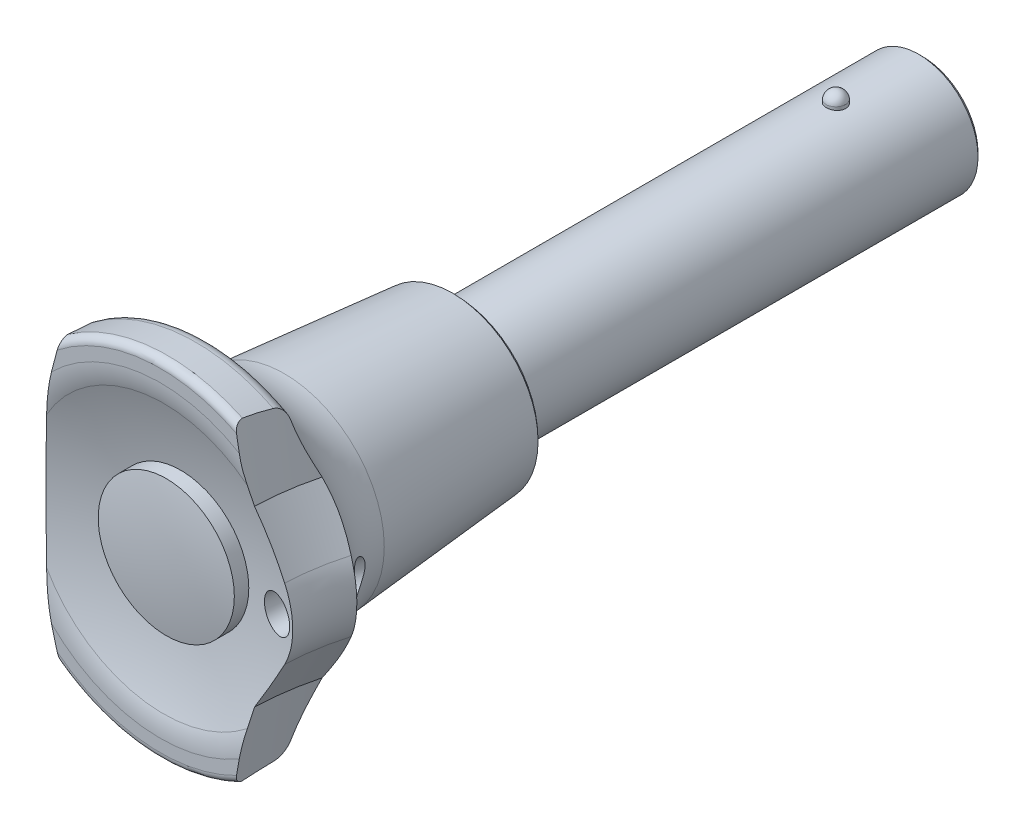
ISO-10303-21;
HEADER;
FILE_DESCRIPTION(('STEP AP214'),'2;1');
FILE_NAME('part.step','',(''),(''),'','','');
FILE_SCHEMA(('AUTOMOTIVE_DESIGN { 1 0 10303 214 1 1 1 1 }'));
ENDSEC;
DATA;
#1=APPLICATION_CONTEXT('core data for automotive mechanical design processes');
#2=APPLICATION_PROTOCOL_DEFINITION('international standard','automotive_design',2000,#1);
#3=PRODUCT_CONTEXT('',#1,'mechanical');
#4=PRODUCT('Part','Part','',(#3));
#5=PRODUCT_RELATED_PRODUCT_CATEGORY('part','',(#4));
#6=PRODUCT_DEFINITION_FORMATION('','',#4);
#7=PRODUCT_DEFINITION_CONTEXT('part definition',#1,'design');
#8=PRODUCT_DEFINITION('design','',#6,#7);
#9=PRODUCT_DEFINITION_SHAPE('','',#8);
#10=(LENGTH_UNIT() NAMED_UNIT(*) SI_UNIT(.MILLI.,.METRE.));
#11=(NAMED_UNIT(*) PLANE_ANGLE_UNIT() SI_UNIT($,.RADIAN.));
#12=(NAMED_UNIT(*) SI_UNIT($,.STERADIAN.) SOLID_ANGLE_UNIT());
#13=UNCERTAINTY_MEASURE_WITH_UNIT(LENGTH_MEASURE(1.E-05),#10,'distance_accuracy_value','');
#14=(GEOMETRIC_REPRESENTATION_CONTEXT(3) GLOBAL_UNCERTAINTY_ASSIGNED_CONTEXT((#13)) GLOBAL_UNIT_ASSIGNED_CONTEXT((#10,
#11,#12)) REPRESENTATION_CONTEXT('',''));
#15=CARTESIAN_POINT('',(0.,0.,0.));
#16=DIRECTION('',(0.,0.,1.));
#17=DIRECTION('',(1.,0.,0.));
#18=AXIS2_PLACEMENT_3D('',#15,#16,#17);
#19=CARTESIAN_POINT('',(0.,-2.65618770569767E-13,-13.3000000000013));
#20=DIRECTION('',(0.157032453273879,0.348210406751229,0.92417007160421));
#21=DIRECTION('',(-0.130877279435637,-0.920189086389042,0.368948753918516));
#22=AXIS2_PLACEMENT_3D('',#19,#20,#21);
#23=SPHERICAL_SURFACE('',#22,53.3000000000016);
#24=CARTESIAN_POINT('',(0.,0.,39.2));
#25=DIRECTION('',(0.,0.,1.));
#26=DIRECTION('',(1.,0.,0.));
#27=AXIS2_PLACEMENT_3D('',#24,#25,#26);
#28=CIRCLE('',#27,9.2);
#29=CARTESIAN_POINT('',(9.2,0.,39.2));
#30=VERTEX_POINT('',#29);
#31=EDGE_CURVE('E576',#30,#30,#28,.F.);
#32=ORIENTED_EDGE('',*,*,#31,.F.);
#33=EDGE_LOOP('',(#32));
#34=FACE_BOUND('',#33,.T.);
#35=ADVANCED_FACE('F14',(#34),#23,.T.);
#36=CARTESIAN_POINT('',(0.,0.,29.6));
#37=DIRECTION('',(0.,0.,1.));
#38=DIRECTION('',(1.,0.,0.));
#39=AXIS2_PLACEMENT_3D('',#36,#37,#38);
#40=CYLINDRICAL_SURFACE('',#39,9.2);
#41=CARTESIAN_POINT('',(9.2,0.,37.246711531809));
#42=CARTESIAN_POINT('',(9.20000185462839,-0.258477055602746,37.2467115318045));
#43=CARTESIAN_POINT('',(9.18910252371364,-0.516923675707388,37.2467115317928));
#44=CARTESIAN_POINT('',(9.14558128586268,-1.03206618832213,37.2467115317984));
#45=CARTESIAN_POINT('',(9.11295366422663,-1.28876160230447,37.2467115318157));
#46=CARTESIAN_POINT('',(9.02615325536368,-1.79876171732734,37.2467115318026));
#47=CARTESIAN_POINT('',(8.97195747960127,-2.05206250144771,37.2467115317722));
#48=CARTESIAN_POINT('',(8.84240671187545,-2.55319845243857,37.2467115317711));
#49=CARTESIAN_POINT('',(8.76705146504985,-2.80103355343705,37.2467115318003));
#50=CARTESIAN_POINT('',(8.59576047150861,-3.28934916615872,37.2467115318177));
#51=CARTESIAN_POINT('',(8.49983486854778,-3.52983323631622,37.2467115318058));
#52=CARTESIAN_POINT('',(8.28806173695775,-4.00186826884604,37.2467115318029));
#53=CARTESIAN_POINT('',(8.17221389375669,-4.23341909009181,37.246711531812));
#54=CARTESIAN_POINT('',(7.92147515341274,-4.68583944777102,37.2467115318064));
#55=CARTESIAN_POINT('',(7.7865924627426,-4.90671353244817,37.2467115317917));
#56=CARTESIAN_POINT('',(7.4986549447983,-5.3363920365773,37.2467115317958));
#57=CARTESIAN_POINT('',(7.34559384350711,-5.54519225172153,37.2467115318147));
#58=CARTESIAN_POINT('',(7.02243787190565,-5.94913959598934,37.2467115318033));
#59=CARTESIAN_POINT('',(6.85234434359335,-6.14428779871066,37.2467115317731));
#60=CARTESIAN_POINT('',(6.49631888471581,-6.5195658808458,37.246711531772));
#61=CARTESIAN_POINT('',(6.31038662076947,-6.69969544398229,37.2467115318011));
#62=CARTESIAN_POINT('',(5.92400519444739,-7.0436541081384,37.2467115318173));
#63=CARTESIAN_POINT('',(5.72355577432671,-7.20748291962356,37.2467115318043));
#64=CARTESIAN_POINT('',(5.30956347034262,-7.51767513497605,37.2467115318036));
#65=CARTESIAN_POINT('',(5.09602029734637,-7.66403815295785,37.2467115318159));
#66=CARTESIAN_POINT('',(4.65736864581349,-7.9382502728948,37.2467115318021));
#67=CARTESIAN_POINT('',(4.43226047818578,-8.06609987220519,37.2467115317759));
#68=CARTESIAN_POINT('',(3.97207525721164,-8.30238022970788,37.2467115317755));
#69=CARTESIAN_POINT('',(3.73699826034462,-8.41081109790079,37.2467115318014));
#70=CARTESIAN_POINT('',(3.25854539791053,-8.60748402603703,37.246711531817));
#71=CARTESIAN_POINT('',(3.01516953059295,-8.69572608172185,37.2467115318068));
#72=CARTESIAN_POINT('',(2.52184890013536,-8.85139410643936,37.2467115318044));
#73=CARTESIAN_POINT('',(2.2719041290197,-8.91882005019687,37.2467115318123));
#74=CARTESIAN_POINT('',(1.76726641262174,-9.03236657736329,37.2467115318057));
#75=CARTESIAN_POINT('',(1.51257429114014,-9.07849082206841,37.2467115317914));
#76=CARTESIAN_POINT('',(1.00012124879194,-9.14913549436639,37.2467115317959));
#77=CARTESIAN_POINT('',(0.742359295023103,-9.17364842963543,37.2467115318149));
#78=CARTESIAN_POINT('',(0.225734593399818,-9.20086637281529,37.2467115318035));
#79=CARTESIAN_POINT('',(-0.0331279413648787,-9.20357542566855,37.2467115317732));
#80=CARTESIAN_POINT('',(-0.550166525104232,-9.18717680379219,37.2467115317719));
#81=CARTESIAN_POINT('',(-0.80834255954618,-9.16806867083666,37.2467115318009));
#82=CARTESIAN_POINT('',(-1.32216168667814,-9.10817141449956,37.2467115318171));
#83=CARTESIAN_POINT('',(-1.5778048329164,-9.06738275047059,37.2467115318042));
#84=CARTESIAN_POINT('',(-2.08475193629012,-8.9644135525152,37.2467115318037));
#85=CARTESIAN_POINT('',(-2.33605579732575,-8.90223254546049,37.2467115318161));
#86=CARTESIAN_POINT('',(-2.83253007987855,-8.7569214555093,37.2467115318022));
#87=CARTESIAN_POINT('',(-3.07770054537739,-8.6737915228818,37.246711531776));
#88=CARTESIAN_POINT('',(-3.56016551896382,-8.48717389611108,37.2467115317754));
#89=CARTESIAN_POINT('',(-3.79746007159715,-8.38368631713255,37.2467115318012));
#90=CARTESIAN_POINT('',(-4.26248809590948,-8.15708862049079,37.2467115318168));
#91=CARTESIAN_POINT('',(-4.49022154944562,-8.03397846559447,37.2467115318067));
#92=CARTESIAN_POINT('',(-4.93450813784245,-7.76901081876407,37.2467115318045));
#93=CARTESIAN_POINT('',(-5.151061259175,-7.62715330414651,37.2467115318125));
#94=CARTESIAN_POINT('',(-5.5714106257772,-7.32572590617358,37.2467115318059));
#95=CARTESIAN_POINT('',(-5.77520908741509,-7.16615911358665,37.2467115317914));
#96=CARTESIAN_POINT('',(-6.16871012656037,-6.83036880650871,37.2467115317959));
#97=CARTESIAN_POINT('',(-6.35840779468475,-6.65413953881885,37.246711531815));
#98=CARTESIAN_POINT('',(-6.72224710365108,-6.28635764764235,37.246711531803));
#99=CARTESIAN_POINT('',(-6.89639155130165,-6.09480780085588,37.2467115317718));
#100=CARTESIAN_POINT('',(-7.22792754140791,-5.69771568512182,37.2467115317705));
#101=CARTESIAN_POINT('',(-7.38531882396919,-5.49217319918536,37.2467115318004));
#102=CARTESIAN_POINT('',(-7.68222361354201,-5.06856374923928,37.246711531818));
#103=CARTESIAN_POINT('',(-7.8217374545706,-4.85049701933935,37.2467115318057));
#104=CARTESIAN_POINT('',(-8.08190186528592,-4.40338089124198,37.2467115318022));
#105=CARTESIAN_POINT('',(-8.20255201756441,-4.17433125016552,37.2467115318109));
#106=CARTESIAN_POINT('',(-8.42410685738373,-3.70692592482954,37.2467115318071));
#107=CARTESIAN_POINT('',(-8.52501522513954,-3.46857198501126,37.2467115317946));
#108=CARTESIAN_POINT('',(-8.70642929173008,-2.98412666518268,37.246711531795));
#109=CARTESIAN_POINT('',(-8.7869278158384,-2.73803259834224,37.2467115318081));
#110=CARTESIAN_POINT('',(-8.92687528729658,-2.24003727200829,37.2467115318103));
#111=CARTESIAN_POINT('',(-8.98633268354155,-1.98813838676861,37.2467115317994));
#112=CARTESIAN_POINT('',(-9.08384258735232,-1.48011271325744,37.2467115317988));
#113=CARTESIAN_POINT('',(-9.12188538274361,-1.22398406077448,37.246711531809));
#114=CARTESIAN_POINT('',(-9.17625392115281,-0.70943209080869,37.246711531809));
#115=CARTESIAN_POINT('',(-9.19257966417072,-0.451008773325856,37.2467115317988));
#116=CARTESIAN_POINT('',(-9.20339556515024,0.0661771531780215,37.2467115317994));
#117=CARTESIAN_POINT('',(-9.19789561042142,0.324939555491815,37.2467115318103));
#118=CARTESIAN_POINT('',(-9.16511481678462,0.841185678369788,37.2467115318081));
#119=CARTESIAN_POINT('',(-9.13782521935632,1.09866884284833,37.246711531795));
#120=CARTESIAN_POINT('',(-9.06166168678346,1.61033030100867,37.2467115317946));
#121=CARTESIAN_POINT('',(-9.01279532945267,1.86450972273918,37.2467115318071));
#122=CARTESIAN_POINT('',(-8.89381622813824,2.3678965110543,37.2467115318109));
#123=CARTESIAN_POINT('',(-8.82369952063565,2.61710294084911,37.2467115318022));
#124=CARTESIAN_POINT('',(-8.66272318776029,3.10871759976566,37.2467115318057));
#125=CARTESIAN_POINT('',(-8.57186402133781,3.3511259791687,37.2467115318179));
#126=CARTESIAN_POINT('',(-8.37004594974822,3.82743143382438,37.2467115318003));
#127=CARTESIAN_POINT('',(-8.25908666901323,4.06132834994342,37.2467115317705));
#128=CARTESIAN_POINT('',(-8.0178602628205,4.51893962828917,37.2467115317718));
#129=CARTESIAN_POINT('',(-7.88759343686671,4.74265414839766,37.246711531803));
#130=CARTESIAN_POINT('',(-7.6086514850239,5.17835352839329,37.246711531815));
#131=CARTESIAN_POINT('',(-7.45997303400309,5.39033625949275,37.2467115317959));
#132=CARTESIAN_POINT('',(-7.14533841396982,5.80094952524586,37.2467115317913));
#133=CARTESIAN_POINT('',(-6.97938824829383,5.99958466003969,37.2467115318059));
#134=CARTESIAN_POINT('',(-6.63131665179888,6.38220487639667,37.2467115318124));
#135=CARTESIAN_POINT('',(-6.4491924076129,6.56618739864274,37.2467115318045));
#136=CARTESIAN_POINT('',(-6.07009243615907,6.91815563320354,37.2467115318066));
#137=CARTESIAN_POINT('',(-5.87311672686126,7.08614136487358,37.2467115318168));
#138=CARTESIAN_POINT('',(-5.4657143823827,7.4049217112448,37.2467115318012));
#139=CARTESIAN_POINT('',(-5.25528777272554,7.55571635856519,37.2467115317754));
#140=CARTESIAN_POINT('',(-4.82247807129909,7.83904364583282,37.2467115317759));
#141=CARTESIAN_POINT('',(-4.60009491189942,7.97157618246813,37.2467115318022));
#142=CARTESIAN_POINT('',(-4.1449525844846,8.21743689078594,37.2467115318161));
#143=CARTESIAN_POINT('',(-3.91219334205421,8.33076492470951,37.2467115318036));
#144=CARTESIAN_POINT('',(-3.43796040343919,8.53740746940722,37.2467115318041));
#145=CARTESIAN_POINT('',(-3.19648690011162,8.6307224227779,37.2467115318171));
#146=CARTESIAN_POINT('',(-2.70653205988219,8.79668034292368,37.2467115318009));
#147=CARTESIAN_POINT('',(-2.45805057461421,8.86932287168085,37.2467115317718));
#148=CARTESIAN_POINT('',(-1.95585656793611,8.9934155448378,37.2467115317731));
#149=CARTESIAN_POINT('',(-1.70214415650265,9.0448661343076,37.2467115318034));
#150=CARTESIAN_POINT('',(-1.19123944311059,9.12621890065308,37.2467115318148));
#151=CARTESIAN_POINT('',(-0.934046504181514,9.15611707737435,37.2467115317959));
#152=CARTESIAN_POINT('',(-0.418145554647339,9.19413024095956,37.2467115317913));
#153=CARTESIAN_POINT('',(-0.159438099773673,9.20225277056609,37.2467115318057));
#154=CARTESIAN_POINT('',(0.357786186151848,9.19667812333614,37.2467115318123));
#155=CARTESIAN_POINT('',(0.616302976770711,9.18297719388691,37.2467115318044));
#156=CARTESIAN_POINT('',(1.13126307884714,9.1338460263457,37.2467115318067));
#157=CARTESIAN_POINT('',(1.38770639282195,9.0984158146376,37.246711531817));
#158=CARTESIAN_POINT('',(1.89669667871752,9.00607800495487,37.2467115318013));
#159=CARTESIAN_POINT('',(2.14924365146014,8.94917041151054,37.2467115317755));
#160=CARTESIAN_POINT('',(2.64864726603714,8.81428203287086,37.2467115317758));
#161=CARTESIAN_POINT('',(2.8955038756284,8.73630112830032,37.2467115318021));
#162=CARTESIAN_POINT('',(3.38177681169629,8.5598182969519,37.2467115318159));
#163=CARTESIAN_POINT('',(3.62119293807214,8.46131581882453,37.2467115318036));
#164=CARTESIAN_POINT('',(4.09087056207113,8.24449384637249,37.2467115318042));
#165=CARTESIAN_POINT('',(4.32113226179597,8.12617478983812,37.2467115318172));
#166=CARTESIAN_POINT('',(4.77086558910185,7.87056159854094,37.2467115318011));
#167=CARTESIAN_POINT('',(4.99033740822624,7.73326780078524,37.2467115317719));
#168=CARTESIAN_POINT('',(5.41693056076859,7.44068268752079,37.246711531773));
#169=CARTESIAN_POINT('',(5.62405215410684,7.28539175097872,37.2467115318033));
#170=CARTESIAN_POINT('',(6.02449325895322,6.95790104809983,37.2467115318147));
#171=CARTESIAN_POINT('',(6.2178116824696,6.78569995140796,37.2467115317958));
#172=CARTESIAN_POINT('',(6.58918960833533,6.42568596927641,37.2467115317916));
#173=CARTESIAN_POINT('',(6.76725436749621,6.23787850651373,37.2467115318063));
#174=CARTESIAN_POINT('',(7.10700778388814,5.84785067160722,37.246711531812));
#175=CARTESIAN_POINT('',(7.26868936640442,5.6456241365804,37.2467115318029));
#176=CARTESIAN_POINT('',(7.57443690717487,5.22827132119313,37.2467115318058));
#177=CARTESIAN_POINT('',(7.7185031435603,5.01314524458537,37.2467115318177));
#178=CARTESIAN_POINT('',(7.98806497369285,4.57141097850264,37.2467115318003));
#179=CARTESIAN_POINT('',(8.11355139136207,4.34479718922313,37.246711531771));
#180=CARTESIAN_POINT('',(8.34497404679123,3.88180237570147,37.2467115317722));
#181=CARTESIAN_POINT('',(8.45091052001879,3.6454214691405,37.2467115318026));
#182=CARTESIAN_POINT('',(8.64237937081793,3.16482381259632,37.2467115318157));
#183=CARTESIAN_POINT('',(8.72793341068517,2.9206156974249,37.2467115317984));
#184=CARTESIAN_POINT('',(8.87815350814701,2.42594426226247,37.2467115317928));
#185=CARTESIAN_POINT('',(8.94282505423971,2.17548260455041,37.2467115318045));
#186=CARTESIAN_POINT('',(9.06430244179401,1.60704034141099,37.2467115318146));
#187=CARTESIAN_POINT('',(9.11514584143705,1.28776808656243,37.2467115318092));
#188=CARTESIAN_POINT('',(9.18299346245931,0.645648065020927,37.2467115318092));
#189=CARTESIAN_POINT('',(9.19999768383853,0.322800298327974,37.2467115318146));
#190=CARTESIAN_POINT('',(9.2,0.,37.246711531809));
#191=B_SPLINE_CURVE_WITH_KNOTS('',3,(#41,#42,#43,#44,#45,#46,#47,#48,#49,#50,#51,#52,#53,#54,
#55,#56,#57,#58,#59,#60,#61,#62,#63,#64,#65,#66,#67,#68,#69,#70,#71,#72,#73,#74,#75,#76,#77,#78,
#79,#80,#81,#82,#83,#84,#85,#86,#87,#88,#89,#90,#91,#92,#93,#94,#95,#96,#97,#98,#99,#100,#101,
#102,#103,#104,#105,#106,#107,#108,#109,#110,#111,#112,#113,#114,#115,#116,#117,#118,#119,#120,
#121,#122,#123,#124,#125,#126,#127,#128,#129,#130,#131,#132,#133,#134,#135,#136,#137,#138,#139,
#140,#141,#142,#143,#144,#145,#146,#147,#148,#149,#150,#151,#152,#153,#154,#155,#156,#157,#158,
#159,#160,#161,#162,#163,#164,#165,#166,#167,#168,#169,#170,#171,#172,#173,#174,#175,#176,#177,
#178,#179,#180,#181,#182,#183,#184,#185,#186,#187,#188,#189,#190),.UNSPECIFIED.,.T.,.F.,(4,2,2,
2,2,2,2,2,2,2,2,2,2,2,2,2,2,2,2,2,2,2,2,2,2,2,2,2,2,2,2,2,2,2,2,2,2,2,2,2,2,2,2,2,2,2,2,2,2,2,2,
2,2,2,2,2,2,2,2,2,2,2,2,2,2,2,2,2,2,2,2,2,2,2,4),(0.,0.775149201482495,1.55050235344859,
2.32668414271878,3.10287528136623,3.87868453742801,4.65450604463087,5.4299940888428,
6.20575056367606,6.98144596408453,7.75715769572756,8.53288320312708,9.30862584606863,
10.0843476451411,10.8600650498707,11.6357826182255,12.4115011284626,13.1870862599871,
13.96294016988,14.7386501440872,15.5143764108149,16.2900862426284,17.0658132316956,
17.8415346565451,18.6172516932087,19.3929702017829,20.1686896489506,20.9442739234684,
21.7201269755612,22.4958397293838,23.2715645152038,24.0472748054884,24.8230022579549,
25.5985849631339,26.3744399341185,27.1499830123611,27.9258775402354,28.7017720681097,
29.4773151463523,30.2531701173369,31.0287528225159,31.8044802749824,32.580190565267,
33.355915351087,34.1316281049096,34.9074811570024,35.6830654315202,36.4587848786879,
37.2345033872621,38.0102204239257,38.7859418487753,39.5616688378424,40.3373786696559,
41.1131049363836,41.8888149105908,42.6646688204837,43.4402539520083,44.2159724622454,
44.9916900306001,45.7674074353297,46.5431292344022,47.3188718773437,48.0945973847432,
48.8703091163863,49.6460045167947,50.421760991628,51.1972490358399,51.9730705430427,
52.7488797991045,53.5250709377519,54.301252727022,55.0766058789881,55.8517550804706,
56.8198038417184,57.7878526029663),.UNSPECIFIED.);
#192=CARTESIAN_POINT('',(9.2,0.,37.246711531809));
#193=VERTEX_POINT('',#192);
#194=EDGE_CURVE('E581',#193,#193,#191,.T.);
#195=ORIENTED_EDGE('',*,*,#194,.F.);
#196=EDGE_LOOP('',(#195));
#197=FACE_BOUND('',#196,.T.);
#198=ORIENTED_EDGE('',*,*,#31,.T.);
#199=EDGE_LOOP('',(#198));
#200=FACE_BOUND('',#199,.T.);
#201=ADVANCED_FACE('F195',(#197,#200),#40,.T.);
#202=CARTESIAN_POINT('',(0.,3.75,-63.));
#203=DIRECTION('',(0.,0.,-1.));
#204=DIRECTION('',(-1.,0.,0.));
#205=AXIS2_PLACEMENT_3D('',#202,#203,#204);
#206=PLANE('',#205);
#207=CARTESIAN_POINT('',(0.,0.,-63.));
#208=DIRECTION('',(0.,0.,1.));
#209=DIRECTION('',(1.,0.,0.));
#210=AXIS2_PLACEMENT_3D('',#207,#208,#209);
#211=CIRCLE('',#210,7.5);
#212=CARTESIAN_POINT('',(7.5,0.,-63.));
#213=VERTEX_POINT('',#212);
#214=EDGE_CURVE('E564',#213,#213,#211,.T.);
#215=ORIENTED_EDGE('',*,*,#214,.F.);
#216=EDGE_LOOP('',(#215));
#217=FACE_BOUND('',#216,.T.);
#218=ADVANCED_FACE('F506',(#217),#206,.T.);
#219=CARTESIAN_POINT('',(0.,-8.18666666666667,-51.3));
#220=DIRECTION('',(0.385125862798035,0.0446085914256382,0.921785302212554));
#221=DIRECTION('',(0.523326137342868,-0.83326503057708,-0.178323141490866));
#222=AXIS2_PLACEMENT_3D('',#219,#220,#221);
#223=SPHERICAL_SURFACE('',#222,1.31333333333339);
#224=CARTESIAN_POINT('',(0.,-8.37333333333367,-51.3));
#225=DIRECTION('',(0.,1.,0.));
#226=DIRECTION('',(0.,0.,1.));
#227=AXIS2_PLACEMENT_3D('',#224,#225,#226);
#228=CIRCLE('',#227,1.3);
#229=CARTESIAN_POINT('',(0.,-8.37333333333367,-50.));
#230=VERTEX_POINT('',#229);
#231=EDGE_CURVE('E567',#230,#230,#228,.T.);
#232=ORIENTED_EDGE('',*,*,#231,.F.);
#233=EDGE_LOOP('',(#232));
#234=FACE_BOUND('',#233,.T.);
#235=ADVANCED_FACE('F508',(#234),#223,.T.);
#236=CARTESIAN_POINT('',(0.,8.18666666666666,-51.3));
#237=DIRECTION('',(0.385125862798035,0.0446085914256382,0.921785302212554));
#238=DIRECTION('',(0.523326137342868,-0.83326503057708,-0.178323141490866));
#239=AXIS2_PLACEMENT_3D('',#236,#237,#238);
#240=SPHERICAL_SURFACE('',#239,1.31333333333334);
#241=CARTESIAN_POINT('',(0.,8.37333333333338,-51.3));
#242=DIRECTION('',(0.,1.,0.));
#243=DIRECTION('',(0.,0.,1.));
#244=AXIS2_PLACEMENT_3D('',#241,#242,#243);
#245=CIRCLE('',#244,1.3);
#246=CARTESIAN_POINT('',(0.,8.37333333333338,-50.));
#247=VERTEX_POINT('',#246);
#248=EDGE_CURVE('E569',#247,#247,#245,.F.);
#249=ORIENTED_EDGE('',*,*,#248,.F.);
#250=EDGE_LOOP('',(#249));
#251=FACE_BOUND('',#250,.T.);
#252=ADVANCED_FACE('F325',(#251),#240,.T.);
#253=CARTESIAN_POINT('',(0.,0.,-62.5));
#254=DIRECTION('',(0.,0.,1.));
#255=DIRECTION('',(1.,0.,0.));
#256=AXIS2_PLACEMENT_3D('',#253,#254,#255);
#257=CONICAL_SURFACE('',#256,8.,0.785398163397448);
#258=ORIENTED_EDGE('',*,*,#214,.T.);
#259=EDGE_LOOP('',(#258));
#260=FACE_BOUND('',#259,.T.);
#261=CARTESIAN_POINT('',(0.,0.,-62.5));
#262=DIRECTION('',(0.,0.,1.));
#263=DIRECTION('',(1.,0.,0.));
#264=AXIS2_PLACEMENT_3D('',#261,#262,#263);
#265=CIRCLE('',#264,8.);
#266=CARTESIAN_POINT('',(8.,0.,-62.5));
#267=VERTEX_POINT('',#266);
#268=EDGE_CURVE('E526',#267,#267,#265,.T.);
#269=ORIENTED_EDGE('',*,*,#268,.F.);
#270=EDGE_LOOP('',(#269));
#271=FACE_BOUND('',#270,.T.);
#272=ADVANCED_FACE('F552',(#260,#271),#257,.T.);
#273=CARTESIAN_POINT('',(0.,-1.47437617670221E-13,-51.3));
#274=DIRECTION('',(0.,1.,0.));
#275=DIRECTION('',(0.,0.,1.));
#276=AXIS2_PLACEMENT_3D('',#273,#274,#275);
#277=CYLINDRICAL_SURFACE('',#276,1.3);
#278=CARTESIAN_POINT('',(0.,-8.,-50.));
#279=CARTESIAN_POINT('',(0.0725024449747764,-7.99999869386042,-50.00000313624));
#280=CARTESIAN_POINT('',(0.145050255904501,-7.99900400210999,-50.0060863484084));
#281=CARTESIAN_POINT('',(0.288118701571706,-7.99513131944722,-50.0302512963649));
#282=CARTESIAN_POINT('',(0.358637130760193,-7.992251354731,-50.0483456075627));
#283=CARTESIAN_POINT('',(0.495547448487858,-7.98493139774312,-50.0959734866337));
#284=CARTESIAN_POINT('',(0.561942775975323,-7.98049272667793,-50.1254973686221));
#285=CARTESIAN_POINT('',(0.688826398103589,-7.97054411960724,-50.1951219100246));
#286=CARTESIAN_POINT('',(0.74931555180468,-7.96503433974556,-50.2352210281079));
#287=CARTESIAN_POINT('',(0.863232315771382,-7.953498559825,-50.3252472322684));
#288=CARTESIAN_POINT('',(0.916598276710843,-7.94746871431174,-50.3752518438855));
#289=CARTESIAN_POINT('',(1.01422152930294,-7.93560198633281,-50.4835029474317));
#290=CARTESIAN_POINT('',(1.05847821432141,-7.92976511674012,-50.5417499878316));
#291=CARTESIAN_POINT('',(1.13687120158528,-7.91890804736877,-50.6652528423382));
#292=CARTESIAN_POINT('',(1.17094696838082,-7.91389280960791,-50.7305475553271));
#293=CARTESIAN_POINT('',(1.22762371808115,-7.90529992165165,-50.8660289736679));
#294=CARTESIAN_POINT('',(1.25022545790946,-7.90172217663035,-50.9362153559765));
#295=CARTESIAN_POINT('',(1.28311937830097,-7.89644746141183,-51.0788364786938));
#296=CARTESIAN_POINT('',(1.29351763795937,-7.89473429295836,-51.1512461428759));
#297=CARTESIAN_POINT('',(1.30203826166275,-7.89333365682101,-51.2968013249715));
#298=CARTESIAN_POINT('',(1.30016143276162,-7.89364605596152,-51.369946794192));
#299=CARTESIAN_POINT('',(1.28427163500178,-7.89624646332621,-51.5141415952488));
#300=CARTESIAN_POINT('',(1.27037762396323,-7.89851510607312,-51.5852044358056));
#301=CARTESIAN_POINT('',(1.23103423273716,-7.90474211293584,-51.7239772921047));
#302=CARTESIAN_POINT('',(1.20558438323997,-7.90870054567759,-51.7916871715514));
#303=CARTESIAN_POINT('',(1.14372936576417,-7.9178823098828,-51.9221911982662));
#304=CARTESIAN_POINT('',(1.10727418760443,-7.92311139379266,-51.9849612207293));
#305=CARTESIAN_POINT('',(1.02448189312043,-7.93424071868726,-52.1035333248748));
#306=CARTESIAN_POINT('',(0.978144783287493,-7.94014095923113,-52.1593354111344));
#307=CARTESIAN_POINT('',(0.876263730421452,-7.9520322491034,-52.263072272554));
#308=CARTESIAN_POINT('',(0.820619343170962,-7.95802355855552,-52.310908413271));
#309=CARTESIAN_POINT('',(0.702011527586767,-7.96936151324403,-52.3966008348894));
#310=CARTESIAN_POINT('',(0.63904483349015,-7.97470786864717,-52.4344526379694));
#311=CARTESIAN_POINT('',(0.50747221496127,-7.98416109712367,-52.4991065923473));
#312=CARTESIAN_POINT('',(0.43885758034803,-7.98826600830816,-52.5258912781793));
#313=CARTESIAN_POINT('',(0.298112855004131,-7.99475231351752,-52.5674748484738));
#314=CARTESIAN_POINT('',(0.225990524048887,-7.99713734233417,-52.5822990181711));
#315=CARTESIAN_POINT('',(0.127790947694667,-7.99902015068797,-52.5939582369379));
#316=CARTESIAN_POINT('',(0.102289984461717,-7.99938681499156,-52.5962220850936));
#317=CARTESIAN_POINT('',(0.051196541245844,-7.99987697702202,-52.5992435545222));
#318=CARTESIAN_POINT('',(0.0256040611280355,-8.00000047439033,-52.6000011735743));
#319=CARTESIAN_POINT('',(-0.0724391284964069,-7.99999865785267,-52.599996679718));
#320=CARTESIAN_POINT('',(-0.144970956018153,-7.99900499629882,-52.5939196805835));
#321=CARTESIAN_POINT('',(-0.288056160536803,-7.99513416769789,-52.5697666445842));
#322=CARTESIAN_POINT('',(-0.358605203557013,-7.99225316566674,-52.5516661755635));
#323=CARTESIAN_POINT('',(-0.495554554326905,-7.98493091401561,-52.5040233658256));
#324=CARTESIAN_POINT('',(-0.561959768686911,-7.98049155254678,-52.4744948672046));
#325=CARTESIAN_POINT('',(-0.688842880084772,-7.97054266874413,-52.4048674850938));
#326=CARTESIAN_POINT('',(-0.749323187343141,-7.96503358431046,-52.3647729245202));
#327=CARTESIAN_POINT('',(-0.863224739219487,-7.95349930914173,-52.2747587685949));
#328=CARTESIAN_POINT('',(-0.916584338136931,-7.947470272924,-52.2247616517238));
#329=CARTESIAN_POINT('',(-1.01421012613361,-7.93560350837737,-52.1165116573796));
#330=CARTESIAN_POINT('',(-1.05847335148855,-7.92976584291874,-52.0582560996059));
#331=CARTESIAN_POINT('',(-1.13689204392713,-7.91890510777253,-51.9347159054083));
#332=CARTESIAN_POINT('',(-1.17098270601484,-7.91388734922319,-51.8693896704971));
#333=CARTESIAN_POINT('',(-1.22764885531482,-7.90529615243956,-51.7338882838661));
#334=CARTESIAN_POINT('',(-1.2502373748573,-7.90172108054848,-51.663718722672));
#335=CARTESIAN_POINT('',(-1.27778287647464,-7.89730265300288,-51.5443110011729));
#336=CARTESIAN_POINT('',(-1.2861019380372,-7.89594667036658,-51.4958406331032));
#337=CARTESIAN_POINT('',(-1.29721152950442,-7.89412905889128,-51.3982537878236));
#338=CARTESIAN_POINT('',(-1.30000212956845,-7.89366741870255,-51.349137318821));
#339=CARTESIAN_POINT('',(-1.29999685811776,-7.8936697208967,-51.2275047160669));
#340=CARTESIAN_POINT('',(-1.2939148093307,-7.8946779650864,-51.154964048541));
#341=CARTESIAN_POINT('',(-1.2697548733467,-7.89859901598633,-51.0119103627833));
#342=CARTESIAN_POINT('',(-1.25166437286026,-7.90151382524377,-50.9413995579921));
#343=CARTESIAN_POINT('',(-1.20404730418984,-7.90890932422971,-50.8045043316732));
#344=CARTESIAN_POINT('',(-1.17453042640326,-7.91338868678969,-50.7381164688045));
#345=CARTESIAN_POINT('',(-1.10492323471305,-7.92340679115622,-50.6112472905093));
#346=CARTESIAN_POINT('',(-1.06483478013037,-7.9289453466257,-50.5507649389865));
#347=CARTESIAN_POINT('',(-0.974824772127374,-7.94051554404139,-50.4368488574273));
#348=CARTESIAN_POINT('',(-0.924824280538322,-7.9465509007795,-50.3834778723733));
#349=CARTESIAN_POINT('',(-0.816565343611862,-7.95840311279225,-50.2858325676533));
#350=CARTESIAN_POINT('',(-0.75830462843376,-7.96421990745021,-50.2415607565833));
#351=CARTESIAN_POINT('',(-0.634760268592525,-7.97502004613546,-50.1631327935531));
#352=CARTESIAN_POINT('',(-0.569436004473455,-7.97999809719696,-50.1290399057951));
#353=CARTESIAN_POINT('',(-0.433938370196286,-7.98850965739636,-50.0723688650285));
#354=CARTESIAN_POINT('',(-0.363770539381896,-7.99204478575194,-50.0497777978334));
#355=CARTESIAN_POINT('',(-0.244356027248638,-7.99641143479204,-50.0222253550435));
#356=CARTESIAN_POINT('',(-0.195876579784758,-7.99775060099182,-50.01390318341));
#357=CARTESIAN_POINT('',(-0.0982716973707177,-7.99954532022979,-50.0027894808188));
#358=CARTESIAN_POINT('',(-0.0491462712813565,-8.00000088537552,-49.9999978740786));
#359=CARTESIAN_POINT('',(0.,-8.,-50.));
#360=B_SPLINE_CURVE_WITH_KNOTS('',3,(#278,#279,#280,#281,#282,#283,#284,#285,#286,#287,#288,
#289,#290,#291,#292,#293,#294,#295,#296,#297,#298,#299,#300,#301,#302,#303,#304,#305,#306,#307,
#308,#309,#310,#311,#312,#313,#314,#315,#316,#317,#318,#319,#320,#321,#322,#323,#324,#325,#326,
#327,#328,#329,#330,#331,#332,#333,#334,#335,#336,#337,#338,#339,#340,#341,#342,#343,#344,#345,
#346,#347,#348,#349,#350,#351,#352,#353,#354,#355,#356,#357,#358,#359),.UNSPECIFIED.,.T.,.F.,(4,
2,2,2,2,2,2,2,2,2,2,2,2,2,2,2,2,2,2,2,2,2,2,2,2,2,2,2,2,2,2,2,2,2,2,2,2,2,2,2,4),(0.,
0.217327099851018,0.434882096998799,0.652253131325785,0.86959250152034,1.08870534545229,
1.30783277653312,1.52823832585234,1.74862933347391,1.96709005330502,2.18553641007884,
2.40184480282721,2.61816198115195,2.83547733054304,3.05279253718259,3.27262539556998,
3.49255667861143,3.71283373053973,3.9326438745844,4.00942140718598,4.08619905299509,
4.30341872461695,4.5210811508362,4.73848075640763,4.95579155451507,5.17487605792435,
5.3940318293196,5.61455531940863,5.83482838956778,5.98212002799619,6.12940979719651,
6.34671537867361,6.56424957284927,6.78159968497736,6.99891159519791,7.21802921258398,
7.43720715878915,7.65772026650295,7.87798523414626,8.02530389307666,8.17262053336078),.UNSPECIFIED.);
#361=CARTESIAN_POINT('',(0.,-8.,-50.));
#362=VERTEX_POINT('',#361);
#363=EDGE_CURVE('E530',#362,#362,#360,.T.);
#364=ORIENTED_EDGE('',*,*,#363,.F.);
#365=EDGE_LOOP('',(#364));
#366=FACE_BOUND('',#365,.T.);
#367=ORIENTED_EDGE('',*,*,#231,.T.);
#368=EDGE_LOOP('',(#367));
#369=FACE_BOUND('',#368,.T.);
#370=ADVANCED_FACE('F543',(#366,#369),#277,.T.);
#371=CARTESIAN_POINT('',(0.,-1.47437617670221E-13,-51.3));
#372=DIRECTION('',(0.,1.,0.));
#373=DIRECTION('',(0.,0.,1.));
#374=AXIS2_PLACEMENT_3D('',#371,#372,#373);
#375=CYLINDRICAL_SURFACE('',#374,1.3);
#376=ORIENTED_EDGE('',*,*,#248,.T.);
#377=EDGE_LOOP('',(#376));
#378=FACE_BOUND('',#377,.T.);
#379=CARTESIAN_POINT('',(0.,8.,-52.6));
#380=CARTESIAN_POINT('',(0.0725024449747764,7.99999869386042,-52.59999686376));
#381=CARTESIAN_POINT('',(0.145050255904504,7.99900400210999,-52.5939136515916));
#382=CARTESIAN_POINT('',(0.28811870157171,7.99513131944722,-52.5697487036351));
#383=CARTESIAN_POINT('',(0.358637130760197,7.992251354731,-52.5516543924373));
#384=CARTESIAN_POINT('',(0.495547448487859,7.98493139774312,-52.5040265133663));
#385=CARTESIAN_POINT('',(0.561942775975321,7.98049272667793,-52.4745026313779));
#386=CARTESIAN_POINT('',(0.688826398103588,7.97054411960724,-52.4048780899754));
#387=CARTESIAN_POINT('',(0.749315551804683,7.96503433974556,-52.3647789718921));
#388=CARTESIAN_POINT('',(0.863232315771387,7.953498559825,-52.2747527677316));
#389=CARTESIAN_POINT('',(0.916598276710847,7.94746871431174,-52.2247481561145));
#390=CARTESIAN_POINT('',(1.01422152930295,7.93560198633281,-52.1164970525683));
#391=CARTESIAN_POINT('',(1.05847821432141,7.92976511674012,-52.0582500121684));
#392=CARTESIAN_POINT('',(1.13687120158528,7.91890804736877,-51.9347471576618));
#393=CARTESIAN_POINT('',(1.17094696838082,7.91389280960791,-51.8694524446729));
#394=CARTESIAN_POINT('',(1.22762371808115,7.90529992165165,-51.7339710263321));
#395=CARTESIAN_POINT('',(1.25022545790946,7.90172217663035,-51.6637846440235));
#396=CARTESIAN_POINT('',(1.28311937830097,7.89644746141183,-51.5211635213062));
#397=CARTESIAN_POINT('',(1.29351763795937,7.89473429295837,-51.4487538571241));
#398=CARTESIAN_POINT('',(1.30203826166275,7.89333365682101,-51.3031986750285));
#399=CARTESIAN_POINT('',(1.30016143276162,7.89364605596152,-51.230053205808));
#400=CARTESIAN_POINT('',(1.28427163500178,7.89624646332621,-51.0858584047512));
#401=CARTESIAN_POINT('',(1.27037762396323,7.89851510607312,-51.0147955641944));
#402=CARTESIAN_POINT('',(1.23103423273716,7.90474211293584,-50.8760227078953));
#403=CARTESIAN_POINT('',(1.20558438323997,7.9087005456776,-50.8083128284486));
#404=CARTESIAN_POINT('',(1.14372936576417,7.9178823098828,-50.6778088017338));
#405=CARTESIAN_POINT('',(1.10727418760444,7.92311139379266,-50.6150387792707));
#406=CARTESIAN_POINT('',(1.02448189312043,7.93424071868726,-50.4964666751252));
#407=CARTESIAN_POINT('',(0.97814478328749,7.94014095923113,-50.4406645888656));
#408=CARTESIAN_POINT('',(0.876263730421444,7.9520322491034,-50.336927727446));
#409=CARTESIAN_POINT('',(0.820619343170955,7.95802355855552,-50.289091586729));
#410=CARTESIAN_POINT('',(0.702011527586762,7.96936151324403,-50.2033991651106));
#411=CARTESIAN_POINT('',(0.639044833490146,7.97470786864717,-50.1655473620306));
#412=CARTESIAN_POINT('',(0.50747221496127,7.98416109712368,-50.1008934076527));
#413=CARTESIAN_POINT('',(0.438857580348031,7.98826600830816,-50.0741087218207));
#414=CARTESIAN_POINT('',(0.298112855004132,7.99475231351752,-50.0325251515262));
#415=CARTESIAN_POINT('',(0.225990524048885,7.99713734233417,-50.0177009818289));
#416=CARTESIAN_POINT('',(0.127790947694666,7.99902015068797,-50.0060417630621));
#417=CARTESIAN_POINT('',(0.102289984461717,7.99938681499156,-50.0037779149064));
#418=CARTESIAN_POINT('',(0.0511965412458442,7.99987697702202,-50.0007564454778));
#419=CARTESIAN_POINT('',(0.025604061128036,8.00000047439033,-49.9999988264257));
#420=CARTESIAN_POINT('',(-0.0724391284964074,7.99999865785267,-50.000003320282));
#421=CARTESIAN_POINT('',(-0.144970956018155,7.99900499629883,-50.0060803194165));
#422=CARTESIAN_POINT('',(-0.288056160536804,7.99513416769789,-50.0302333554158));
#423=CARTESIAN_POINT('',(-0.358605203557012,7.99225316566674,-50.0483338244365));
#424=CARTESIAN_POINT('',(-0.495554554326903,7.98493091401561,-50.0959766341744));
#425=CARTESIAN_POINT('',(-0.56195976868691,7.98049155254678,-50.1255051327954));
#426=CARTESIAN_POINT('',(-0.688842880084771,7.97054266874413,-50.1951325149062));
#427=CARTESIAN_POINT('',(-0.749323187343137,7.96503358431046,-50.2352270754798));
#428=CARTESIAN_POINT('',(-0.863224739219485,7.95349930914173,-50.3252412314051));
#429=CARTESIAN_POINT('',(-0.916584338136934,7.947470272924,-50.3752383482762));
#430=CARTESIAN_POINT('',(-1.01421012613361,7.93560350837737,-50.4834883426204));
#431=CARTESIAN_POINT('',(-1.05847335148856,7.92976584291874,-50.5417439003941));
#432=CARTESIAN_POINT('',(-1.13689204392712,7.91890510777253,-50.6652840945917));
#433=CARTESIAN_POINT('',(-1.17098270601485,7.91388734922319,-50.7306103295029));
#434=CARTESIAN_POINT('',(-1.22764885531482,7.90529615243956,-50.8661117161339));
#435=CARTESIAN_POINT('',(-1.25023737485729,7.90172108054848,-50.936281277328));
#436=CARTESIAN_POINT('',(-1.27778287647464,7.89730265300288,-51.0556889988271));
#437=CARTESIAN_POINT('',(-1.2861019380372,7.89594667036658,-51.1041593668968));
#438=CARTESIAN_POINT('',(-1.29721152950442,7.89412905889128,-51.2017462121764));
#439=CARTESIAN_POINT('',(-1.30000212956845,7.89366741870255,-51.250862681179));
#440=CARTESIAN_POINT('',(-1.29999685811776,7.8936697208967,-51.3724952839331));
#441=CARTESIAN_POINT('',(-1.2939148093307,7.89467796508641,-51.445035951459));
#442=CARTESIAN_POINT('',(-1.2697548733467,7.89859901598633,-51.5880896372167));
#443=CARTESIAN_POINT('',(-1.25166437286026,7.90151382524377,-51.6586004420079));
#444=CARTESIAN_POINT('',(-1.20404730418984,7.90890932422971,-51.7954956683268));
#445=CARTESIAN_POINT('',(-1.17453042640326,7.91338868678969,-51.8618835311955));
#446=CARTESIAN_POINT('',(-1.10492323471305,7.92340679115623,-51.9887527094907));
#447=CARTESIAN_POINT('',(-1.06483478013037,7.9289453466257,-52.0492350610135));
#448=CARTESIAN_POINT('',(-0.974824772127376,7.94051554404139,-52.1631511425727));
#449=CARTESIAN_POINT('',(-0.924824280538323,7.9465509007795,-52.2165221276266));
#450=CARTESIAN_POINT('',(-0.816565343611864,7.95840311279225,-52.3141674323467));
#451=CARTESIAN_POINT('',(-0.758304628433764,7.96421990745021,-52.3584392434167));
#452=CARTESIAN_POINT('',(-0.634760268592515,7.97502004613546,-52.4368672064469));
#453=CARTESIAN_POINT('',(-0.569436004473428,7.97999809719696,-52.4709600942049));
#454=CARTESIAN_POINT('',(-0.433938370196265,7.98850965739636,-52.5276311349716));
#455=CARTESIAN_POINT('',(-0.363770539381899,7.99204478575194,-52.5502222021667));
#456=CARTESIAN_POINT('',(-0.244356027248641,7.99641143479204,-52.5777746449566));
#457=CARTESIAN_POINT('',(-0.195876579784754,7.99775060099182,-52.58609681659));
#458=CARTESIAN_POINT('',(-0.0982716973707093,7.99954532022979,-52.5972105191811));
#459=CARTESIAN_POINT('',(-0.0491462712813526,8.00000088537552,-52.6000021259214));
#460=CARTESIAN_POINT('',(0.,8.,-52.6));
#461=B_SPLINE_CURVE_WITH_KNOTS('',3,(#379,#380,#381,#382,#383,#384,#385,#386,#387,#388,#389,
#390,#391,#392,#393,#394,#395,#396,#397,#398,#399,#400,#401,#402,#403,#404,#405,#406,#407,#408,
#409,#410,#411,#412,#413,#414,#415,#416,#417,#418,#419,#420,#421,#422,#423,#424,#425,#426,#427,
#428,#429,#430,#431,#432,#433,#434,#435,#436,#437,#438,#439,#440,#441,#442,#443,#444,#445,#446,
#447,#448,#449,#450,#451,#452,#453,#454,#455,#456,#457,#458,#459,#460),.UNSPECIFIED.,.T.,.F.,(4,
2,2,2,2,2,2,2,2,2,2,2,2,2,2,2,2,2,2,2,2,2,2,2,2,2,2,2,2,2,2,2,2,2,2,2,2,2,2,2,4),(0.,
0.217327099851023,0.434882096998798,0.652253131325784,0.869592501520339,1.0887053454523,
1.30783277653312,1.52823832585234,1.74862933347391,1.96709005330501,2.18553641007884,
2.40184480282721,2.61816198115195,2.83547733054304,3.05279253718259,3.27262539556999,
3.49255667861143,3.71283373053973,3.9326438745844,4.00942140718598,4.08619905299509,
4.30341872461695,4.5210811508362,4.73848075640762,4.95579155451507,5.17487605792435,
5.39403182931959,5.61455531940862,5.83482838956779,5.9821200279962,6.12940979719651,
6.34671537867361,6.56424957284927,6.78159968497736,6.99891159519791,7.21802921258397,
7.43720715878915,7.65772026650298,7.87798523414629,8.02530389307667,8.17262053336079),.UNSPECIFIED.);
#462=CARTESIAN_POINT('',(0.,8.,-52.6));
#463=VERTEX_POINT('',#462);
#464=EDGE_CURVE('E538',#463,#463,#461,.T.);
#465=ORIENTED_EDGE('',*,*,#464,.F.);
#466=EDGE_LOOP('',(#465));
#467=FACE_BOUND('',#466,.T.);
#468=ADVANCED_FACE('F520',(#378,#467),#375,.T.);
#469=CARTESIAN_POINT('',(0.,0.,-21.25));
#470=DIRECTION('',(0.,0.,1.));
#471=DIRECTION('',(1.,0.,0.));
#472=AXIS2_PLACEMENT_3D('',#469,#470,#471);
#473=CYLINDRICAL_SURFACE('',#472,8.);
#474=CARTESIAN_POINT('',(0.,0.,0.));
#475=DIRECTION('',(0.,0.,-1.));
#476=DIRECTION('',(-1.,0.,0.));
#477=AXIS2_PLACEMENT_3D('',#474,#475,#476);
#478=CIRCLE('',#477,8.);
#479=CARTESIAN_POINT('',(-8.,0.,0.));
#480=VERTEX_POINT('',#479);
#481=EDGE_CURVE('E531',#480,#480,#478,.F.);
#482=ORIENTED_EDGE('',*,*,#481,.F.);
#483=EDGE_LOOP('',(#482));
#484=FACE_BOUND('',#483,.T.);
#485=ORIENTED_EDGE('',*,*,#464,.T.);
#486=EDGE_LOOP('',(#485));
#487=FACE_BOUND('',#486,.T.);
#488=ORIENTED_EDGE('',*,*,#363,.T.);
#489=EDGE_LOOP('',(#488));
#490=FACE_BOUND('',#489,.T.);
#491=ORIENTED_EDGE('',*,*,#268,.T.);
#492=EDGE_LOOP('',(#491));
#493=FACE_BOUND('',#492,.T.);
#494=ADVANCED_FACE('F546',(#484,#487,#490,#493),#473,.T.);
#495=CARTESIAN_POINT('',(0.,5.5,0.));
#496=DIRECTION('',(0.,0.,-1.));
#497=DIRECTION('',(-1.,0.,0.));
#498=AXIS2_PLACEMENT_3D('',#495,#496,#497);
#499=PLANE('',#498);
#500=ORIENTED_EDGE('',*,*,#481,.T.);
#501=EDGE_LOOP('',(#500));
#502=FACE_BOUND('',#501,.T.);
#503=CARTESIAN_POINT('',(0.,0.,0.));
#504=DIRECTION('',(0.,0.,1.));
#505=DIRECTION('',(1.,0.,0.));
#506=AXIS2_PLACEMENT_3D('',#503,#504,#505);
#507=CIRCLE('',#506,11.);
#508=CARTESIAN_POINT('',(11.,0.,0.));
#509=VERTEX_POINT('',#508);
#510=EDGE_CURVE('E9',#509,#509,#507,.T.);
#511=ORIENTED_EDGE('',*,*,#510,.F.);
#512=EDGE_LOOP('',(#511));
#513=FACE_BOUND('',#512,.T.);
#514=ADVANCED_FACE('F16',(#502,#513),#499,.T.);
#515=CARTESIAN_POINT('',(0.,0.,0.498097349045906));
#516=DIRECTION('',(0.,0.,1.));
#517=DIRECTION('',(1.,0.,0.));
#518=AXIS2_PLACEMENT_3D('',#515,#516,#517);
#519=CONICAL_SURFACE('',#518,11.5435778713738,0.829031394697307);
#520=CARTESIAN_POINT('',(0.,0.,0.498097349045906));
#521=DIRECTION('',(0.,0.,1.));
#522=DIRECTION('',(0.,1.,0.));
#523=AXIS2_PLACEMENT_3D('',#520,#521,#522);
#524=CIRCLE('',#523,11.5435778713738);
#525=CARTESIAN_POINT('',(0.,11.5435778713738,0.498097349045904));
#526=VERTEX_POINT('',#525);
#527=EDGE_CURVE('E408',#526,#526,#524,.T.);
#528=ORIENTED_EDGE('',*,*,#527,.F.);
#529=EDGE_LOOP('',(#528));
#530=FACE_BOUND('',#529,.T.);
#531=ORIENTED_EDGE('',*,*,#510,.T.);
#532=EDGE_LOOP('',(#531));
#533=FACE_BOUND('',#532,.T.);
#534=ADVANCED_FACE('F429',(#530,#533),#519,.T.);
#535=CARTESIAN_POINT('',(0.,0.,23.274079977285));
#536=DIRECTION('',(0.,0.,1.));
#537=DIRECTION('',(1.,0.,0.));
#538=AXIS2_PLACEMENT_3D('',#535,#536,#537);
#539=CONICAL_SURFACE('',#538,13.5362181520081,0.0872664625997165);
#540=CARTESIAN_POINT('',(0.,0.,23.274079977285));
#541=DIRECTION('',(0.,0.,1.));
#542=DIRECTION('',(1.,0.,0.));
#543=AXIS2_PLACEMENT_3D('',#540,#541,#542);
#544=CIRCLE('',#543,13.5362181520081);
#545=CARTESIAN_POINT('',(13.5362181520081,0.,23.274079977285));
#546=VERTEX_POINT('',#545);
#547=EDGE_CURVE('E369',#546,#546,#544,.T.);
#548=ORIENTED_EDGE('',*,*,#547,.F.);
#549=EDGE_LOOP('',(#548));
#550=FACE_BOUND('',#549,.T.);
#551=ORIENTED_EDGE('',*,*,#527,.T.);
#552=EDGE_LOOP('',(#551));
#553=FACE_BOUND('',#552,.T.);
#554=ADVANCED_FACE('F323',(#550,#553),#539,.T.);
#555=CARTESIAN_POINT('',(0.,0.,22.25));
#556=DIRECTION('',(0.,0.,1.));
#557=DIRECTION('',(1.,0.,0.));
#558=AXIS2_PLACEMENT_3D('',#555,#556,#557);
#559=TOROIDAL_SURFACE('',#558,25.2415058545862,11.75);
#560=CARTESIAN_POINT('',(12.9058571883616,-11.75,31.0482392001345));
#561=CARTESIAN_POINT('',(12.840210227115,-11.9770448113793,31.140586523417));
#562=CARTESIAN_POINT('',(12.7749820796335,-12.2040717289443,31.233279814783));
#563=CARTESIAN_POINT('',(12.6455401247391,-12.658334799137,31.4183533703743));
#564=CARTESIAN_POINT('',(12.581325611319,-12.8855706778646,31.5107338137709));
#565=CARTESIAN_POINT('',(12.4540382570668,-13.3406595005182,31.6942467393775));
#566=CARTESIAN_POINT('',(12.3909646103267,-13.5685118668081,31.7853800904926));
#567=CARTESIAN_POINT('',(12.2660387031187,-14.0252034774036,31.9655205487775));
#568=CARTESIAN_POINT('',(12.2041856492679,-14.2540419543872,32.0545290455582));
#569=CARTESIAN_POINT('',(12.0817503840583,-14.7130513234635,32.2295825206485));
#570=CARTESIAN_POINT('',(12.0211675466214,-14.9432214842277,32.3156289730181));
#571=CARTESIAN_POINT('',(11.9012297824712,-15.4054591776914,32.4840510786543));
#572=CARTESIAN_POINT('',(11.8418759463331,-15.6375281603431,32.5664235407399));
#573=CARTESIAN_POINT('',(11.7244763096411,-16.1035578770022,32.7266138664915));
#574=CARTESIAN_POINT('',(11.6664304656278,-16.3375185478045,32.804431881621));
#575=CARTESIAN_POINT('',(11.5516386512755,-16.8075564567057,32.9547644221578));
#576=CARTESIAN_POINT('',(11.4948931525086,-17.0436344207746,33.0272770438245));
#577=CARTESIAN_POINT('',(11.3826786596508,-17.5181246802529,33.1662757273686));
#578=CARTESIAN_POINT('',(11.3272109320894,-17.756538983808,33.2327559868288));
#579=CARTESIAN_POINT('',(11.2175204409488,-18.2358944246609,33.3589908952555));
#580=CARTESIAN_POINT('',(11.1633000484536,-18.4768392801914,33.4187334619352));
#581=CARTESIAN_POINT('',(11.1097575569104,-18.7188355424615,33.4746771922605));
#582=B_SPLINE_CURVE_WITH_KNOTS('',3,(#560,#561,#562,#563,#564,#565,#566,#567,#568,#569,#570,
#571,#572,#573,#574,#575,#576,#577,#578,#579,#580,#581),.UNSPECIFIED.,.F.,.F.,(4,2,2,2,2,2,2,2,
2,2,4),(0.,0.761239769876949,1.5219235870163,2.28204723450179,3.0416593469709,3.80088780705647,
4.56076336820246,5.32061364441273,6.0807352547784,6.84158042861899,7.60376898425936),.UNSPECIFIED.);
#583=CARTESIAN_POINT('',(12.9058571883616,-11.75,31.0482392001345));
#584=VERTEX_POINT('',#583);
#585=CARTESIAN_POINT('',(11.1097575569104,-18.7188355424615,33.4746771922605));
#586=VERTEX_POINT('',#585);
#587=EDGE_CURVE('E397',#584,#586,#582,.T.);
#588=ORIENTED_EDGE('',*,*,#587,.T.);
#589=CARTESIAN_POINT('',(0.,0.,33.4746771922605));
#590=DIRECTION('',(0.,0.,1.));
#591=DIRECTION('',(1.,0.,0.));
#592=AXIS2_PLACEMENT_3D('',#589,#590,#591);
#593=CIRCLE('',#592,21.767441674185);
#594=CARTESIAN_POINT('',(-15.158887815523,-15.6214479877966,33.4746771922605));
#595=VERTEX_POINT('',#594);
#596=EDGE_CURVE('E337',#586,#595,#593,.F.);
#597=ORIENTED_EDGE('',*,*,#596,.T.);
#598=CARTESIAN_POINT('',(-15.158887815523,-15.6214479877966,33.4746771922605));
#599=CARTESIAN_POINT('',(-15.2716875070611,-15.2349904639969,33.4131707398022));
#600=CARTESIAN_POINT('',(-15.3817142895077,-14.8483655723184,33.3478206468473));
#601=CARTESIAN_POINT('',(-15.5965869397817,-14.0725521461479,33.2110359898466));
#602=CARTESIAN_POINT('',(-15.7014033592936,-13.6833606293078,33.1395719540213));
#603=CARTESIAN_POINT('',(-15.9054653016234,-12.9025905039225,32.9925406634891));
#604=CARTESIAN_POINT('',(-16.0046869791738,-12.5110085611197,32.9169582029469));
#605=CARTESIAN_POINT('',(-16.197058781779,-11.7255568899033,32.7638202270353));
#606=CARTESIAN_POINT('',(-16.2901914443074,-11.3316838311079,32.6862598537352));
#607=CARTESIAN_POINT('',(-16.4697910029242,-10.5417168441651,32.531376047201));
#608=CARTESIAN_POINT('',(-16.5562475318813,-10.1456204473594,32.4540531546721));
#609=CARTESIAN_POINT('',(-16.7218040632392,-9.35124334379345,32.3018798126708));
#610=CARTESIAN_POINT('',(-16.8009011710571,-8.9529618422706,32.2270303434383));
#611=CARTESIAN_POINT('',(-16.948817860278,-8.16569358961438,32.084073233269));
#612=CARTESIAN_POINT('',(-17.0178701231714,-7.77677506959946,32.0158325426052));
#613=CARTESIAN_POINT('',(-17.1475532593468,-6.99696949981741,31.8856570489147));
#614=CARTESIAN_POINT('',(-17.208194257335,-6.60608541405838,31.8237146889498));
#615=CARTESIAN_POINT('',(-17.3202959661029,-5.82242786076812,31.7078756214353));
#616=CARTESIAN_POINT('',(-17.3717706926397,-5.42965823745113,31.6539666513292));
#617=CARTESIAN_POINT('',(-17.4648160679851,-4.64234344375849,31.5557147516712));
#618=CARTESIAN_POINT('',(-17.5064013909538,-4.24780180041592,31.5113576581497));
#619=CARTESIAN_POINT('',(-17.5790211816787,-3.45709781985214,31.4334693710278));
#620=CARTESIAN_POINT('',(-17.6100669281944,-3.06093767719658,31.3999266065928));
#621=CARTESIAN_POINT('',(-17.6610812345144,-2.2672149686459,31.3446288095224));
#622=CARTESIAN_POINT('',(-17.6810535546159,-1.86965292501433,31.3228697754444));
#623=CARTESIAN_POINT('',(-17.712985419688,-0.976999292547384,31.288039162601));
#624=CARTESIAN_POINT('',(-17.7218239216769,-0.481654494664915,31.2783576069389));
#625=CARTESIAN_POINT('',(-17.7214943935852,0.509723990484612,31.2787173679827));
#626=CARTESIAN_POINT('',(-17.7123004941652,1.00575764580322,31.288787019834));
#627=CARTESIAN_POINT('',(-17.6761333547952,1.99697984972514,31.328235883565));
#628=CARTESIAN_POINT('',(-17.6491390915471,2.49216670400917,31.3576379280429));
#629=CARTESIAN_POINT('',(-17.5781593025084,3.48023633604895,31.4343913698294));
#630=CARTESIAN_POINT('',(-17.5341620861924,3.97311729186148,31.4817551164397));
#631=CARTESIAN_POINT('',(-17.4304352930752,4.95520550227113,31.5921906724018));
#632=CARTESIAN_POINT('',(-17.3707121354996,5.44441417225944,31.6552560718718));
#633=CARTESIAN_POINT('',(-17.2367093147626,6.42094212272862,31.7945338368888));
#634=CARTESIAN_POINT('',(-17.1623724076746,6.90824602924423,31.8707977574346));
#635=CARTESIAN_POINT('',(-17.0008540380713,7.87870362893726,32.0328968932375));
#636=CARTESIAN_POINT('',(-16.9136820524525,8.36186010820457,32.1187250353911));
#637=CARTESIAN_POINT('',(-16.7278385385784,9.3247422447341,32.2963664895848));
#638=CARTESIAN_POINT('',(-16.6291688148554,9.80446842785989,32.3881788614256));
#639=CARTESIAN_POINT('',(-16.4214654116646,10.7611974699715,32.5740441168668));
#640=CARTESIAN_POINT('',(-16.3124321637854,11.2382004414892,32.6680969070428));
#641=CARTESIAN_POINT('',(-16.0848841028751,12.19015939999,32.854655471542));
#642=CARTESIAN_POINT('',(-15.9663709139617,12.6651157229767,32.947161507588));
#643=CARTESIAN_POINT('',(-15.8075268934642,13.2778107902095,33.0632722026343));
#644=CARTESIAN_POINT('',(-15.7712663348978,13.4161575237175,33.0892773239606));
#645=CARTESIAN_POINT('',(-15.6979997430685,13.6927406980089,33.1407489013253));
#646=CARTESIAN_POINT('',(-15.660993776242,13.8309771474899,33.1662154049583));
#647=CARTESIAN_POINT('',(-15.5862452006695,14.1073574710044,33.2165209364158));
#648=CARTESIAN_POINT('',(-15.5485026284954,14.2455013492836,33.2413599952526));
#649=CARTESIAN_POINT('',(-15.4724196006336,14.5212340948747,33.2902382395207));
#650=CARTESIAN_POINT('',(-15.4340816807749,14.658823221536,33.314279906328));
#651=CARTESIAN_POINT('',(-15.3566854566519,14.9339436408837,33.3615679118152));
#652=CARTESIAN_POINT('',(-15.3176271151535,15.0714749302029,33.3848142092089));
#653=CARTESIAN_POINT('',(-15.2387930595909,15.3464953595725,33.4304274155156));
#654=CARTESIAN_POINT('',(-15.1990172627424,15.483984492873,33.4527942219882));
#655=CARTESIAN_POINT('',(-15.1588878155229,15.6214479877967,33.4746771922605));
#656=B_SPLINE_CURVE_WITH_KNOTS('',3,(#598,#599,#600,#601,#602,#603,#604,#605,#606,#607,#608,
#609,#610,#611,#612,#613,#614,#615,#616,#617,#618,#619,#620,#621,#622,#623,#624,#625,#626,#627,
#628,#629,#630,#631,#632,#633,#634,#635,#636,#637,#638,#639,#640,#641,#642,#643,#644,#645,#646,
#647,#648,#649,#650,#651,#652,#653,#654,#655),.UNSPECIFIED.,.F.,.F.,(4,2,2,2,2,2,2,2,2,2,2,2,2,
2,2,2,2,2,2,2,2,2,2,2,2,2,2,2,4),(0.,1.22169561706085,2.44965362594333,3.68250135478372,
4.91874228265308,6.15686585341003,7.3954743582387,8.5979113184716,9.79888809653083,
10.9980124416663,12.1953462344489,13.3913946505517,14.5870366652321,16.0728547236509,
17.560805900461,19.0505175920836,20.5412553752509,22.0313855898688,23.5274735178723,
25.0224622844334,26.5172167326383,28.0119089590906,29.5063456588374,29.9424380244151,
30.3784916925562,30.8145237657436,31.2490394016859,31.6835775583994,32.1181661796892),.UNSPECIFIED.);
#657=CARTESIAN_POINT('',(-15.1588878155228,15.6214479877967,33.4746771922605));
#658=VERTEX_POINT('',#657);
#659=EDGE_CURVE('E371',#595,#658,#656,.T.);
#660=ORIENTED_EDGE('',*,*,#659,.T.);
#661=CARTESIAN_POINT('',(0.,0.,33.4746771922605));
#662=DIRECTION('',(0.,0.,1.));
#663=DIRECTION('',(1.,0.,0.));
#664=AXIS2_PLACEMENT_3D('',#661,#662,#663);
#665=CIRCLE('',#664,21.767441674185);
#666=CARTESIAN_POINT('',(11.1097575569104,18.7188355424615,33.4746771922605));
#667=VERTEX_POINT('',#666);
#668=EDGE_CURVE('E372',#658,#667,#665,.F.);
#669=ORIENTED_EDGE('',*,*,#668,.T.);
#670=CARTESIAN_POINT('',(11.1097575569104,18.7188355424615,33.4746771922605));
#671=CARTESIAN_POINT('',(11.1633000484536,18.4768392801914,33.4187334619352));
#672=CARTESIAN_POINT('',(11.2175204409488,18.2358944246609,33.3589908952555));
#673=CARTESIAN_POINT('',(11.3272109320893,17.756538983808,33.2327559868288));
#674=CARTESIAN_POINT('',(11.3826786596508,17.5181246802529,33.1662757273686));
#675=CARTESIAN_POINT('',(11.4948931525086,17.0436344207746,33.0272770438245));
#676=CARTESIAN_POINT('',(11.5516386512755,16.8075564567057,32.9547644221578));
#677=CARTESIAN_POINT('',(11.6664304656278,16.3375185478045,32.804431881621));
#678=CARTESIAN_POINT('',(11.724476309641,16.1035578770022,32.7266138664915));
#679=CARTESIAN_POINT('',(11.8418759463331,15.6375281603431,32.5664235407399));
#680=CARTESIAN_POINT('',(11.9012297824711,15.4054591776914,32.4840510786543));
#681=CARTESIAN_POINT('',(12.0211675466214,14.9432214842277,32.3156289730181));
#682=CARTESIAN_POINT('',(12.0817503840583,14.7130513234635,32.2295825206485));
#683=CARTESIAN_POINT('',(12.2041856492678,14.2540419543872,32.0545290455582));
#684=CARTESIAN_POINT('',(12.2660387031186,14.0252034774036,31.9655205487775));
#685=CARTESIAN_POINT('',(12.3909646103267,13.5685118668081,31.7853800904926));
#686=CARTESIAN_POINT('',(12.4540382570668,13.3406595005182,31.6942467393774));
#687=CARTESIAN_POINT('',(12.581325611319,12.8855706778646,31.5107338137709));
#688=CARTESIAN_POINT('',(12.6455401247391,12.658334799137,31.4183533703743));
#689=CARTESIAN_POINT('',(12.7749820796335,12.2040717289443,31.233279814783));
#690=CARTESIAN_POINT('',(12.840210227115,11.9770448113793,31.140586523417));
#691=CARTESIAN_POINT('',(12.9058571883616,11.75,31.0482392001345));
#692=B_SPLINE_CURVE_WITH_KNOTS('',3,(#670,#671,#672,#673,#674,#675,#676,#677,#678,#679,#680,
#681,#682,#683,#684,#685,#686,#687,#688,#689,#690,#691),.UNSPECIFIED.,.F.,.F.,(4,2,2,2,2,2,2,2,
2,2,4),(0.,0.762188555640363,1.52303372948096,2.28315533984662,3.04300561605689,
3.80288117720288,4.56210963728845,5.32172174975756,6.08184539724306,6.84252921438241,
7.60376898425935),.UNSPECIFIED.);
#693=CARTESIAN_POINT('',(12.9058571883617,11.75,31.0482392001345));
#694=VERTEX_POINT('',#693);
#695=EDGE_CURVE('E305',#667,#694,#692,.T.);
#696=ORIENTED_EDGE('',*,*,#695,.T.);
#697=CARTESIAN_POINT('',(12.9058571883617,11.75,31.0482392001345));
#698=CARTESIAN_POINT('',(13.0283429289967,11.559487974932,31.0148595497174));
#699=CARTESIAN_POINT('',(13.1506339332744,11.3683283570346,30.984371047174));
#700=CARTESIAN_POINT('',(13.3940897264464,10.9855574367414,30.9297176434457));
#701=CARTESIAN_POINT('',(13.5152570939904,10.7939515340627,30.9055263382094));
#702=CARTESIAN_POINT('',(13.7563505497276,10.4101853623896,30.8637907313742));
#703=CARTESIAN_POINT('',(13.8762795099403,10.2180294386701,30.8462232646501));
#704=CARTESIAN_POINT('',(14.1147981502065,9.83309477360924,30.8179315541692));
#705=CARTESIAN_POINT('',(14.2333905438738,9.64031904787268,30.8071892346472));
#706=CARTESIAN_POINT('',(14.469161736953,9.25409421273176,30.7926473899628));
#707=CARTESIAN_POINT('',(14.5863426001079,9.0606468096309,30.7888360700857));
#708=CARTESIAN_POINT('',(14.8192416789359,8.67305182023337,30.7881509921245));
#709=CARTESIAN_POINT('',(14.9349608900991,8.47890484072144,30.7912722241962));
#710=CARTESIAN_POINT('',(15.1648312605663,8.09004741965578,30.8043425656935));
#711=CARTESIAN_POINT('',(15.2789831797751,7.89533731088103,30.8142882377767));
#712=CARTESIAN_POINT('',(15.5058007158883,7.50524708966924,30.8408011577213));
#713=CARTESIAN_POINT('',(15.6184647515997,7.30986650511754,30.8573749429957));
#714=CARTESIAN_POINT('',(15.8423625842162,6.91843233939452,30.896858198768));
#715=CARTESIAN_POINT('',(15.9535932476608,6.72237818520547,30.919779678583));
#716=CARTESIAN_POINT('',(16.1747115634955,6.32959986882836,30.9715974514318));
#717=CARTESIAN_POINT('',(16.2845947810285,6.1328753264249,31.0005097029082));
#718=CARTESIAN_POINT('',(16.5031296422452,5.73876746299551,31.0638857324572));
#719=CARTESIAN_POINT('',(16.6117759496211,5.541384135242,31.0983677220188));
#720=CARTESIAN_POINT('',(16.8279814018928,5.14596634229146,31.1723936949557));
#721=CARTESIAN_POINT('',(16.9355348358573,4.94793225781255,31.2119564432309));
#722=CARTESIAN_POINT('',(17.0423886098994,4.75,31.2537149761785));
#723=B_SPLINE_CURVE_WITH_KNOTS('',3,(#697,#698,#699,#700,#701,#702,#703,#704,#705,#706,#707,
#708,#709,#710,#711,#712,#713,#714,#715,#716,#717,#718,#719,#720,#721,#722),.UNSPECIFIED.,.F.,
.F.,(4,2,2,2,2,2,2,2,2,2,2,2,4),(0.,0.686809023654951,1.37069011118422,2.0521568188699,
2.73181111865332,3.41030774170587,4.08831420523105,4.76597942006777,5.44431468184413,
6.12394217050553,6.80540390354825,7.48914069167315,8.17547956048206),.UNSPECIFIED.);
#724=CARTESIAN_POINT('',(17.0423886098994,4.75,31.2537149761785));
#725=VERTEX_POINT('',#724);
#726=EDGE_CURVE('E296',#694,#725,#723,.T.);
#727=ORIENTED_EDGE('',*,*,#726,.T.);
#728=CARTESIAN_POINT('',(17.0423886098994,4.75,31.2537149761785));
#729=CARTESIAN_POINT('',(17.1253728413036,4.59630476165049,31.2861304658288));
#730=CARTESIAN_POINT('',(17.2044759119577,4.44008664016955,31.3165039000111));
#731=CARTESIAN_POINT('',(17.3545890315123,4.12313638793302,31.3733399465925));
#732=CARTESIAN_POINT('',(17.4255999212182,3.96240472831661,31.3998029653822));
#733=CARTESIAN_POINT('',(17.5592133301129,3.63693195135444,31.4489973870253));
#734=CARTESIAN_POINT('',(17.6218161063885,3.47219095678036,31.4717289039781));
#735=CARTESIAN_POINT('',(17.7382413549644,3.1395270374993,31.513568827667));
#736=CARTESIAN_POINT('',(17.7920796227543,2.97161045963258,31.5326837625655));
#737=CARTESIAN_POINT('',(17.8908851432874,2.63283291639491,31.567465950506));
#738=CARTESIAN_POINT('',(17.9358523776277,2.46197194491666,31.5831331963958));
#739=CARTESIAN_POINT('',(18.0167266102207,2.11785926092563,31.6111201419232));
#740=CARTESIAN_POINT('',(18.0526335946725,1.94460754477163,31.6234398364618));
#741=CARTESIAN_POINT('',(18.1309003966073,1.50907350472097,31.6501613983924));
#742=CARTESIAN_POINT('',(18.1675038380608,1.24560609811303,31.6625223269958));
#743=CARTESIAN_POINT('',(18.2196400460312,0.716222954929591,31.6800782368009));
#744=CARTESIAN_POINT('',(18.2351603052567,0.450305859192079,31.685268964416));
#745=CARTESIAN_POINT('',(18.2449566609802,-0.0820306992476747,31.6885487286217));
#746=CARTESIAN_POINT('',(18.2392274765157,-0.348450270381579,31.6866359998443));
#747=CARTESIAN_POINT('',(18.2065681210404,-0.879703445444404,31.6756788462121));
#748=CARTESIAN_POINT('',(18.1796500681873,-1.14453786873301,31.6666384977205));
#749=CARTESIAN_POINT('',(18.114513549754,-1.60311084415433,31.644561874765));
#750=CARTESIAN_POINT('',(18.0809847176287,-1.79760952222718,31.63315224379));
#751=CARTESIAN_POINT('',(18.0025549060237,-2.18404601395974,31.6062344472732));
#752=CARTESIAN_POINT('',(17.9576526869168,-2.37598354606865,31.5907258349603));
#753=CARTESIAN_POINT('',(17.8567077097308,-2.75652124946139,31.5554859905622));
#754=CARTESIAN_POINT('',(17.8006643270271,-2.94512123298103,31.5357545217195));
#755=CARTESIAN_POINT('',(17.6775627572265,-3.31875147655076,31.4918494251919));
#756=CARTESIAN_POINT('',(17.6104744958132,-3.50377040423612,31.4676636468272));
#757=CARTESIAN_POINT('',(17.465749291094,-3.86895988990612,31.4146937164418));
#758=CARTESIAN_POINT('',(17.388112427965,-4.04913048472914,31.3859095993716));
#759=CARTESIAN_POINT('',(17.2227254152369,-4.40391466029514,31.3235018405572));
#760=CARTESIAN_POINT('',(17.1349748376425,-4.57852800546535,31.2898779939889));
#761=CARTESIAN_POINT('',(17.0423886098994,-4.75,31.2537149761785));
#762=B_SPLINE_CURVE_WITH_KNOTS('',3,(#728,#729,#730,#731,#732,#733,#734,#735,#736,#737,#738,
#739,#740,#741,#742,#743,#744,#745,#746,#747,#748,#749,#750,#751,#752,#753,#754,#755,#756,#757,
#758,#759,#760,#761),.UNSPECIFIED.,.F.,.F.,(4,2,2,2,2,2,2,2,2,2,2,2,2,2,2,2,4),(0.,
0.53287290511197,1.06569039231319,1.59849158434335,2.13032166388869,2.66215284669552,
3.19398483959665,3.9918419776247,4.79017222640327,5.58870089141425,6.38677320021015,
6.97950234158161,7.57229611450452,8.16512313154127,8.75959190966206,9.35405616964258,
9.94854559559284),.UNSPECIFIED.);
#763=CARTESIAN_POINT('',(17.0423886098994,-4.75,31.2537149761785));
#764=VERTEX_POINT('',#763);
#765=EDGE_CURVE('E306',#725,#764,#762,.T.);
#766=ORIENTED_EDGE('',*,*,#765,.T.);
#767=CARTESIAN_POINT('',(17.0423886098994,-4.75,31.2537149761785));
#768=CARTESIAN_POINT('',(16.9355348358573,-4.94793225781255,31.2119564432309));
#769=CARTESIAN_POINT('',(16.8279814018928,-5.14596634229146,31.1723936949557));
#770=CARTESIAN_POINT('',(16.6117759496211,-5.541384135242,31.0983677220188));
#771=CARTESIAN_POINT('',(16.5031296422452,-5.73876746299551,31.0638857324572));
#772=CARTESIAN_POINT('',(16.2845947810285,-6.1328753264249,31.0005097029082));
#773=CARTESIAN_POINT('',(16.1747115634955,-6.32959986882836,30.9715974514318));
#774=CARTESIAN_POINT('',(15.9535932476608,-6.72237818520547,30.919779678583));
#775=CARTESIAN_POINT('',(15.8423625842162,-6.91843233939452,30.896858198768));
#776=CARTESIAN_POINT('',(15.6184647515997,-7.30986650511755,30.8573749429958));
#777=CARTESIAN_POINT('',(15.5058007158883,-7.50524708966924,30.8408011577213));
#778=CARTESIAN_POINT('',(15.2789831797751,-7.89533731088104,30.8142882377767));
#779=CARTESIAN_POINT('',(15.1648312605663,-8.09004741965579,30.8043425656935));
#780=CARTESIAN_POINT('',(14.9349608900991,-8.47890484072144,30.7912722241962));
#781=CARTESIAN_POINT('',(14.8192416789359,-8.67305182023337,30.7881509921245));
#782=CARTESIAN_POINT('',(14.5863426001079,-9.0606468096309,30.7888360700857));
#783=CARTESIAN_POINT('',(14.469161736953,-9.25409421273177,30.7926473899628));
#784=CARTESIAN_POINT('',(14.2333905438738,-9.64031904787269,30.8071892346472));
#785=CARTESIAN_POINT('',(14.1147981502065,-9.83309477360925,30.8179315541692));
#786=CARTESIAN_POINT('',(13.8762795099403,-10.2180294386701,30.8462232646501));
#787=CARTESIAN_POINT('',(13.7563505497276,-10.4101853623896,30.8637907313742));
#788=CARTESIAN_POINT('',(13.5152570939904,-10.7939515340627,30.9055263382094));
#789=CARTESIAN_POINT('',(13.3940897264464,-10.9855574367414,30.9297176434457));
#790=CARTESIAN_POINT('',(13.1506339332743,-11.3683283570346,30.984371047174));
#791=CARTESIAN_POINT('',(13.0283429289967,-11.559487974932,31.0148595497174));
#792=CARTESIAN_POINT('',(12.9058571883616,-11.75,31.0482392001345));
#793=B_SPLINE_CURVE_WITH_KNOTS('',3,(#767,#768,#769,#770,#771,#772,#773,#774,#775,#776,#777,
#778,#779,#780,#781,#782,#783,#784,#785,#786,#787,#788,#789,#790,#791,#792),.UNSPECIFIED.,.F.,
.F.,(4,2,2,2,2,2,2,2,2,2,2,2,4),(0.,0.686338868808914,1.37007565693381,2.05153738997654,
2.73116487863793,3.4095001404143,4.08716535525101,4.7651718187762,5.44366844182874,
6.12332274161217,6.80478944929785,7.48867053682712,8.17547956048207),.UNSPECIFIED.);
#794=EDGE_CURVE('E396',#764,#584,#793,.T.);
#795=ORIENTED_EDGE('',*,*,#794,.T.);
#796=EDGE_LOOP('',(#588,#597,#660,#669,#696,#727,#766,#795));
#797=FACE_BOUND('',#796,.T.);
#798=ORIENTED_EDGE('',*,*,#547,.T.);
#799=EDGE_LOOP('',(#798));
#800=FACE_BOUND('',#799,.T.);
#801=CARTESIAN_POINT('',(14.361260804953,0.,26.6865265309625));
#802=CARTESIAN_POINT('',(14.3612607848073,-0.0505876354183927,26.6865264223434));
#803=CARTESIAN_POINT('',(14.3620101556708,-0.101174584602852,26.6890246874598));
#804=CARTESIAN_POINT('',(14.3649941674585,-0.2018182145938,26.6989258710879));
#805=CARTESIAN_POINT('',(14.3672288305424,-0.251874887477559,26.7063288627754));
#806=CARTESIAN_POINT('',(14.373150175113,-0.351032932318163,26.7257955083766));
#807=CARTESIAN_POINT('',(14.3768383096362,-0.400133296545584,26.7378638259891));
#808=CARTESIAN_POINT('',(14.38561368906,-0.496960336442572,26.766284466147));
#809=CARTESIAN_POINT('',(14.3907017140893,-0.544686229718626,26.782639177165));
#810=CARTESIAN_POINT('',(14.4078408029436,-0.684230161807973,26.8370421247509));
#811=CARTESIAN_POINT('',(14.421843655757,-0.77366249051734,26.880693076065));
#812=CARTESIAN_POINT('',(14.4546320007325,-0.944834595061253,26.9794758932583));
#813=CARTESIAN_POINT('',(14.4734198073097,-1.02657062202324,27.0346133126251));
#814=CARTESIAN_POINT('',(14.5111390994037,-1.16628460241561,27.1411924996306));
#815=CARTESIAN_POINT('',(14.5292510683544,-1.22569737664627,27.1910735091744));
#816=CARTESIAN_POINT('',(14.568205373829,-1.33976099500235,27.2950737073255));
#817=CARTESIAN_POINT('',(14.5890490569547,-1.39440946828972,27.3491949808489));
#818=CARTESIAN_POINT('',(14.633445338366,-1.49916922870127,27.4608322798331));
#819=CARTESIAN_POINT('',(14.6570034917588,-1.54927082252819,27.518355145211));
#820=CARTESIAN_POINT('',(14.7067685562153,-1.6449581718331,27.6359622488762));
#821=CARTESIAN_POINT('',(14.7329760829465,-1.69054287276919,27.6960470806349));
#822=CARTESIAN_POINT('',(14.7956296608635,-1.78926705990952,27.835033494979));
#823=CARTESIAN_POINT('',(14.8329049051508,-1.84101814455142,27.9145506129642));
#824=CARTESIAN_POINT('',(14.9117462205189,-1.9374020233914,28.075757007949));
#825=CARTESIAN_POINT('',(14.9533133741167,-1.98203301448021,28.1574468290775));
#826=CARTESIAN_POINT('',(15.040713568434,-2.06409482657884,28.3221376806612));
#827=CARTESIAN_POINT('',(15.0865461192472,-2.10152647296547,28.4051385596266));
#828=CARTESIAN_POINT('',(15.1824494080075,-2.16900430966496,28.5717545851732));
#829=CARTESIAN_POINT('',(15.2325221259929,-2.19904702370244,28.6553700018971));
#830=CARTESIAN_POINT('',(15.3369156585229,-2.25146497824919,28.8227189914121));
#831=CARTESIAN_POINT('',(15.3912482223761,-2.27381802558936,28.9064522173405));
#832=CARTESIAN_POINT('',(15.5037759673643,-2.31027973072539,29.0730516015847));
#833=CARTESIAN_POINT('',(15.5619688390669,-2.3243932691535,29.1559182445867));
#834=CARTESIAN_POINT('',(15.6818161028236,-2.34385352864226,29.3200307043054));
#835=CARTESIAN_POINT('',(15.7434660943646,-2.34921114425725,29.4012784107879));
#836=CARTESIAN_POINT('',(15.8697152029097,-2.3506276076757,29.5614767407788));
#837=CARTESIAN_POINT('',(15.9343132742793,-2.34668972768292,29.6404281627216));
#838=CARTESIAN_POINT('',(16.0982146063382,-2.32455685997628,29.8335331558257));
#839=CARTESIAN_POINT('',(16.1989412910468,-2.30029532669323,29.9458733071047));
#840=CARTESIAN_POINT('',(16.4019995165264,-2.22818808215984,30.1611213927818));
#841=CARTESIAN_POINT('',(16.5043302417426,-2.18035400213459,30.2640339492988));
#842=CARTESIAN_POINT('',(16.7067180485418,-2.06007658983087,30.4584884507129));
#843=CARTESIAN_POINT('',(16.8067595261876,-1.98749932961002,30.5499647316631));
#844=CARTESIAN_POINT('',(16.9985420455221,-1.81851199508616,30.7185276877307));
#845=CARTESIAN_POINT('',(17.0902870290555,-1.72211332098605,30.7956212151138));
#846=CARTESIAN_POINT('',(17.2513792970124,-1.51873164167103,30.9267322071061));
#847=CARTESIAN_POINT('',(17.3220509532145,-1.41378639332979,30.9822902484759));
#848=CARTESIAN_POINT('',(17.4485354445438,-1.18941552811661,31.0795500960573));
#849=CARTESIAN_POINT('',(17.5043463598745,-1.06998804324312,31.1212501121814));
#850=CARTESIAN_POINT('',(17.5951824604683,-0.828215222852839,31.1881255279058));
#851=CARTESIAN_POINT('',(17.6312799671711,-0.706507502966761,31.2141636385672));
#852=CARTESIAN_POINT('',(17.6859847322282,-0.457430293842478,31.2533443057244));
#853=CARTESIAN_POINT('',(17.7046354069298,-0.330075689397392,31.2665188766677));
#854=CARTESIAN_POINT('',(17.7166662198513,-0.168338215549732,31.275011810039));
#855=CARTESIAN_POINT('',(17.7185378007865,-0.134715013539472,31.276332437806));
#856=CARTESIAN_POINT('',(17.7210361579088,-0.0673989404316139,31.2780941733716));
#857=CARTESIAN_POINT('',(17.7216629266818,-0.033706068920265,31.2785352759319));
#858=CARTESIAN_POINT('',(17.721656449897,0.1258070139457,31.2785333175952));
#859=CARTESIAN_POINT('',(17.7129005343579,0.25179788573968,31.2723808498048));
#860=CARTESIAN_POINT('',(17.6782186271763,0.500352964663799,31.2477726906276));
#861=CARTESIAN_POINT('',(17.6522538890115,0.622908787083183,31.229289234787));
#862=CARTESIAN_POINT('',(17.5843427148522,0.860778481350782,31.180147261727));
#863=CARTESIAN_POINT('',(17.542417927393,0.976101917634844,31.1495052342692));
#864=CARTESIAN_POINT('',(17.4445014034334,1.19644721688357,31.0763260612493));
#865=CARTESIAN_POINT('',(17.3885169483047,1.30147437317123,31.0337950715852));
#866=CARTESIAN_POINT('',(17.2643024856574,1.49971340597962,30.9367781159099));
#867=CARTESIAN_POINT('',(17.1959475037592,1.59278638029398,30.8821687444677));
#868=CARTESIAN_POINT('',(17.0504237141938,1.76372607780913,30.7620212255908));
#869=CARTESIAN_POINT('',(16.9732532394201,1.84158991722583,30.6964810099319));
#870=CARTESIAN_POINT('',(16.8101161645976,1.98361277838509,30.5527050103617));
#871=CARTESIAN_POINT('',(16.7239214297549,2.04710082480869,30.4740669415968));
#872=CARTESIAN_POINT('',(16.5489648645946,2.15575197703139,30.3075812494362));
#873=CARTESIAN_POINT('',(16.4602023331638,2.20091002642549,30.2197310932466));
#874=CARTESIAN_POINT('',(16.2760319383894,2.27612864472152,30.029073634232));
#875=CARTESIAN_POINT('',(16.1806663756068,2.30467525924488,29.9256313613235));
#876=CARTESIAN_POINT('',(15.9936100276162,2.34187337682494,29.7121159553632));
#877=CARTESIAN_POINT('',(15.9019208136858,2.35051646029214,29.6020400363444));
#878=CARTESIAN_POINT('',(15.7128910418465,2.34936584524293,29.3627999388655));
#879=CARTESIAN_POINT('',(15.6163592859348,2.3370362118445,29.2330113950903));
#880=CARTESIAN_POINT('',(15.432717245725,2.2911906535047,28.9705691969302));
#881=CARTESIAN_POINT('',(15.3456137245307,2.25765963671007,28.8379135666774));
#882=CARTESIAN_POINT('',(15.1688289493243,2.16437422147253,28.5514260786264));
#883=CARTESIAN_POINT('',(15.0809166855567,2.10131245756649,28.3975615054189));
#884=CARTESIAN_POINT('',(14.9599612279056,1.98852420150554,28.17013033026));
#885=CARTESIAN_POINT('',(14.9214366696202,1.94785801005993,28.0948254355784));
#886=CARTESIAN_POINT('',(14.8480228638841,1.86048633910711,27.945991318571));
#887=CARTESIAN_POINT('',(14.8131329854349,1.81378191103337,27.8724617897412));
#888=CARTESIAN_POINT('',(14.7236659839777,1.67919025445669,27.676908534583));
#889=CARTESIAN_POINT('',(14.6725206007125,1.5854574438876,27.5571865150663));
#890=CARTESIAN_POINT('',(14.6039115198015,1.43113067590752,27.3871045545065));
#891=CARTESIAN_POINT('',(14.5824017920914,1.37742985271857,27.3320184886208));
#892=CARTESIAN_POINT('',(14.5421065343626,1.26525375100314,27.2258680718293));
#893=CARTESIAN_POINT('',(14.5233198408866,1.20678052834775,27.1748020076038));
#894=CARTESIAN_POINT('',(14.4825704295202,1.06394570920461,27.0610811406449));
#895=CARTESIAN_POINT('',(14.4617361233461,0.977594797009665,27.0004775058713));
#896=CARTESIAN_POINT('',(14.4255164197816,0.796015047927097,26.8920565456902));
#897=CARTESIAN_POINT('',(14.4101262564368,0.700794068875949,26.8442280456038));
#898=CARTESIAN_POINT('',(14.3917697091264,0.554218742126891,26.7860572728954));
#899=CARTESIAN_POINT('',(14.3864988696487,0.505715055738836,26.7691358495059));
#900=CARTESIAN_POINT('',(14.3774066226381,0.40726359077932,26.7397175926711));
#901=CARTESIAN_POINT('',(14.3735843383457,0.357316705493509,26.7272180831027));
#902=CARTESIAN_POINT('',(14.3674473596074,0.256419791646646,26.7070515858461));
#903=CARTESIAN_POINT('',(14.3651309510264,0.205470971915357,26.6993791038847));
#904=CARTESIAN_POINT('',(14.3620377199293,0.103014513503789,26.6891167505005));
#905=CARTESIAN_POINT('',(14.3612608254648,0.051506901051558,26.6865266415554));
#906=CARTESIAN_POINT('',(14.361260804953,0.,26.6865265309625));
#907=B_SPLINE_CURVE_WITH_KNOTS('',3,(#801,#802,#803,#804,#805,#806,#807,#808,#809,#810,#811,
#812,#813,#814,#815,#816,#817,#818,#819,#820,#821,#822,#823,#824,#825,#826,#827,#828,#829,#830,
#831,#832,#833,#834,#835,#836,#837,#838,#839,#840,#841,#842,#843,#844,#845,#846,#847,#848,#849,
#850,#851,#852,#853,#854,#855,#856,#857,#858,#859,#860,#861,#862,#863,#864,#865,#866,#867,#868,
#869,#870,#871,#872,#873,#874,#875,#876,#877,#878,#879,#880,#881,#882,#883,#884,#885,#886,#887,
#888,#889,#890,#891,#892,#893,#894,#895,#896,#897,#898,#899,#900,#901,#902,#903,#904,#905,#906),
.UNSPECIFIED.,.T.,.F.,(4,2,2,2,2,2,2,2,2,2,2,2,2,2,2,2,2,2,2,2,2,2,2,2,2,2,2,2,2,2,2,2,2,2,2,2,
2,2,2,2,2,2,2,2,2,2,2,2,2,2,2,2,4),(0.,0.151695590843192,0.303393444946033,0.455243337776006,
0.607178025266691,0.907268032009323,1.20750346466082,1.44617132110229,1.68495727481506,
1.92424088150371,2.16358022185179,2.46899165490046,2.77448030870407,3.07993391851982,
3.385530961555,3.69200273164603,3.99829278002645,4.3042014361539,4.61000242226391,
5.06641267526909,5.52259795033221,5.98129269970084,6.439768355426,6.85216137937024,
7.26460765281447,7.65153745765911,8.03750180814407,8.13858430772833,8.23966740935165,
8.6169574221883,8.99509982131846,9.37273111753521,9.75016724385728,10.1316541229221,
10.5132132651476,10.9100003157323,11.3068967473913,11.7358492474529,12.1649831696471,
12.6497610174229,13.1348843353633,13.6966925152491,13.9780207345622,14.2593000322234,
14.7385959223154,14.9780118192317,15.2173251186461,15.5389087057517,15.8602100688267,
16.0149395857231,16.1695753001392,16.3240346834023,16.4784868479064),.UNSPECIFIED.);
#908=CARTESIAN_POINT('',(14.361260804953,0.,26.6865265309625));
#909=VERTEX_POINT('',#908);
#910=EDGE_CURVE('E342',#909,#909,#907,.T.);
#911=ORIENTED_EDGE('',*,*,#910,.T.);
#912=EDGE_LOOP('',(#911));
#913=FACE_BOUND('',#912,.T.);
#914=ADVANCED_FACE('F317',(#797,#800,#913),#559,.F.);
#915=CARTESIAN_POINT('',(0.,0.,35.3852605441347));
#916=DIRECTION('',(0.,0.,1.));
#917=DIRECTION('',(1.,0.,0.));
#918=AXIS2_PLACEMENT_3D('',#915,#916,#917);
#919=TOROIDAL_SURFACE('',#918,21.1761116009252,2.);
#920=CARTESIAN_POINT('',(10.4924614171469,20.6564201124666,35.2109490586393));
#921=CARTESIAN_POINT('',(10.5011199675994,20.6468306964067,35.1579468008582));
#922=CARTESIAN_POINT('',(10.510288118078,20.6346204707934,35.1055315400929));
#923=CARTESIAN_POINT('',(10.5294960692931,20.6053463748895,35.0023077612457));
#924=CARTESIAN_POINT('',(10.5395347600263,20.5882886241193,34.9514973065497));
#925=CARTESIAN_POINT('',(10.5602688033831,20.5498481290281,34.8522112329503));
#926=CARTESIAN_POINT('',(10.5709577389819,20.5285039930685,34.8037192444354));
#927=CARTESIAN_POINT('',(10.5929404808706,20.4817948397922,34.7088553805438));
#928=CARTESIAN_POINT('',(10.6042344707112,20.4564285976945,34.6624841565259));
#929=CARTESIAN_POINT('',(10.6387192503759,20.3751593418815,34.5273301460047));
#930=CARTESIAN_POINT('',(10.6626361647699,20.3138534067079,34.4419255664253));
#931=CARTESIAN_POINT('',(10.7115845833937,20.1796053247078,34.2809886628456));
#932=CARTESIAN_POINT('',(10.736618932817,20.1066320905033,34.2054837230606));
#933=CARTESIAN_POINT('',(10.7990247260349,19.9149245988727,34.0314978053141));
#934=CARTESIAN_POINT('',(10.8366457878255,19.790840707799,33.9389773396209));
#935=CARTESIAN_POINT('',(10.9112507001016,19.5288653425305,33.7758056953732));
#936=CARTESIAN_POINT('',(10.9482335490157,19.390954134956,33.7051863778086));
#937=CARTESIAN_POINT('',(11.0060334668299,19.1628104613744,33.609139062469));
#938=CARTESIAN_POINT('',(11.0274165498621,19.0754930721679,33.5769194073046));
#939=CARTESIAN_POINT('',(11.0692740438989,18.8987051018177,33.5201666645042));
#940=CARTESIAN_POINT('',(11.0897526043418,18.8092480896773,33.4955944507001));
#941=CARTESIAN_POINT('',(11.1097575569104,18.7188355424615,33.4746771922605));
#942=B_SPLINE_CURVE_WITH_KNOTS('',3,(#920,#921,#922,#923,#924,#925,#926,#927,#928,#929,#930,
#931,#932,#933,#934,#935,#936,#937,#938,#939,#940,#941),.UNSPECIFIED.,.F.,.F.,(4,2,2,2,2,2,2,2,
2,2,4),(0.,0.163552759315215,0.326899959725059,0.488837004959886,0.650823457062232,
0.972904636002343,1.29585875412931,1.77113957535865,2.24710860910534,2.5332935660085,
2.81798930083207),.UNSPECIFIED.);
#943=CARTESIAN_POINT('',(10.4924614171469,20.6564201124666,35.2109490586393));
#944=VERTEX_POINT('',#943);
#945=EDGE_CURVE('E385',#944,#667,#942,.T.);
#946=ORIENTED_EDGE('',*,*,#945,.T.);
#947=ORIENTED_EDGE('',*,*,#668,.F.);
#948=CARTESIAN_POINT('',(-15.1588878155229,15.6214479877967,33.4746771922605));
#949=CARTESIAN_POINT('',(-15.1279706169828,15.7273536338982,33.4915536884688));
#950=CARTESIAN_POINT('',(-15.0964148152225,15.8327034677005,33.5108857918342));
#951=CARTESIAN_POINT('',(-15.0319348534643,16.0425460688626,33.5549205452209));
#952=CARTESIAN_POINT('',(-14.9990037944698,16.1470302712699,33.5796538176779));
#953=CARTESIAN_POINT('',(-14.9319690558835,16.3543875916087,33.634823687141));
#954=CARTESIAN_POINT('',(-14.8978629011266,16.4572565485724,33.6652730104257));
#955=CARTESIAN_POINT('',(-14.8280038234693,16.6626489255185,33.7329624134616));
#956=CARTESIAN_POINT('',(-14.7922317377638,16.765126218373,33.7703236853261));
#957=CARTESIAN_POINT('',(-14.7199370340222,16.9667864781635,33.8519742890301));
#958=CARTESIAN_POINT('',(-14.6834159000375,17.0659750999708,33.8962508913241));
#959=CARTESIAN_POINT('',(-14.6098795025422,17.2601849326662,33.9925119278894));
#960=CARTESIAN_POINT('',(-14.5728651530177,17.3552127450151,34.0444835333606));
#961=CARTESIAN_POINT('',(-14.515583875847,17.4978475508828,34.1315240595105));
#962=CARTESIAN_POINT('',(-14.4953606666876,17.5473558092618,34.1635226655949));
#963=CARTESIAN_POINT('',(-14.4549619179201,17.6444855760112,34.2303206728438));
#964=CARTESIAN_POINT('',(-14.4347863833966,17.6921068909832,34.2651203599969));
#965=CARTESIAN_POINT('',(-14.3946416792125,17.7849950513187,34.3376537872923));
#966=CARTESIAN_POINT('',(-14.3746721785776,17.8302663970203,34.3753815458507));
#967=CARTESIAN_POINT('',(-14.3350588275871,17.9180699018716,34.454039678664));
#968=CARTESIAN_POINT('',(-14.3154149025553,17.9606026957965,34.4949693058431));
#969=CARTESIAN_POINT('',(-14.2654136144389,18.0660375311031,34.6049528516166));
#970=CARTESIAN_POINT('',(-14.2354317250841,18.1264911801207,34.6765804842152));
#971=CARTESIAN_POINT('',(-14.1779453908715,18.2358138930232,34.8288878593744));
#972=CARTESIAN_POINT('',(-14.1504311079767,18.284730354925,34.909528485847));
#973=CARTESIAN_POINT('',(-14.1042235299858,18.3591512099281,35.0638231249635));
#974=CARTESIAN_POINT('',(-14.0848398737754,18.3873120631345,35.1360123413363));
#975=CARTESIAN_POINT('',(-14.0673042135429,18.4089758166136,35.2109490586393));
#976=B_SPLINE_CURVE_WITH_KNOTS('',3,(#948,#949,#950,#951,#952,#953,#954,#955,#956,#957,#958,
#959,#960,#961,#962,#963,#964,#965,#966,#967,#968,#969,#970,#971,#972,#973,#974,#975),
.UNSPECIFIED.,.F.,.F.,(4,2,2,2,2,2,2,2,2,2,2,2,2,4),(0.,0.334829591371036,0.671609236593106,
1.00914778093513,1.35328946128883,1.69680496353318,2.03975408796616,2.22664314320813,
2.41355130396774,2.60008721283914,2.78657972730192,3.08094446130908,3.37407793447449,
3.61301515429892),.UNSPECIFIED.);
#977=CARTESIAN_POINT('',(-14.0673042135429,18.4089758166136,35.2109490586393));
#978=VERTEX_POINT('',#977);
#979=EDGE_CURVE('E465',#658,#978,#976,.T.);
#980=ORIENTED_EDGE('',*,*,#979,.T.);
#981=CARTESIAN_POINT('',(0.,0.,35.2109490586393));
#982=DIRECTION('',(0.,0.,1.));
#983=DIRECTION('',(1.,0.,0.));
#984=AXIS2_PLACEMENT_3D('',#981,#982,#983);
#985=CIRCLE('',#984,23.1685009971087);
#986=EDGE_CURVE('E462',#978,#944,#985,.F.);
#987=ORIENTED_EDGE('',*,*,#986,.T.);
#988=EDGE_LOOP('',(#946,#947,#980,#987));
#989=FACE_BOUND('',#988,.T.);
#990=ADVANCED_FACE('F322',(#989),#919,.T.);
#991=CARTESIAN_POINT('',(0.,0.,39.));
#992=DIRECTION('',(0.,0.,1.));
#993=DIRECTION('',(1.,0.,0.));
#994=AXIS2_PLACEMENT_3D('',#991,#992,#993);
#995=CONICAL_SURFACE('',#994,23.5,0.0872664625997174);
#996=CARTESIAN_POINT('',(10.0934034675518,21.2219982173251,39.0000004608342));
#997=CARTESIAN_POINT('',(10.108782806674,21.1838002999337,38.6812980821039));
#998=CARTESIAN_POINT('',(10.1286690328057,21.1434548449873,38.3630688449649));
#999=CARTESIAN_POINT('',(10.1773853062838,21.0583796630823,37.7282087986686));
#1000=CARTESIAN_POINT('',(10.2062064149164,21.0136543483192,37.4115767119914));
#1001=CARTESIAN_POINT('',(10.2727535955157,20.9196542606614,36.7799239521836));
#1002=CARTESIAN_POINT('',(10.3104797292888,20.8703794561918,36.4649032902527));
#1003=CARTESIAN_POINT('',(10.3948183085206,20.7670369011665,35.8365157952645));
#1004=CARTESIAN_POINT('',(10.4414395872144,20.7129644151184,35.5231509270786));
#1005=CARTESIAN_POINT('',(10.4924614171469,20.6564201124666,35.2109490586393));
#1006=B_SPLINE_CURVE_WITH_KNOTS('',3,(#996,#997,#998,#999,#1000,#1001,#1002,#1003,#1004,#1005),
.UNSPECIFIED.,.F.,.F.,(4,2,2,2,4),(0.,0.964017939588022,1.92707454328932,2.89013783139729,
3.85416250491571),.UNSPECIFIED.);
#1007=CARTESIAN_POINT('',(10.0934034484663,21.2219981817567,39.0000002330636));
#1008=VERTEX_POINT('',#1007);
#1009=EDGE_CURVE('E826',#1008,#944,#1006,.T.);
#1010=ORIENTED_EDGE('',*,*,#1009,.T.);
#1011=ORIENTED_EDGE('',*,*,#986,.F.);
#1012=CARTESIAN_POINT('',(-14.0673042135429,18.4089758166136,35.2109490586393));
#1013=CARTESIAN_POINT('',(-14.0384975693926,18.4445454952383,35.3340774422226));
#1014=CARTESIAN_POINT('',(-14.0105554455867,18.4793411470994,35.4576313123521));
#1015=CARTESIAN_POINT('',(-13.9564585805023,18.5473642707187,35.7053725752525));
#1016=CARTESIAN_POINT('',(-13.9303014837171,18.580593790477,35.8295588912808));
#1017=CARTESIAN_POINT('',(-13.8797805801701,18.6455277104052,36.0785549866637));
#1018=CARTESIAN_POINT('',(-13.8554150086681,18.6772336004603,36.2033640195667));
#1019=CARTESIAN_POINT('',(-13.8084834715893,18.7391589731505,36.4535969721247));
#1020=CARTESIAN_POINT('',(-13.7859163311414,18.7693794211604,36.5790204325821));
#1021=CARTESIAN_POINT('',(-13.7425890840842,18.8283688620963,36.8304747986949));
#1022=CARTESIAN_POINT('',(-13.721828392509,18.8571383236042,36.9565054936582));
#1023=CARTESIAN_POINT('',(-13.6821230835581,18.913256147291,37.2091644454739));
#1024=CARTESIAN_POINT('',(-13.663178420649,18.9406045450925,37.3357926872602));
#1025=CARTESIAN_POINT('',(-13.6271139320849,18.993908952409,37.5896467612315));
#1026=CARTESIAN_POINT('',(-13.6099947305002,19.0198644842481,37.7168727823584));
#1027=CARTESIAN_POINT('',(-13.5775920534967,19.0704070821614,37.9719191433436));
#1028=CARTESIAN_POINT('',(-13.5623098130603,19.0949932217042,38.0997398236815));
#1029=CARTESIAN_POINT('',(-13.5335934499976,19.1428174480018,38.3559730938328));
#1030=CARTESIAN_POINT('',(-13.5201611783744,19.1660541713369,38.4843861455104));
#1031=CARTESIAN_POINT('',(-13.4951584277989,19.2111958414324,38.7418028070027));
#1032=CARTESIAN_POINT('',(-13.4835904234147,19.2330989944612,38.8708069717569));
#1033=CARTESIAN_POINT('',(-13.4729701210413,19.2543261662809,39.));
#1034=B_SPLINE_CURVE_WITH_KNOTS('',3,(#1012,#1013,#1014,#1015,#1016,#1017,#1018,#1019,#1020,
#1021,#1022,#1023,#1024,#1025,#1026,#1027,#1028,#1029,#1030,#1031,#1032,#1033),.UNSPECIFIED.,
.F.,.F.,(4,2,2,2,2,2,2,2,2,2,4),(0.,0.394075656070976,0.787620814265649,1.18077296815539,
1.57366614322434,1.96643161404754,2.35918723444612,2.75207669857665,3.14522884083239,
3.53877154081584,3.9328323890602),.UNSPECIFIED.);
#1035=CARTESIAN_POINT('',(-13.4729701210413,19.2543261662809,39.));
#1036=VERTEX_POINT('',#1035);
#1037=EDGE_CURVE('E411',#978,#1036,#1034,.T.);
#1038=ORIENTED_EDGE('',*,*,#1037,.T.);
#1039=CARTESIAN_POINT('',(0.,0.,39.));
#1040=DIRECTION('',(0.,0.,1.));
#1041=DIRECTION('',(0.,1.,0.));
#1042=AXIS2_PLACEMENT_3D('',#1039,#1040,#1041);
#1043=CIRCLE('',#1042,23.5);
#1044=EDGE_CURVE('E33',#1036,#1008,#1043,.F.);
#1045=ORIENTED_EDGE('',*,*,#1044,.T.);
#1046=EDGE_LOOP('',(#1010,#1011,#1038,#1045));
#1047=FACE_BOUND('',#1046,.T.);
#1048=ADVANCED_FACE('F245',(#1047),#995,.T.);
#1049=CARTESIAN_POINT('',(0.,0.,39.));
#1050=DIRECTION('',(0.,0.,1.));
#1051=DIRECTION('',(1.,0.,0.));
#1052=AXIS2_PLACEMENT_3D('',#1049,#1050,#1051);
#1053=TOROIDAL_SURFACE('',#1052,22.5,1.);
#1054=CARTESIAN_POINT('',(10.2940578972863,20.007058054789,40.));
#1055=CARTESIAN_POINT('',(10.2793938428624,20.0902734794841,39.9999779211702));
#1056=CARTESIAN_POINT('',(10.2646799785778,20.1736727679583,39.9932001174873));
#1057=CARTESIAN_POINT('',(10.2355887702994,20.3387204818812,39.9655896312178));
#1058=CARTESIAN_POINT('',(10.2212142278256,20.4203540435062,39.9446660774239));
#1059=CARTESIAN_POINT('',(10.1959951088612,20.5640544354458,39.8933989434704));
#1060=CARTESIAN_POINT('',(10.1849874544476,20.6269591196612,39.8654948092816));
#1061=CARTESIAN_POINT('',(10.164051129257,20.7473976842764,39.7997325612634));
#1062=CARTESIAN_POINT('',(10.1541194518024,20.8049464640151,39.7619032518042));
#1063=CARTESIAN_POINT('',(10.1375570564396,20.9022392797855,39.684352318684));
#1064=CARTESIAN_POINT('',(10.1306571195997,20.9432936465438,39.646335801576));
#1065=CARTESIAN_POINT('',(10.1182248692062,21.0188116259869,39.5639605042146));
#1066=CARTESIAN_POINT('',(10.1126926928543,21.0532745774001,39.5196010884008));
#1067=CARTESIAN_POINT('',(10.1033263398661,21.1140867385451,39.4248545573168));
#1068=CARTESIAN_POINT('',(10.0995076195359,21.1403614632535,39.3744175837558));
#1069=CARTESIAN_POINT('',(10.0940012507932,21.1825571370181,39.2693054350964));
#1070=CARTESIAN_POINT('',(10.0923087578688,21.1985015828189,39.2146401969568));
#1071=CARTESIAN_POINT('',(10.0915342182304,21.213480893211,39.1327704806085));
#1072=CARTESIAN_POINT('',(10.091544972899,21.216999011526,39.1063331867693));
#1073=CARTESIAN_POINT('',(10.0920852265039,21.2214458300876,39.0532615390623));
#1074=CARTESIAN_POINT('',(10.092614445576,21.2223759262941,39.0266272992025));
#1075=CARTESIAN_POINT('',(10.0934034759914,21.2219981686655,39.0000004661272));
#1076=B_SPLINE_CURVE_WITH_KNOTS('',3,(#1054,#1055,#1056,#1057,#1058,#1059,#1060,#1061,#1062,
#1063,#1064,#1065,#1066,#1067,#1068,#1069,#1070,#1071,#1072,#1073,#1074,#1075),.UNSPECIFIED.,
.F.,.F.,(4,2,2,2,2,2,2,2,2,2,4),(0.,0.253544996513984,0.508734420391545,0.717002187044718,
0.924672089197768,1.09314167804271,1.26162815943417,1.43160534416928,1.60119453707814,
1.68109142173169,1.7609452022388),.UNSPECIFIED.);
#1077=CARTESIAN_POINT('',(10.294057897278,20.0070580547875,40.));
#1078=VERTEX_POINT('',#1077);
#1079=EDGE_CURVE('E479',#1078,#1008,#1076,.T.);
#1080=ORIENTED_EDGE('',*,*,#1079,.T.);
#1081=ORIENTED_EDGE('',*,*,#1044,.F.);
#1082=CARTESIAN_POINT('',(-13.4729701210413,19.2543261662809,39.));
#1083=CARTESIAN_POINT('',(-13.4722059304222,19.2548679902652,39.0198018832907));
#1084=CARTESIAN_POINT('',(-13.4717639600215,19.2544524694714,39.0396385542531));
#1085=CARTESIAN_POINT('',(-13.4715143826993,19.2517517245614,39.0791693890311));
#1086=CARTESIAN_POINT('',(-13.4717061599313,19.2494683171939,39.0988636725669));
#1087=CARTESIAN_POINT('',(-13.4727069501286,19.2431132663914,39.1377192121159));
#1088=CARTESIAN_POINT('',(-13.4735090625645,19.2390618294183,39.1568839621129));
#1089=CARTESIAN_POINT('',(-13.4756900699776,19.2292792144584,39.1947424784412));
#1090=CARTESIAN_POINT('',(-13.4770690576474,19.2235477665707,39.2134361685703));
#1091=CARTESIAN_POINT('',(-13.4819990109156,19.2040669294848,39.2684652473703));
#1092=CARTESIAN_POINT('',(-13.4863482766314,19.187999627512,39.3039299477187));
#1093=CARTESIAN_POINT('',(-13.4967843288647,19.1508343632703,39.3718825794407));
#1094=CARTESIAN_POINT('',(-13.5028762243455,19.1297216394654,39.4043613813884));
#1095=CARTESIAN_POINT('',(-13.5196912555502,19.0723735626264,39.4811414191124));
#1096=CARTESIAN_POINT('',(-13.5312250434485,19.0337805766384,39.5234979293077));
#1097=CARTESIAN_POINT('',(-13.5562206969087,18.950853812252,39.6014346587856));
#1098=CARTESIAN_POINT('',(-13.5696863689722,18.9065087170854,39.6370011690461));
#1099=CARTESIAN_POINT('',(-13.5950695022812,18.8231111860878,39.6956170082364));
#1100=CARTESIAN_POINT('',(-13.6067683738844,18.7847403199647,39.7197515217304));
#1101=CARTESIAN_POINT('',(-13.6307295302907,18.7061377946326,39.7644676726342));
#1102=CARTESIAN_POINT('',(-13.6429921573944,18.6659050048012,39.7850471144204));
#1103=CARTESIAN_POINT('',(-13.6804390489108,18.5428556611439,39.8420713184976));
#1104=CARTESIAN_POINT('',(-13.7062079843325,18.4579308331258,39.8736401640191));
#1105=CARTESIAN_POINT('',(-13.7497954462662,18.3134076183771,39.9171455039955));
#1106=CARTESIAN_POINT('',(-13.7674559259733,18.2546165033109,39.9321258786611));
#1107=CARTESIAN_POINT('',(-13.802907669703,18.1360390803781,39.9574787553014));
#1108=CARTESIAN_POINT('',(-13.8206990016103,18.0762522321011,39.9678486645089));
#1109=CARTESIAN_POINT('',(-13.8560038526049,17.9569903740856,39.98413651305));
#1110=CARTESIAN_POINT('',(-13.8735175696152,17.8975239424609,39.9901183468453));
#1111=CARTESIAN_POINT('',(-13.9084222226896,17.7783711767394,39.9980400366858));
#1112=CARTESIAN_POINT('',(-13.9258132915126,17.7186852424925,39.9999852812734));
#1113=CARTESIAN_POINT('',(-13.9431117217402,17.658981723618,40.));
#1114=B_SPLINE_CURVE_WITH_KNOTS('',3,(#1082,#1083,#1084,#1085,#1086,#1087,#1088,#1089,#1090,
#1091,#1092,#1093,#1094,#1095,#1096,#1097,#1098,#1099,#1100,#1101,#1102,#1103,#1104,#1105,#1106,
#1107,#1108,#1109,#1110,#1111,#1112,#1113),.UNSPECIFIED.,.F.,.F.,(4,2,2,2,2,2,2,2,2,2,2,2,2,2,2,
4),(0.,0.0594411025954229,0.118824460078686,0.177546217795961,0.236277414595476,
0.353195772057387,0.470460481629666,0.64482887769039,0.819545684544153,0.959796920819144,
1.10013446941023,1.38170264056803,1.57112267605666,1.76064910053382,1.94735787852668,
2.13381725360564),.UNSPECIFIED.);
#1115=CARTESIAN_POINT('',(-13.9431117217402,17.658981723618,40.));
#1116=VERTEX_POINT('',#1115);
#1117=EDGE_CURVE('E910',#1036,#1116,#1114,.T.);
#1118=ORIENTED_EDGE('',*,*,#1117,.T.);
#1119=CARTESIAN_POINT('',(0.,0.,40.));
#1120=DIRECTION('',(0.,0.,-1.));
#1121=DIRECTION('',(-0.619693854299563,0.784843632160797,0.));
#1122=AXIS2_PLACEMENT_3D('',#1119,#1120,#1121);
#1123=CIRCLE('',#1122,22.5);
#1124=EDGE_CURVE('E480',#1116,#1078,#1123,.T.);
#1125=ORIENTED_EDGE('',*,*,#1124,.T.);
#1126=EDGE_LOOP('',(#1080,#1081,#1118,#1125));
#1127=FACE_BOUND('',#1126,.T.);
#1128=ADVANCED_FACE('F223',(#1127),#1053,.T.);
#1129=CARTESIAN_POINT('',(0.,21.6580572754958,40.));
#1130=DIRECTION('',(0.,0.,1.));
#1131=DIRECTION('',(1.,0.,0.));
#1132=AXIS2_PLACEMENT_3D('',#1129,#1130,#1131);
#1133=PLANE('',#1132);
#1134=CARTESIAN_POINT('',(10.2940578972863,-20.007058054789,40.));
#1135=CARTESIAN_POINT('',(10.3097344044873,-19.9181521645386,39.9999999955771));
#1136=CARTESIAN_POINT('',(10.3254109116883,-19.8292462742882,39.999999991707));
#1137=CARTESIAN_POINT('',(10.3567639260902,-19.6514344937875,39.9999999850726));
#1138=CARTESIAN_POINT('',(10.3724404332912,-19.5625286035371,39.9999999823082));
#1139=CARTESIAN_POINT('',(10.4037934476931,-19.3847168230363,39.9999999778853));
#1140=CARTESIAN_POINT('',(10.4194699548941,-19.2958109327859,39.9999999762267));
#1141=CARTESIAN_POINT('',(10.4508229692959,-19.1179991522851,39.9999999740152));
#1142=CARTESIAN_POINT('',(10.4664994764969,-19.0290932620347,39.9999999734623));
#1143=CARTESIAN_POINT('',(10.4978524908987,-18.8512814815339,39.9999999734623));
#1144=CARTESIAN_POINT('',(10.5135289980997,-18.7623755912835,39.9999999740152));
#1145=CARTESIAN_POINT('',(10.5448820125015,-18.5845638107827,39.9999999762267));
#1146=CARTESIAN_POINT('',(10.5605585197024,-18.4956579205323,39.9999999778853));
#1147=CARTESIAN_POINT('',(10.5919115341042,-18.3178461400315,39.9999999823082));
#1148=CARTESIAN_POINT('',(10.6075880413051,-18.2289402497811,39.9999999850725));
#1149=CARTESIAN_POINT('',(10.6389410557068,-18.0511284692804,39.999999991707));
#1150=CARTESIAN_POINT('',(10.6546175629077,-17.96222257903,39.999999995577));
#1151=CARTESIAN_POINT('',(10.6702940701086,-17.8733166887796,40.));
#1152=B_SPLINE_CURVE_WITH_KNOTS('',3,(#1134,#1135,#1136,#1137,#1138,#1139,#1140,#1141,#1142,
#1143,#1144,#1145,#1146,#1147,#1148,#1149,#1150,#1151),.UNSPECIFIED.,.F.,.F.,(4,2,2,2,2,2,2,2,
4),(0.,0.270832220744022,0.541664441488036,0.812496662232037,1.08332888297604,1.35416110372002,
1.624993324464,1.89582554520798,2.16665776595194),.UNSPECIFIED.);
#1153=CARTESIAN_POINT('',(10.294057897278,-20.0070580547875,40.));
#1154=VERTEX_POINT('',#1153);
#1155=CARTESIAN_POINT('',(10.6702940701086,-17.8733166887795,40.));
#1156=VERTEX_POINT('',#1155);
#1157=EDGE_CURVE('E142',#1154,#1156,#1152,.T.);
#1158=ORIENTED_EDGE('',*,*,#1157,.T.);
#1159=CARTESIAN_POINT('',(0.,0.,40.0000000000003));
#1160=DIRECTION('',(0.,0.,1.));
#1161=DIRECTION('',(-0.707099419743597,-0.707114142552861,0.));
#1162=AXIS2_PLACEMENT_3D('',#1159,#1160,#1161);
#1163=CIRCLE('',#1162,20.8161145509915);
#1164=CARTESIAN_POINT('',(-14.7190625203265,-14.7193689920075,40.));
#1165=VERTEX_POINT('',#1164);
#1166=EDGE_CURVE('E120',#1165,#1156,#1163,.T.);
#1167=ORIENTED_EDGE('',*,*,#1166,.F.);
#1168=CARTESIAN_POINT('',(-14.7190625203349,-14.7193689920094,40.));
#1169=CARTESIAN_POINT('',(-14.6014770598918,-15.2124032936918,40.));
#1170=CARTESIAN_POINT('',(-14.4780217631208,-15.703888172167,40.));
#1171=CARTESIAN_POINT('',(-14.2193714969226,-16.6837590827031,40.));
#1172=CARTESIAN_POINT('',(-14.0841765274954,-17.1721451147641,40.));
#1173=CARTESIAN_POINT('',(-13.9431117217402,-17.6589817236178,40.));
#1174=B_SPLINE_CURVE_WITH_KNOTS('',3,(#1168,#1169,#1170,#1171,#1172,#1173),.UNSPECIFIED.,.F.,
.F.,(4,2,4),(0.,1.52025897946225,3.04051795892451),.UNSPECIFIED.);
#1175=CARTESIAN_POINT('',(-13.9431117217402,-17.6589817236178,40.));
#1176=VERTEX_POINT('',#1175);
#1177=EDGE_CURVE('E873',#1165,#1176,#1174,.T.);
#1178=ORIENTED_EDGE('',*,*,#1177,.T.);
#1179=CARTESIAN_POINT('',(0.,0.,40.));
#1180=DIRECTION('',(0.,0.,-1.));
#1181=DIRECTION('',(0.457513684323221,-0.889202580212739,0.));
#1182=AXIS2_PLACEMENT_3D('',#1179,#1180,#1181);
#1183=CIRCLE('',#1182,22.5);
#1184=EDGE_CURVE('E144',#1176,#1154,#1183,.F.);
#1185=ORIENTED_EDGE('',*,*,#1184,.T.);
#1186=EDGE_LOOP('',(#1158,#1167,#1178,#1185));
#1187=FACE_BOUND('',#1186,.T.);
#1188=ADVANCED_FACE('F143',(#1187),#1133,.T.);
#1189=CARTESIAN_POINT('',(0.,0.,39.));
#1190=DIRECTION('',(0.,0.,1.));
#1191=DIRECTION('',(1.,0.,0.));
#1192=AXIS2_PLACEMENT_3D('',#1189,#1190,#1191);
#1193=TOROIDAL_SURFACE('',#1192,22.5,1.);
#1194=CARTESIAN_POINT('',(10.0934035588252,-21.2219981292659,38.9999976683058));
#1195=CARTESIAN_POINT('',(10.0926974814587,-21.222336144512,39.0238266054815));
#1196=CARTESIAN_POINT('',(10.0921993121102,-21.2216269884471,39.0476642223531));
#1197=CARTESIAN_POINT('',(10.0916184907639,-21.2181348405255,39.0951833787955));
#1198=CARTESIAN_POINT('',(10.0915356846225,-21.2153526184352,39.1188649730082));
#1199=CARTESIAN_POINT('',(10.0919077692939,-21.20397337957,39.1891515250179));
#1200=CARTESIAN_POINT('',(10.0929744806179,-21.1923473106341,39.2352967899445));
#1201=CARTESIAN_POINT('',(10.0966377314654,-21.1616534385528,39.3248704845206));
#1202=CARTESIAN_POINT('',(10.0992327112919,-21.1425932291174,39.3683016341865));
#1203=CARTESIAN_POINT('',(10.105768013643,-21.0979672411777,39.451603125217));
#1204=CARTESIAN_POINT('',(10.1097097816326,-21.0723944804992,39.4914695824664));
#1205=CARTESIAN_POINT('',(10.1189779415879,-21.0142035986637,39.569123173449));
#1206=CARTESIAN_POINT('',(10.1243705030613,-20.9812667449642,39.6066618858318));
#1207=CARTESIAN_POINT('',(10.1361594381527,-20.9105436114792,39.6766362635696));
#1208=CARTESIAN_POINT('',(10.1425561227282,-20.8727558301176,39.7090703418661));
#1209=CARTESIAN_POINT('',(10.157340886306,-20.7862876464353,39.774053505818));
#1210=CARTESIAN_POINT('',(10.1658804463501,-20.7368684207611,39.8055830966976));
#1211=CARTESIAN_POINT('',(10.1837264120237,-20.6342194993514,39.8614255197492));
#1212=CARTESIAN_POINT('',(10.1930336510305,-20.580985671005,39.8857303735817));
#1213=CARTESIAN_POINT('',(10.2141045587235,-20.4608201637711,39.9314812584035));
#1214=CARTESIAN_POINT('',(10.2259828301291,-20.3933045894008,39.9513404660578));
#1215=CARTESIAN_POINT('',(10.250115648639,-20.256279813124,39.9810869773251));
#1216=CARTESIAN_POINT('',(10.2623697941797,-20.1867727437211,39.9909845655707));
#1217=CARTESIAN_POINT('',(10.2811304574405,-20.0803746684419,39.9986819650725));
#1218=CARTESIAN_POINT('',(10.2875964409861,-20.0437065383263,39.9999977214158));
#1219=CARTESIAN_POINT('',(10.2940578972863,-20.007058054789,40.));
#1220=B_SPLINE_CURVE_WITH_KNOTS('',3,(#1194,#1195,#1196,#1197,#1198,#1199,#1200,#1201,#1202,
#1203,#1204,#1205,#1206,#1207,#1208,#1209,#1210,#1211,#1212,#1213,#1214,#1215,#1216,#1217,#1218,
#1219),.UNSPECIFIED.,.F.,.F.,(4,2,2,2,2,2,2,2,2,2,2,2,4),(0.,0.0714775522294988,
0.142928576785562,0.28494725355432,0.426821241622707,0.568847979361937,0.718978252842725,
0.86915511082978,1.04622486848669,1.22348944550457,1.43680698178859,1.64990405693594,
1.76157017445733),.UNSPECIFIED.);
#1221=CARTESIAN_POINT('',(10.093403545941,-21.2219980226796,38.9999988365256));
#1222=VERTEX_POINT('',#1221);
#1223=EDGE_CURVE('E148',#1222,#1154,#1220,.T.);
#1224=ORIENTED_EDGE('',*,*,#1223,.T.);
#1225=ORIENTED_EDGE('',*,*,#1184,.F.);
#1226=CARTESIAN_POINT('',(-13.9431117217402,-17.6589817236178,40.));
#1227=CARTESIAN_POINT('',(-13.9212260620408,-17.734524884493,39.9999616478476));
#1228=CARTESIAN_POINT('',(-13.8991827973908,-17.8100608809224,39.9968601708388));
#1229=CARTESIAN_POINT('',(-13.8548856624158,-17.9608438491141,39.9841122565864));
#1230=CARTESIAN_POINT('',(-13.8326313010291,-18.0360884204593,39.9744394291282));
#1231=CARTESIAN_POINT('',(-13.7880153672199,-18.1860028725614,39.9480166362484));
#1232=CARTESIAN_POINT('',(-13.7656544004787,-18.2606630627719,39.9312096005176));
#1233=CARTESIAN_POINT('',(-13.7213540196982,-18.4078058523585,39.8898069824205));
#1234=CARTESIAN_POINT('',(-13.6994138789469,-18.4802923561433,39.8652264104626));
#1235=CARTESIAN_POINT('',(-13.6601195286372,-18.6096737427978,39.8122243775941));
#1236=CARTESIAN_POINT('',(-13.642628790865,-18.6670959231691,39.7852038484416));
#1237=CARTESIAN_POINT('',(-13.6086489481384,-18.778576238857,39.7242319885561));
#1238=CARTESIAN_POINT('',(-13.5921603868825,-18.8326325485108,39.6902769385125));
#1239=CARTESIAN_POINT('',(-13.5606346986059,-18.9363074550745,39.6138719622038));
#1240=CARTESIAN_POINT('',(-13.5456231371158,-18.9858470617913,39.5713019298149));
#1241=CARTESIAN_POINT('',(-13.5185368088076,-19.0762606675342,39.4770145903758));
#1242=CARTESIAN_POINT('',(-13.5064477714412,-19.1171766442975,39.4253439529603));
#1243=CARTESIAN_POINT('',(-13.4913170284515,-19.1701450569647,39.3382964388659));
#1244=CARTESIAN_POINT('',(-13.4866524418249,-19.1868989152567,39.3060570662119));
#1245=CARTESIAN_POINT('',(-13.4790691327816,-19.2153487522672,39.2392532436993));
#1246=CARTESIAN_POINT('',(-13.4761465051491,-19.2270560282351,39.2046941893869));
#1247=CARTESIAN_POINT('',(-13.4727516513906,-19.2426274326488,39.1417946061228));
#1248=CARTESIAN_POINT('',(-13.4718815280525,-19.2476510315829,39.1137607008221));
#1249=CARTESIAN_POINT('',(-13.4714330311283,-19.2539108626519,39.0571357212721));
#1250=CARTESIAN_POINT('',(-13.4718606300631,-19.2551295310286,39.0285426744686));
#1251=CARTESIAN_POINT('',(-13.4729701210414,-19.2543261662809,39.));
#1252=B_SPLINE_CURVE_WITH_KNOTS('',3,(#1226,#1227,#1228,#1229,#1230,#1231,#1232,#1233,#1234,
#1235,#1236,#1237,#1238,#1239,#1240,#1241,#1242,#1243,#1244,#1245,#1246,#1247,#1248,#1249,#1250,
#1251),.UNSPECIFIED.,.F.,.F.,(4,2,2,2,2,2,2,2,2,2,2,2,4),(0.,0.23594647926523,0.472846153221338,
0.711677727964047,0.95005091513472,1.14717036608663,1.3443958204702,1.54458817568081,
1.74378230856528,1.85329694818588,1.96256513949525,2.04776953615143,2.1333666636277),.UNSPECIFIED.);
#1253=CARTESIAN_POINT('',(-13.4729701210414,-19.2543261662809,39.));
#1254=VERTEX_POINT('',#1253);
#1255=EDGE_CURVE('E872',#1176,#1254,#1252,.T.);
#1256=ORIENTED_EDGE('',*,*,#1255,.T.);
#1257=CARTESIAN_POINT('',(0.,0.,39.));
#1258=DIRECTION('',(0.,0.,1.));
#1259=DIRECTION('',(0.,1.,0.));
#1260=AXIS2_PLACEMENT_3D('',#1257,#1258,#1259);
#1261=CIRCLE('',#1260,23.5);
#1262=EDGE_CURVE('E354',#1222,#1254,#1261,.F.);
#1263=ORIENTED_EDGE('',*,*,#1262,.F.);
#1264=EDGE_LOOP('',(#1224,#1225,#1256,#1263));
#1265=FACE_BOUND('',#1264,.T.);
#1266=ADVANCED_FACE('F222',(#1265),#1193,.T.);
#1267=CARTESIAN_POINT('',(0.,0.,39.));
#1268=DIRECTION('',(0.,0.,1.));
#1269=DIRECTION('',(1.,0.,0.));
#1270=AXIS2_PLACEMENT_3D('',#1267,#1268,#1269);
#1271=CONICAL_SURFACE('',#1270,23.5,0.0872664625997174);
#1272=CARTESIAN_POINT('',(10.4924614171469,-20.6564201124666,35.2109490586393));
#1273=CARTESIAN_POINT('',(10.4414396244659,-20.7129643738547,35.5231506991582));
#1274=CARTESIAN_POINT('',(10.3948183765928,-20.7670368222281,35.8365153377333));
#1275=CARTESIAN_POINT('',(10.3104798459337,-20.8703793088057,36.4649023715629));
#1276=CARTESIAN_POINT('',(10.2727537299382,-20.9196540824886,36.7799228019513));
#1277=CARTESIAN_POINT('',(10.2062065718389,-21.0136541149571,37.4115750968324));
#1278=CARTESIAN_POINT('',(10.1773854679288,-21.0583794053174,37.7282069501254));
#1279=CARTESIAN_POINT('',(10.1286691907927,-21.1434545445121,38.3630665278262));
#1280=CARTESIAN_POINT('',(10.1087829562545,-21.1837999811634,38.6812955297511));
#1281=CARTESIAN_POINT('',(10.0934036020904,-21.2219978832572,38.9999976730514));
#1282=B_SPLINE_CURVE_WITH_KNOTS('',3,(#1272,#1273,#1274,#1275,#1276,#1277,#1278,#1279,#1280,
#1281),.UNSPECIFIED.,.F.,.F.,(4,2,2,2,4),(0.,0.964023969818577,1.92708655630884,
2.89014245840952,3.85415969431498),.UNSPECIFIED.);
#1283=CARTESIAN_POINT('',(10.4924614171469,-20.6564201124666,35.2109490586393));
#1284=VERTEX_POINT('',#1283);
#1285=EDGE_CURVE('E368',#1284,#1222,#1282,.T.);
#1286=ORIENTED_EDGE('',*,*,#1285,.T.);
#1287=ORIENTED_EDGE('',*,*,#1262,.T.);
#1288=CARTESIAN_POINT('',(-13.4729701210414,-19.2543261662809,39.));
#1289=CARTESIAN_POINT('',(-13.4835904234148,-19.2330989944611,38.8708069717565));
#1290=CARTESIAN_POINT('',(-13.495158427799,-19.2111958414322,38.7418028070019));
#1291=CARTESIAN_POINT('',(-13.5201611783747,-19.1660541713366,38.4843861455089));
#1292=CARTESIAN_POINT('',(-13.5335934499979,-19.1428174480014,38.355973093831));
#1293=CARTESIAN_POINT('',(-13.5623098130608,-19.0949932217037,38.099739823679));
#1294=CARTESIAN_POINT('',(-13.5775920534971,-19.0704070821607,37.9719191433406));
#1295=CARTESIAN_POINT('',(-13.6099947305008,-19.0198644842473,37.7168727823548));
#1296=CARTESIAN_POINT('',(-13.6271139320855,-18.9939089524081,37.5896467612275));
#1297=CARTESIAN_POINT('',(-13.6631784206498,-18.9406045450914,37.3357926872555));
#1298=CARTESIAN_POINT('',(-13.682123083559,-18.9132561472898,37.2091644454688));
#1299=CARTESIAN_POINT('',(-13.72182839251,-18.8571383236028,36.9565054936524));
#1300=CARTESIAN_POINT('',(-13.7425890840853,-18.8283688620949,36.8304747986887));
#1301=CARTESIAN_POINT('',(-13.7859163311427,-18.7693794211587,36.5790204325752));
#1302=CARTESIAN_POINT('',(-13.8084834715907,-18.7391589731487,36.4535969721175));
#1303=CARTESIAN_POINT('',(-13.8554150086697,-18.6772336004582,36.2033640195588));
#1304=CARTESIAN_POINT('',(-13.8797805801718,-18.645527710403,36.0785549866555));
#1305=CARTESIAN_POINT('',(-13.930301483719,-18.5805937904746,35.8295588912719));
#1306=CARTESIAN_POINT('',(-13.9564585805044,-18.5473642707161,35.7053725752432));
#1307=CARTESIAN_POINT('',(-14.010555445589,-18.4793411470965,35.4576313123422));
#1308=CARTESIAN_POINT('',(-14.038497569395,-18.4445454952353,35.3340774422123));
#1309=CARTESIAN_POINT('',(-14.0673042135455,-18.4089758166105,35.2109490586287));
#1310=B_SPLINE_CURVE_WITH_KNOTS('',3,(#1288,#1289,#1290,#1291,#1292,#1293,#1294,#1295,#1296,
#1297,#1298,#1299,#1300,#1301,#1302,#1303,#1304,#1305,#1306,#1307,#1308,#1309),.UNSPECIFIED.,
.F.,.F.,(4,2,2,2,2,2,2,2,2,2,4),(0.,0.394060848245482,0.787603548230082,1.18075569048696,
1.57364515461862,1.96640077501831,2.35916624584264,2.75205942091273,3.1452115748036,
3.5387567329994,3.93283238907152),.UNSPECIFIED.);
#1311=CARTESIAN_POINT('',(-14.0673042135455,-18.4089758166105,35.2109490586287));
#1312=VERTEX_POINT('',#1311);
#1313=EDGE_CURVE('E822',#1254,#1312,#1310,.T.);
#1314=ORIENTED_EDGE('',*,*,#1313,.T.);
#1315=CARTESIAN_POINT('',(0.,0.,35.2109490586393));
#1316=DIRECTION('',(0.,0.,1.));
#1317=DIRECTION('',(1.,0.,0.));
#1318=AXIS2_PLACEMENT_3D('',#1315,#1316,#1317);
#1319=CIRCLE('',#1318,23.1685009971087);
#1320=EDGE_CURVE('E339',#1284,#1312,#1319,.F.);
#1321=ORIENTED_EDGE('',*,*,#1320,.F.);
#1322=EDGE_LOOP('',(#1286,#1287,#1314,#1321));
#1323=FACE_BOUND('',#1322,.T.);
#1324=ADVANCED_FACE('F196',(#1323),#1271,.T.);
#1325=CARTESIAN_POINT('',(0.,0.,35.3852605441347));
#1326=DIRECTION('',(0.,0.,1.));
#1327=DIRECTION('',(1.,0.,0.));
#1328=AXIS2_PLACEMENT_3D('',#1325,#1326,#1327);
#1329=TOROIDAL_SURFACE('',#1328,21.1761116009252,2.);
#1330=CARTESIAN_POINT('',(11.1097575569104,-18.7188355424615,33.4746771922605));
#1331=CARTESIAN_POINT('',(11.0920010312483,-18.7990818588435,33.4932434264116));
#1332=CARTESIAN_POINT('',(11.0738788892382,-18.8785496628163,33.5146790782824));
#1333=CARTESIAN_POINT('',(11.0369777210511,-19.035592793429,33.5634392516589));
#1334=CARTESIAN_POINT('',(11.0181980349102,-19.1131660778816,33.5907698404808));
#1335=CARTESIAN_POINT('',(10.9607754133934,-19.3433565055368,33.682185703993));
#1336=CARTESIAN_POINT('',(10.9212990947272,-19.4923132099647,33.7554403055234));
#1337=CARTESIAN_POINT('',(10.8488620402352,-19.7487801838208,33.9111951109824));
#1338=CARTESIAN_POINT('',(10.8160377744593,-19.8588754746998,33.9895193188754));
#1339=CARTESIAN_POINT('',(10.7508551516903,-20.0647915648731,34.1630770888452));
#1340=CARTESIAN_POINT('',(10.7184957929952,-20.1606493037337,34.2582654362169));
#1341=CARTESIAN_POINT('',(10.6620985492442,-20.3153287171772,34.4436931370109));
#1342=CARTESIAN_POINT('',(10.6377272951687,-20.3777080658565,34.5308605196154));
#1343=CARTESIAN_POINT('',(10.5910233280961,-20.487339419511,34.7146400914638));
#1344=CARTESIAN_POINT('',(10.5686854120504,-20.5346308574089,34.8112267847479));
#1345=CARTESIAN_POINT('',(10.5378648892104,-20.5911680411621,34.959874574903));
#1346=CARTESIAN_POINT('',(10.5281981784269,-20.6074330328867,35.0090885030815));
#1347=CARTESIAN_POINT('',(10.5096837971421,-20.6354208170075,35.1089951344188));
#1348=CARTESIAN_POINT('',(10.5008369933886,-20.6471388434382,35.1596893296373));
#1349=CARTESIAN_POINT('',(10.4924614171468,-20.6564201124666,35.2109490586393));
#1350=B_SPLINE_CURVE_WITH_KNOTS('',3,(#1330,#1331,#1332,#1333,#1334,#1335,#1336,#1337,#1338,
#1339,#1340,#1341,#1342,#1343,#1344,#1345,#1346,#1347,#1348,#1349),.UNSPECIFIED.,.F.,.F.,(4,2,2,
2,2,2,2,2,2,4),(0.,0.252647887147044,0.505557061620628,1.01489883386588,1.4305963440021,
1.8451957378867,2.17376055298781,2.50145947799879,2.65944045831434,2.81758658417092),.UNSPECIFIED.);
#1351=EDGE_CURVE('E341',#586,#1284,#1350,.T.);
#1352=ORIENTED_EDGE('',*,*,#1351,.T.);
#1353=ORIENTED_EDGE('',*,*,#1320,.T.);
#1354=CARTESIAN_POINT('',(-14.0673042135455,-18.4089758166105,35.2109490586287));
#1355=CARTESIAN_POINT('',(-14.0790284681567,-18.3944996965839,35.1608279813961));
#1356=CARTESIAN_POINT('',(-14.0916022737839,-18.3770753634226,35.1118712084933));
#1357=CARTESIAN_POINT('',(-14.1180892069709,-18.3371841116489,35.0166231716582));
#1358=CARTESIAN_POINT('',(-14.1319978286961,-18.3147338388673,34.9703237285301));
#1359=CARTESIAN_POINT('',(-14.1748444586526,-18.241742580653,34.8368969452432));
#1360=CARTESIAN_POINT('',(-14.2053043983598,-18.1850382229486,34.7536064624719));
#1361=CARTESIAN_POINT('',(-14.2586388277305,-18.0794474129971,34.6216330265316));
#1362=CARTESIAN_POINT('',(-14.2809525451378,-18.0335505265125,34.5702035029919));
#1363=CARTESIAN_POINT('',(-14.3262521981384,-17.9373597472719,34.4719293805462));
#1364=CARTESIAN_POINT('',(-14.3492382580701,-17.8870650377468,34.4250856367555));
#1365=CARTESIAN_POINT('',(-14.3957574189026,-17.7825792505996,34.3353124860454));
#1366=CARTESIAN_POINT('',(-14.4192934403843,-17.7283599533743,34.2924177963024));
#1367=CARTESIAN_POINT('',(-14.4665209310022,-17.6170540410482,34.210602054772));
#1368=CARTESIAN_POINT('',(-14.4902124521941,-17.5599664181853,34.1716824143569));
#1369=CARTESIAN_POINT('',(-14.5549125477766,-17.4008365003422,34.070358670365));
#1370=CARTESIAN_POINT('',(-14.5959105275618,-17.2964589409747,34.0116029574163));
#1371=CARTESIAN_POINT('',(-14.6772925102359,-17.0826298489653,33.9036379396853));
#1372=CARTESIAN_POINT('',(-14.7176760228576,-16.9731745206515,33.8544359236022));
#1373=CARTESIAN_POINT('',(-14.797401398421,-16.7506217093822,33.7645803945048));
#1374=CARTESIAN_POINT('',(-14.8367443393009,-16.6375282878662,33.7239177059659));
#1375=CARTESIAN_POINT('',(-14.9141674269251,-16.4085272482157,33.6502650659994));
#1376=CARTESIAN_POINT('',(-14.952248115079,-16.2926208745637,33.617271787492));
#1377=CARTESIAN_POINT('',(-15.0187846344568,-16.084280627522,33.5647786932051));
#1378=CARTESIAN_POINT('',(-15.047519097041,-15.992276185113,33.5439065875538));
#1379=CARTESIAN_POINT('',(-15.1039601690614,-15.8074746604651,33.5062887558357));
#1380=CARTESIAN_POINT('',(-15.1316699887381,-15.7146814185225,33.4895290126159));
#1381=CARTESIAN_POINT('',(-15.158887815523,-15.6214479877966,33.4746771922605));
#1382=B_SPLINE_CURVE_WITH_KNOTS('',3,(#1354,#1355,#1356,#1357,#1358,#1359,#1360,#1361,#1362,
#1363,#1364,#1365,#1366,#1367,#1368,#1369,#1370,#1371,#1372,#1373,#1374,#1375,#1376,#1377,#1378,
#1379,#1380,#1381),.UNSPECIFIED.,.F.,.F.,(4,2,2,2,2,2,2,2,2,2,2,2,2,4),(0.,0.160145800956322,
0.3197688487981,0.63382380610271,0.850938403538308,1.06809340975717,1.28700447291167,
1.50599299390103,1.88518259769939,2.26466036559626,2.64372827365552,3.02263142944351,
3.31840341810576,3.61315279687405),.UNSPECIFIED.);
#1383=EDGE_CURVE('E162',#1312,#595,#1382,.T.);
#1384=ORIENTED_EDGE('',*,*,#1383,.T.);
#1385=ORIENTED_EDGE('',*,*,#596,.F.);
#1386=EDGE_LOOP('',(#1352,#1353,#1384,#1385));
#1387=FACE_BOUND('',#1386,.T.);
#1388=ADVANCED_FACE('F328',(#1387),#1329,.T.);
#1389=CARTESIAN_POINT('',(0.,21.6580572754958,40.));
#1390=DIRECTION('',(0.,0.,1.));
#1391=DIRECTION('',(1.,0.,0.));
#1392=AXIS2_PLACEMENT_3D('',#1389,#1390,#1391);
#1393=PLANE('',#1392);
#1394=CARTESIAN_POINT('',(10.6702940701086,17.8733166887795,40.0000000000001));
#1395=CARTESIAN_POINT('',(10.6546175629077,17.9622225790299,39.9999999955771));
#1396=CARTESIAN_POINT('',(10.6389410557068,18.0511284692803,39.9999999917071));
#1397=CARTESIAN_POINT('',(10.6075880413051,18.2289402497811,39.9999999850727));
#1398=CARTESIAN_POINT('',(10.5919115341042,18.3178461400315,39.9999999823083));
#1399=CARTESIAN_POINT('',(10.5605585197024,18.4956579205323,39.9999999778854));
#1400=CARTESIAN_POINT('',(10.5448820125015,18.5845638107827,39.9999999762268));
#1401=CARTESIAN_POINT('',(10.5135289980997,18.7623755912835,39.9999999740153));
#1402=CARTESIAN_POINT('',(10.4978524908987,18.8512814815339,39.9999999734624));
#1403=CARTESIAN_POINT('',(10.4664994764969,19.0290932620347,39.9999999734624));
#1404=CARTESIAN_POINT('',(10.450822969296,19.1179991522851,39.9999999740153));
#1405=CARTESIAN_POINT('',(10.4194699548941,19.2958109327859,39.9999999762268));
#1406=CARTESIAN_POINT('',(10.4037934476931,19.3847168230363,39.9999999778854));
#1407=CARTESIAN_POINT('',(10.3724404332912,19.5625286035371,39.9999999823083));
#1408=CARTESIAN_POINT('',(10.3567639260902,19.6514344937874,39.9999999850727));
#1409=CARTESIAN_POINT('',(10.3254109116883,19.8292462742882,39.9999999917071));
#1410=CARTESIAN_POINT('',(10.3097344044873,19.9181521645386,39.9999999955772));
#1411=CARTESIAN_POINT('',(10.2940578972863,20.007058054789,40.0000000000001));
#1412=B_SPLINE_CURVE_WITH_KNOTS('',3,(#1394,#1395,#1396,#1397,#1398,#1399,#1400,#1401,#1402,
#1403,#1404,#1405,#1406,#1407,#1408,#1409,#1410,#1411),.UNSPECIFIED.,.F.,.F.,(4,2,2,2,2,2,2,2,
4),(0.,0.27083222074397,0.541664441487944,0.81249666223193,1.08332888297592,1.35416110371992,
1.62499332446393,1.89582554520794,2.16665776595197),.UNSPECIFIED.);
#1413=CARTESIAN_POINT('',(10.6702940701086,17.8733166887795,40.));
#1414=VERTEX_POINT('',#1413);
#1415=EDGE_CURVE('E473',#1414,#1078,#1412,.T.);
#1416=ORIENTED_EDGE('',*,*,#1415,.T.);
#1417=ORIENTED_EDGE('',*,*,#1124,.F.);
#1418=CARTESIAN_POINT('',(-13.9431117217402,17.658981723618,40.));
#1419=CARTESIAN_POINT('',(-14.0841765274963,17.1721451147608,40.));
#1420=CARTESIAN_POINT('',(-14.2193714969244,16.6837590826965,40.));
#1421=CARTESIAN_POINT('',(-14.4780217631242,15.7038881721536,40.));
#1422=CARTESIAN_POINT('',(-14.601477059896,15.212403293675,40.));
#1423=CARTESIAN_POINT('',(-14.7190625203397,14.7193689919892,40.));
#1424=B_SPLINE_CURVE_WITH_KNOTS('',3,(#1418,#1419,#1420,#1421,#1422,#1423),.UNSPECIFIED.,.F.,
.F.,(4,2,4),(0.,1.52025897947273,3.04051795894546),.UNSPECIFIED.);
#1425=CARTESIAN_POINT('',(-14.7190625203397,14.7193689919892,40.));
#1426=VERTEX_POINT('',#1425);
#1427=EDGE_CURVE('E448',#1116,#1426,#1424,.T.);
#1428=ORIENTED_EDGE('',*,*,#1427,.T.);
#1429=CARTESIAN_POINT('',(0.,0.,40.0000000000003));
#1430=DIRECTION('',(0.,0.,1.));
#1431=DIRECTION('',(0.512597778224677,0.858628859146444,0.));
#1432=AXIS2_PLACEMENT_3D('',#1429,#1430,#1431);
#1433=CIRCLE('',#1432,20.8161145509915);
#1434=EDGE_CURVE('E24',#1426,#1414,#1433,.F.);
#1435=ORIENTED_EDGE('',*,*,#1434,.T.);
#1436=EDGE_LOOP('',(#1416,#1417,#1428,#1435));
#1437=FACE_BOUND('',#1436,.T.);
#1438=ADVANCED_FACE('F427',(#1437),#1393,.T.);
#1439=CARTESIAN_POINT('',(47.,0.,40.001));
#1440=DIRECTION('',(0.,-1.,0.));
#1441=DIRECTION('',(0.,0.,-1.));
#1442=AXIS2_PLACEMENT_3D('',#1439,#1440,#1441);
#1443=TOROIDAL_SURFACE('',#1442,32.9,2.35);
#1444=ORIENTED_EDGE('',*,*,#910,.F.);
#1445=EDGE_LOOP('',(#1444));
#1446=FACE_BOUND('',#1445,.T.);
#1447=CARTESIAN_POINT('',(11.8216184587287,0.,37.755121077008));
#1448=CARTESIAN_POINT('',(11.8216188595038,0.0650462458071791,37.7551211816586));
#1449=CARTESIAN_POINT('',(11.8242824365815,0.130104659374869,37.7558226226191));
#1450=CARTESIAN_POINT('',(11.8349173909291,0.259768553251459,37.7586233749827));
#1451=CARTESIAN_POINT('',(11.8428904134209,0.324373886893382,37.7607231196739));
#1452=CARTESIAN_POINT('',(11.8641022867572,0.452766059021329,37.7663096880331));
#1453=CARTESIAN_POINT('',(11.8773495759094,0.516551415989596,37.7697987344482));
#1454=CARTESIAN_POINT('',(11.9090078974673,0.642771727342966,37.7781374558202));
#1455=CARTESIAN_POINT('',(11.9274228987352,0.705205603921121,37.7829881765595));
#1456=CARTESIAN_POINT('',(11.9901303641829,0.889503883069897,37.799507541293));
#1457=CARTESIAN_POINT('',(12.0419454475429,1.00872581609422,37.8131592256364));
#1458=CARTESIAN_POINT('',(12.1640767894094,1.23656817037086,37.8453462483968));
#1459=CARTESIAN_POINT('',(12.2343956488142,1.34518709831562,37.8638822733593));
#1460=CARTESIAN_POINT('',(12.3523806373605,1.49833046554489,37.8949942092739));
#1461=CARTESIAN_POINT('',(12.3940078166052,1.5479468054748,37.9059727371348));
#1462=CARTESIAN_POINT('',(12.4810701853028,1.64339485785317,37.9289384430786));
#1463=CARTESIAN_POINT('',(12.5265016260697,1.68923020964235,37.9409246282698));
#1464=CARTESIAN_POINT('',(12.6208963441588,1.77688045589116,37.9658339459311));
#1465=CARTESIAN_POINT('',(12.669861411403,1.81869328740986,37.9787575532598));
#1466=CARTESIAN_POINT('',(12.7709473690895,1.89801425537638,38.0054436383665));
#1467=CARTESIAN_POINT('',(12.8230690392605,1.9355213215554,38.0192063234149));
#1468=CARTESIAN_POINT('',(12.9855172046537,2.04245229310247,38.0621109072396));
#1469=CARTESIAN_POINT('',(13.1003157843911,2.10479064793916,38.0924442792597));
#1470=CARTESIAN_POINT('',(13.3381963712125,2.20903738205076,38.1553347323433));
#1471=CARTESIAN_POINT('',(13.4612791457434,2.25094386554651,38.1878920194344));
#1472=CARTESIAN_POINT('',(13.7148056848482,2.31399584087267,38.2549939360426));
#1473=CARTESIAN_POINT('',(13.8453449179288,2.33473139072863,38.2895645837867));
#1474=CARTESIAN_POINT('',(14.1079320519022,2.35354258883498,38.3591502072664));
#1475=CARTESIAN_POINT('',(14.2399800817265,2.35161628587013,38.3941652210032));
#1476=CARTESIAN_POINT('',(14.503581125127,2.32503750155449,38.4641100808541));
#1477=CARTESIAN_POINT('',(14.6351069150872,2.3000988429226,38.4990332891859));
#1478=CARTESIAN_POINT('',(14.8923057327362,2.2276876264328,38.5673711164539));
#1479=CARTESIAN_POINT('',(15.0179785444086,2.18021423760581,38.6007856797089));
#1480=CARTESIAN_POINT('',(15.1991889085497,2.0931304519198,38.6489975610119));
#1481=CARTESIAN_POINT('',(15.2583966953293,2.06144205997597,38.6647554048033));
#1482=CARTESIAN_POINT('',(15.3739899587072,1.9929663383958,38.6955295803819));
#1483=CARTESIAN_POINT('',(15.4303761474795,1.95618030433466,38.7105460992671));
#1484=CARTESIAN_POINT('',(15.5398667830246,1.87776738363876,38.7397139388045));
#1485=CARTESIAN_POINT('',(15.5929729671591,1.83614309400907,38.7538657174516));
#1486=CARTESIAN_POINT('',(15.6955719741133,1.74828752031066,38.7812141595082));
#1487=CARTESIAN_POINT('',(15.7450609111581,1.70205140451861,38.7944097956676));
#1488=CARTESIAN_POINT('',(15.8859279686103,1.55845743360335,38.8319803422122));
#1489=CARTESIAN_POINT('',(15.9715372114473,1.45489914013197,38.854826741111));
#1490=CARTESIAN_POINT('',(16.1242010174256,1.23405683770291,38.8955845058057));
#1491=CARTESIAN_POINT('',(16.1912604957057,1.11677647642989,38.9134971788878));
#1492=CARTESIAN_POINT('',(16.2755994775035,0.934657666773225,38.9360320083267));
#1493=CARTESIAN_POINT('',(16.3008080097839,0.87363821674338,38.9427688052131));
#1494=CARTESIAN_POINT('',(16.3460578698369,0.749616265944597,38.954863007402));
#1495=CARTESIAN_POINT('',(16.3661033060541,0.686615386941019,38.9602215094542));
#1496=CARTESIAN_POINT('',(16.4008388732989,0.559177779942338,38.9695077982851));
#1497=CARTESIAN_POINT('',(16.4155384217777,0.494743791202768,38.9734381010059));
#1498=CARTESIAN_POINT('',(16.4395051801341,0.364815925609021,38.9798466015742));
#1499=CARTESIAN_POINT('',(16.4487742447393,0.299322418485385,38.9823252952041));
#1500=CARTESIAN_POINT('',(16.4591322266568,0.194757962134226,38.985095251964));
#1501=CARTESIAN_POINT('',(16.4620169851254,0.15586844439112,38.9858667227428));
#1502=CARTESIAN_POINT('',(16.4658648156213,0.0779874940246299,38.9868957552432));
#1503=CARTESIAN_POINT('',(16.4668278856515,0.0389960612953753,38.9871533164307));
#1504=CARTESIAN_POINT('',(16.4668272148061,-0.0647438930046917,38.9871531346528));
#1505=CARTESIAN_POINT('',(16.4641714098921,-0.129500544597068,38.9864428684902));
#1506=CARTESIAN_POINT('',(16.4535686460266,-0.258561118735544,38.983607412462));
#1507=CARTESIAN_POINT('',(16.4456199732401,-0.322864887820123,38.9814817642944));
#1508=CARTESIAN_POINT('',(16.4244766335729,-0.450655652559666,38.9758280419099));
#1509=CARTESIAN_POINT('',(16.4112734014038,-0.514141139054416,38.9722976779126));
#1510=CARTESIAN_POINT('',(16.37972863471,-0.639762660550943,38.9638640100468));
#1511=CARTESIAN_POINT('',(16.3613832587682,-0.701897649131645,38.9589596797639));
#1512=CARTESIAN_POINT('',(16.2989411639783,-0.885282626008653,38.9422692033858));
#1513=CARTESIAN_POINT('',(16.2473736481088,-1.00390044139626,38.9284882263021));
#1514=CARTESIAN_POINT('',(16.1259192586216,-1.23063020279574,38.8960445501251));
#1515=CARTESIAN_POINT('',(16.0560289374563,-1.33874016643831,38.8773809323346));
#1516=CARTESIAN_POINT('',(15.938678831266,-1.49146304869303,38.8460597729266));
#1517=CARTESIAN_POINT('',(15.8971685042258,-1.54108456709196,38.8349829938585));
#1518=CARTESIAN_POINT('',(15.8103591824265,-1.63657029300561,38.8118246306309));
#1519=CARTESIAN_POINT('',(15.7650639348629,-1.68243812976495,38.7997440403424));
#1520=CARTESIAN_POINT('',(15.6709587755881,-1.77019062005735,38.7746525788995));
#1521=CARTESIAN_POINT('',(15.6221469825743,-1.81207311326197,38.761641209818));
#1522=CARTESIAN_POINT('',(15.5213819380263,-1.89157618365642,38.7347890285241));
#1523=CARTESIAN_POINT('',(15.4694278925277,-1.92919567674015,38.7209480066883));
#1524=CARTESIAN_POINT('',(15.3068333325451,-2.036984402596,38.6776447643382));
#1525=CARTESIAN_POINT('',(15.1916629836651,-2.10002907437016,38.6469897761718));
#1526=CARTESIAN_POINT('',(14.9529247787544,-2.20563856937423,38.5834875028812));
#1527=CARTESIAN_POINT('',(14.82935602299,-2.24820119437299,38.5506399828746));
#1528=CARTESIAN_POINT('',(14.574567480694,-2.31250774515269,38.4829568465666));
#1529=CARTESIAN_POINT('',(14.4432433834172,-2.33381222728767,38.4480944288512));
#1530=CARTESIAN_POINT('',(14.1789834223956,-2.35349867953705,38.3779887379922));
#1531=CARTESIAN_POINT('',(14.046047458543,-2.35187921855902,38.3427454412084));
#1532=CARTESIAN_POINT('',(13.7812791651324,-2.32562687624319,38.2725958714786));
#1533=CARTESIAN_POINT('',(13.6494632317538,-2.30081676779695,38.2376942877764));
#1534=CARTESIAN_POINT('',(13.3917024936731,-2.22845649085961,38.169485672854));
#1535=CARTESIAN_POINT('',(13.2657576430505,-2.18090650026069,38.1361786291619));
#1536=CARTESIAN_POINT('',(13.0846192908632,-2.09373606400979,38.0883001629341));
#1537=CARTESIAN_POINT('',(13.0256989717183,-2.06215472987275,38.0727306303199));
#1538=CARTESIAN_POINT('',(12.9106748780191,-1.99390826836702,38.0423432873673));
#1539=CARTESIAN_POINT('',(12.854570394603,-1.95724442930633,38.0275252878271));
#1540=CARTESIAN_POINT('',(12.7456381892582,-1.879093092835,37.9987612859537));
#1541=CARTESIAN_POINT('',(12.692808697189,-1.83760823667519,37.9848148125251));
#1542=CARTESIAN_POINT('',(12.5907562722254,-1.75005315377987,37.9578795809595));
#1543=CARTESIAN_POINT('',(12.5415371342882,-1.70397821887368,37.9448918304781));
#1544=CARTESIAN_POINT('',(12.401639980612,-1.56109285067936,37.9079833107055));
#1545=CARTESIAN_POINT('',(12.3166817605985,-1.45815287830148,37.8855785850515));
#1546=CARTESIAN_POINT('',(12.1651158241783,-1.23872556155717,37.8456193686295));
#1547=CARTESIAN_POINT('',(12.0985042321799,-1.12224108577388,37.8280638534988));
#1548=CARTESIAN_POINT('',(12.0144658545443,-0.94113513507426,37.805919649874));
#1549=CARTESIAN_POINT('',(11.9892536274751,-0.880265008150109,37.7992769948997));
#1550=CARTESIAN_POINT('',(11.9439582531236,-0.756553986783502,37.7873439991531));
#1551=CARTESIAN_POINT('',(11.9238709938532,-0.693714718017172,37.7820525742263));
#1552=CARTESIAN_POINT('',(11.8890027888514,-0.566602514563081,37.7728680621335));
#1553=CARTESIAN_POINT('',(11.8742128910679,-0.502332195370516,37.7689726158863));
#1554=CARTESIAN_POINT('',(11.8500111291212,-0.372730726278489,37.7625984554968));
#1555=CARTESIAN_POINT('',(11.840597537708,-0.307399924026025,37.760119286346));
#1556=CARTESIAN_POINT('',(11.829815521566,-0.201632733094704,37.7572797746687));
#1557=CARTESIAN_POINT('',(11.8267426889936,-0.16137396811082,37.7564705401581));
#1558=CARTESIAN_POINT('',(11.8226440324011,-0.0807450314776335,37.7553911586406));
#1559=CARTESIAN_POINT('',(11.8216182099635,-0.0403748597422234,37.7551210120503));
#1560=CARTESIAN_POINT('',(11.8216184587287,0.,37.755121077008));
#1561=B_SPLINE_CURVE_WITH_KNOTS('',3,(#1447,#1448,#1449,#1450,#1451,#1452,#1453,#1454,#1455,
#1456,#1457,#1458,#1459,#1460,#1461,#1462,#1463,#1464,#1465,#1466,#1467,#1468,#1469,#1470,#1471,
#1472,#1473,#1474,#1475,#1476,#1477,#1478,#1479,#1480,#1481,#1482,#1483,#1484,#1485,#1486,#1487,
#1488,#1489,#1490,#1491,#1492,#1493,#1494,#1495,#1496,#1497,#1498,#1499,#1500,#1501,#1502,#1503,
#1504,#1505,#1506,#1507,#1508,#1509,#1510,#1511,#1512,#1513,#1514,#1515,#1516,#1517,#1518,#1519,
#1520,#1521,#1522,#1523,#1524,#1525,#1526,#1527,#1528,#1529,#1530,#1531,#1532,#1533,#1534,#1535,
#1536,#1537,#1538,#1539,#1540,#1541,#1542,#1543,#1544,#1545,#1546,#1547,#1548,#1549,#1550,#1551,
#1552,#1553,#1554,#1555,#1556,#1557,#1558,#1559,#1560),.UNSPECIFIED.,.T.,.F.,(4,2,2,2,2,2,2,2,2,
2,2,2,2,2,2,2,2,2,2,2,2,2,2,2,2,2,2,2,2,2,2,2,2,2,2,2,2,2,2,2,2,2,2,2,2,2,2,2,2,2,2,2,2,2,2,2,
4),(0.,0.195101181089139,0.390262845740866,0.585738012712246,0.781363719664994,1.17153053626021,
1.56175222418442,1.75863006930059,1.95531614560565,2.15210256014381,2.3489377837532,
2.74924308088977,3.14958551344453,3.55754080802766,3.96553122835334,4.37866472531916,
4.79181345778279,4.99854274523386,5.20521958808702,5.41178600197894,5.61857115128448,
6.02531430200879,6.43194957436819,6.63083976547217,6.82957120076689,7.02795083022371,
7.22626266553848,7.34322870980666,7.46019487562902,7.65438999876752,7.8486480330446,
8.04322402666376,8.23794576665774,8.62622356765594,9.01457447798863,9.21129355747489,
9.40782013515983,9.60445264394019,9.80113504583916,10.2035962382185,10.6061006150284,
11.0167630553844,11.4274511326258,11.8413036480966,12.2551529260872,12.4608661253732,
12.6665272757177,12.8720762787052,13.077838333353,13.4817507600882,13.885577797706,
14.0840343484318,14.2823311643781,14.4802912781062,14.678187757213,14.7992889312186,
14.9203901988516),.UNSPECIFIED.);
#1562=CARTESIAN_POINT('',(11.8216184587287,0.,37.755121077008));
#1563=VERTEX_POINT('',#1562);
#1564=EDGE_CURVE('E251',#1563,#1563,#1561,.T.);
#1565=ORIENTED_EDGE('',*,*,#1564,.F.);
#1566=EDGE_LOOP('',(#1565));
#1567=FACE_BOUND('',#1566,.T.);
#1568=ADVANCED_FACE('F495',(#1446,#1567),#1443,.F.);
#1569=CARTESIAN_POINT('',(47.,21.2819269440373,40.001));
#1570=DIRECTION('',(0.,1.,0.));
#1571=DIRECTION('',(0.,0.,1.));
#1572=AXIS2_PLACEMENT_3D('',#1569,#1570,#1571);
#1573=CONICAL_SURFACE('',#1572,36.9307358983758,0.174532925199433);
#1574=CARTESIAN_POINT('',(47.,11.75,40.001));
#1575=DIRECTION('',(0.,1.,0.));
#1576=DIRECTION('',(-1.,0.,0.));
#1577=AXIS2_PLACEMENT_3D('',#1574,#1575,#1576);
#1578=CIRCLE('',#1577,35.25);
#1579=CARTESIAN_POINT('',(11.7631772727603,11.75,39.0372447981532));
#1580=VERTEX_POINT('',#1579);
#1581=EDGE_CURVE('E267',#1580,#694,#1578,.F.);
#1582=ORIENTED_EDGE('',*,*,#1581,.T.);
#1583=ORIENTED_EDGE('',*,*,#695,.F.);
#1584=ORIENTED_EDGE('',*,*,#945,.F.);
#1585=ORIENTED_EDGE('',*,*,#1009,.F.);
#1586=ORIENTED_EDGE('',*,*,#1079,.F.);
#1587=ORIENTED_EDGE('',*,*,#1415,.F.);
#1588=CARTESIAN_POINT('',(11.3150842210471,14.23240866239,39.5539739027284));
#1589=CARTESIAN_POINT('',(11.2936300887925,14.3520823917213,39.5819821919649));
#1590=CARTESIAN_POINT('',(11.2721765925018,14.4720220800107,39.6088646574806));
#1591=CARTESIAN_POINT('',(11.2293015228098,14.712180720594,39.6602145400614));
#1592=CARTESIAN_POINT('',(11.2078799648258,14.8323987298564,39.684686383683));
#1593=CARTESIAN_POINT('',(11.1650513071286,15.0731289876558,39.731122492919));
#1594=CARTESIAN_POINT('',(11.1436442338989,15.1936405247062,39.7530904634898));
#1595=CARTESIAN_POINT('',(11.1008284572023,15.4349712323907,39.7944268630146));
#1596=CARTESIAN_POINT('',(11.0794197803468,15.5557899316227,39.8137980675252));
#1597=CARTESIAN_POINT('',(11.0365856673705,15.7977492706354,39.8498477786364));
#1598=CARTESIAN_POINT('',(11.0151602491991,15.9188896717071,39.8665279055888));
#1599=CARTESIAN_POINT('',(10.9722707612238,16.1615526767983,39.8971058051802));
#1600=CARTESIAN_POINT('',(10.9508066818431,16.2830753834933,39.9110027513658));
#1601=CARTESIAN_POINT('',(10.9078371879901,16.52646324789,39.9359063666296));
#1602=CARTESIAN_POINT('',(10.8863317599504,16.6483285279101,39.9469118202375));
#1603=CARTESIAN_POINT('',(10.8432707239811,16.8924066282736,39.9659283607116));
#1604=CARTESIAN_POINT('',(10.8217150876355,17.0146196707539,39.9739365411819));
#1605=CARTESIAN_POINT('',(10.7785463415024,17.2593996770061,39.9868490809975));
#1606=CARTESIAN_POINT('',(10.7569331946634,17.3819668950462,39.9917485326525));
#1607=CARTESIAN_POINT('',(10.7136451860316,17.6274605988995,39.9983277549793));
#1608=CARTESIAN_POINT('',(10.6919702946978,17.7503872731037,40.0000002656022));
#1609=CARTESIAN_POINT('',(10.6702940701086,17.8733166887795,40.));
#1610=B_SPLINE_CURVE_WITH_KNOTS('',3,(#1588,#1589,#1590,#1591,#1592,#1593,#1594,#1595,#1596,
#1597,#1598,#1599,#1600,#1601,#1602,#1603,#1604,#1605,#1606,#1607,#1608,#1609),.UNSPECIFIED.,
.F.,.F.,(4,2,2,2,2,2,2,2,2,2,4),(0.,0.374295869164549,0.747891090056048,1.12092612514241,
1.49355920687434,1.86596707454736,2.23848536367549,2.61115999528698,2.98419507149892,
3.35781759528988,3.73227972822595),.UNSPECIFIED.);
#1611=CARTESIAN_POINT('',(11.3150842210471,14.23240866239,39.5539739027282));
#1612=VERTEX_POINT('',#1611);
#1613=EDGE_CURVE('E466',#1612,#1414,#1610,.T.);
#1614=ORIENTED_EDGE('',*,*,#1613,.F.);
#1615=CARTESIAN_POINT('',(11.7631772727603,11.75,39.0372447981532));
#1616=CARTESIAN_POINT('',(11.7380435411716,11.888564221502,39.0625468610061));
#1617=CARTESIAN_POINT('',(11.7129402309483,12.0270302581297,39.088416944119));
#1618=CARTESIAN_POINT('',(11.6628066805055,12.3037396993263,39.1412897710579));
#1619=CARTESIAN_POINT('',(11.6377764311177,12.4419831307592,39.1682923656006));
#1620=CARTESIAN_POINT('',(11.5877962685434,12.7182484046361,39.2234316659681));
#1621=CARTESIAN_POINT('',(11.5628463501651,12.8562702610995,39.2515682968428));
#1622=CARTESIAN_POINT('',(11.513034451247,13.1320934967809,39.3089774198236));
#1623=CARTESIAN_POINT('',(11.488172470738,13.2698948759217,39.3382499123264));
#1624=CARTESIAN_POINT('',(11.4385443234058,13.5452780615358,39.3979327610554));
#1625=CARTESIAN_POINT('',(11.4137781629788,13.682859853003,39.4283431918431));
#1626=CARTESIAN_POINT('',(11.3643498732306,13.9578048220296,39.4903042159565));
#1627=CARTESIAN_POINT('',(11.3396877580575,14.0951679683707,39.5218549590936));
#1628=CARTESIAN_POINT('',(11.3150842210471,14.23240866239,39.5539739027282));
#1629=B_SPLINE_CURVE_WITH_KNOTS('',3,(#1615,#1616,#1617,#1618,#1619,#1620,#1621,#1622,#1623,
#1624,#1625,#1626,#1627,#1628),.UNSPECIFIED.,.F.,.F.,(4,2,2,2,2,2,4),(0.,0.429239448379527,
0.858422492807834,1.28757721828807,1.71673209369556,2.14591513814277,2.57515477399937),.UNSPECIFIED.);
#1630=EDGE_CURVE('E269',#1580,#1612,#1629,.T.);
#1631=ORIENTED_EDGE('',*,*,#1630,.F.);
#1632=EDGE_LOOP('',(#1582,#1583,#1584,#1585,#1586,#1587,#1614,#1631));
#1633=FACE_BOUND('',#1632,.T.);
#1634=ADVANCED_FACE('F287',(#1633),#1573,.F.);
#1635=CARTESIAN_POINT('',(47.,11.75,40.001));
#1636=DIRECTION('',(0.,1.,0.));
#1637=DIRECTION('',(0.,0.,1.));
#1638=AXIS2_PLACEMENT_3D('',#1635,#1636,#1637);
#1639=CONICAL_SURFACE('',#1638,35.25,0.523598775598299);
#1640=CARTESIAN_POINT('',(47.,4.75,40.001));
#1641=DIRECTION('',(0.,-1.,0.));
#1642=DIRECTION('',(0.,0.,-1.));
#1643=AXIS2_PLACEMENT_3D('',#1640,#1641,#1642);
#1644=CIRCLE('',#1643,31.2085481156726);
#1645=CARTESIAN_POINT('',(15.8075306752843,4.75,38.99933492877));
#1646=VERTEX_POINT('',#1645);
#1647=EDGE_CURVE('E268',#1646,#725,#1644,.T.);
#1648=ORIENTED_EDGE('',*,*,#1647,.T.);
#1649=ORIENTED_EDGE('',*,*,#726,.F.);
#1650=ORIENTED_EDGE('',*,*,#1581,.F.);
#1651=CARTESIAN_POINT('',(15.8075306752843,4.75,38.99933492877));
#1652=CARTESIAN_POINT('',(15.673228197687,4.98356971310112,38.9801028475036));
#1653=CARTESIAN_POINT('',(15.5388096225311,5.21724151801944,38.9629221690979));
#1654=CARTESIAN_POINT('',(15.2698871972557,5.68451457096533,38.9326778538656));
#1655=CARTESIAN_POINT('',(15.1353835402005,5.91811568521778,38.9196104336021));
#1656=CARTESIAN_POINT('',(14.8662830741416,6.38524220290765,38.8975790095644));
#1657=CARTESIAN_POINT('',(14.7316863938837,6.6187675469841,38.8886121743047));
#1658=CARTESIAN_POINT('',(14.4623967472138,7.08574034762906,38.8747726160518));
#1659=CARTESIAN_POINT('',(14.3277038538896,7.3191877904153,38.8698980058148));
#1660=CARTESIAN_POINT('',(14.0582217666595,7.78600458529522,38.8642376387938));
#1661=CARTESIAN_POINT('',(13.9234326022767,8.01937394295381,38.8634509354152));
#1662=CARTESIAN_POINT('',(13.6537608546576,8.48603706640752,38.865965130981));
#1663=CARTESIAN_POINT('',(13.5188782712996,8.71933083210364,38.8692660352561));
#1664=CARTESIAN_POINT('',(13.2490260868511,9.18584617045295,38.8799581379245));
#1665=CARTESIAN_POINT('',(13.1140564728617,9.41906771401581,38.8873502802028));
#1666=CARTESIAN_POINT('',(12.8440395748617,9.88544371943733,38.9062314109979));
#1667=CARTESIAN_POINT('',(12.7089922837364,10.1185981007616,38.9177222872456));
#1668=CARTESIAN_POINT('',(12.4388320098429,10.5848462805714,38.9448112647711));
#1669=CARTESIAN_POINT('',(12.3037190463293,10.8179399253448,38.9604122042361));
#1670=CARTESIAN_POINT('',(12.0334428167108,11.2840748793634,38.9957354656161));
#1671=CARTESIAN_POINT('',(11.898279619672,11.5171159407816,39.0154615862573));
#1672=CARTESIAN_POINT('',(11.7631772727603,11.75,39.0372447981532));
#1673=B_SPLINE_CURVE_WITH_KNOTS('',3,(#1651,#1652,#1653,#1654,#1655,#1656,#1657,#1658,#1659,
#1660,#1661,#1662,#1663,#1664,#1665,#1666,#1667,#1668,#1669,#1670,#1671,#1672),.UNSPECIFIED.,
.F.,.F.,(4,2,2,2,2,2,2,2,2,2,4),(0.,0.810335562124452,1.61992357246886,2.42895170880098,
3.23760653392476,4.04607409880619,4.85454271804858,5.66319793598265,6.47222607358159,
7.28181435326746,8.0921514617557),.UNSPECIFIED.);
#1674=EDGE_CURVE('E259',#1646,#1580,#1673,.T.);
#1675=ORIENTED_EDGE('',*,*,#1674,.F.);
#1676=EDGE_LOOP('',(#1648,#1649,#1650,#1675));
#1677=FACE_BOUND('',#1676,.T.);
#1678=ADVANCED_FACE('F283',(#1677),#1639,.F.);
#1679=CARTESIAN_POINT('',(47.,0.,40.001));
#1680=DIRECTION('',(0.,-1.,0.));
#1681=DIRECTION('',(0.,0.,-1.));
#1682=AXIS2_PLACEMENT_3D('',#1679,#1680,#1681);
#1683=TOROIDAL_SURFACE('',#1682,39.4357894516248,9.5);
#1684=CARTESIAN_POINT('',(47.,-4.75,40.001));
#1685=DIRECTION('',(0.,-1.,0.));
#1686=DIRECTION('',(-1.,0.,0.));
#1687=AXIS2_PLACEMENT_3D('',#1684,#1685,#1686);
#1688=CIRCLE('',#1687,31.2085481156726);
#1689=CARTESIAN_POINT('',(15.8075306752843,-4.75,38.99933492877));
#1690=VERTEX_POINT('',#1689);
#1691=EDGE_CURVE('E363',#1690,#764,#1688,.T.);
#1692=ORIENTED_EDGE('',*,*,#1691,.T.);
#1693=ORIENTED_EDGE('',*,*,#765,.F.);
#1694=ORIENTED_EDGE('',*,*,#1647,.F.);
#1695=CARTESIAN_POINT('',(15.8075306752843,-4.75,38.99933492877));
#1696=CARTESIAN_POINT('',(15.9400571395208,-4.51957834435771,39.0183127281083));
#1697=CARTESIAN_POINT('',(16.0629288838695,-4.28349365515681,39.0359156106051));
#1698=CARTESIAN_POINT('',(16.28861104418,-3.80163643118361,39.0682580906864));
#1699=CARTESIAN_POINT('',(16.3914146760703,-3.55586065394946,39.0829967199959));
#1700=CARTESIAN_POINT('',(16.5756767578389,-3.05761100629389,39.1094209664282));
#1701=CARTESIAN_POINT('',(16.6572348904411,-2.80517476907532,39.1211208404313));
#1702=CARTESIAN_POINT('',(16.7990238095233,-2.29437965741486,39.1414652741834));
#1703=CARTESIAN_POINT('',(16.8592631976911,-2.03602321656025,39.1501110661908));
#1704=CARTESIAN_POINT('',(16.9640407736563,-1.48328611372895,39.1651511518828));
#1705=CARTESIAN_POINT('',(17.0057655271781,-1.18835701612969,39.1711418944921));
#1706=CARTESIAN_POINT('',(17.0614747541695,-0.595613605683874,39.1791408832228));
#1707=CARTESIAN_POINT('',(17.075438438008,-0.297797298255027,39.1811461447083));
#1708=CARTESIAN_POINT('',(17.075440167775,0.265754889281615,39.1811464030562));
#1709=CARTESIAN_POINT('',(17.0643212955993,0.531494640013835,39.1795496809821));
#1710=CARTESIAN_POINT('',(17.0199236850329,1.06118756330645,39.1731747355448));
#1711=CARTESIAN_POINT('',(16.9866364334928,1.3251400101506,39.1683952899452));
#1712=CARTESIAN_POINT('',(16.8981089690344,1.84944720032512,39.1556867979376));
#1713=CARTESIAN_POINT('',(16.8428539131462,2.10979938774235,39.1477556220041));
#1714=CARTESIAN_POINT('',(16.7108408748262,2.62475285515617,39.1288117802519));
#1715=CARTESIAN_POINT('',(16.6340910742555,2.8793562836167,39.1178002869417));
#1716=CARTESIAN_POINT('',(16.4490583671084,3.41153656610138,39.0912618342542));
#1717=CARTESIAN_POINT('',(16.3380846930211,3.68816866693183,39.075349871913));
#1718=CARTESIAN_POINT('',(16.1528571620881,4.09382347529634,39.0488027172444));
#1719=CARTESIAN_POINT('',(16.0880739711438,4.22734129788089,39.0395196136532));
#1720=CARTESIAN_POINT('',(15.9523710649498,4.49115035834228,39.0200784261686));
#1721=CARTESIAN_POINT('',(15.8814515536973,4.62144170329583,39.0099203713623));
#1722=CARTESIAN_POINT('',(15.8075306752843,4.75,38.99933492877));
#1723=B_SPLINE_CURVE_WITH_KNOTS('',3,(#1695,#1696,#1697,#1698,#1699,#1700,#1701,#1702,#1703,
#1704,#1705,#1706,#1707,#1708,#1709,#1710,#1711,#1712,#1713,#1714,#1715,#1716,#1717,#1718,#1719,
#1720,#1721,#1722),.UNSPECIFIED.,.F.,.F.,(4,2,2,2,2,2,2,2,2,2,2,2,2,4),(0.,0.799234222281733,
1.59873816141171,2.39442040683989,3.18978124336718,4.08220971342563,4.97530625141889,
5.77230734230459,6.56961467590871,7.36746164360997,8.16500532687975,9.05898754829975,
9.50493117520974,9.95085998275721),.UNSPECIFIED.);
#1724=EDGE_CURVE('E276',#1690,#1646,#1723,.T.);
#1725=ORIENTED_EDGE('',*,*,#1724,.F.);
#1726=EDGE_LOOP('',(#1692,#1693,#1694,#1725));
#1727=FACE_BOUND('',#1726,.T.);
#1728=ADVANCED_FACE('F286',(#1727),#1683,.T.);
#1729=CARTESIAN_POINT('',(47.,-11.75,40.001));
#1730=DIRECTION('',(0.,-1.,0.));
#1731=DIRECTION('',(0.,0.,-1.));
#1732=AXIS2_PLACEMENT_3D('',#1729,#1730,#1731);
#1733=CONICAL_SURFACE('',#1732,35.25,0.523598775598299);
#1734=CARTESIAN_POINT('',(47.,-11.75,40.001));
#1735=DIRECTION('',(0.,-1.,0.));
#1736=DIRECTION('',(-1.,0.,0.));
#1737=AXIS2_PLACEMENT_3D('',#1734,#1735,#1736);
#1738=CIRCLE('',#1737,35.25);
#1739=CARTESIAN_POINT('',(11.7631772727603,-11.75,39.0372447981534));
#1740=VERTEX_POINT('',#1739);
#1741=EDGE_CURVE('E366',#1740,#584,#1738,.T.);
#1742=ORIENTED_EDGE('',*,*,#1741,.T.);
#1743=ORIENTED_EDGE('',*,*,#794,.F.);
#1744=ORIENTED_EDGE('',*,*,#1691,.F.);
#1745=CARTESIAN_POINT('',(11.7631772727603,-11.75,39.0372447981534));
#1746=CARTESIAN_POINT('',(11.898279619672,-11.5171159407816,39.0154615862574));
#1747=CARTESIAN_POINT('',(12.0334428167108,-11.2840748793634,38.9957354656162));
#1748=CARTESIAN_POINT('',(12.3037190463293,-10.8179399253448,38.9604122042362));
#1749=CARTESIAN_POINT('',(12.4388320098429,-10.5848462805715,38.9448112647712));
#1750=CARTESIAN_POINT('',(12.7089922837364,-10.1185981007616,38.9177222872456));
#1751=CARTESIAN_POINT('',(12.8440395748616,-9.88544371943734,38.906231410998));
#1752=CARTESIAN_POINT('',(13.1140564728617,-9.41906771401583,38.8873502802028));
#1753=CARTESIAN_POINT('',(13.249026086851,-9.18584617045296,38.8799581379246));
#1754=CARTESIAN_POINT('',(13.5188782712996,-8.71933083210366,38.8692660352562));
#1755=CARTESIAN_POINT('',(13.6537608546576,-8.48603706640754,38.865965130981));
#1756=CARTESIAN_POINT('',(13.9234326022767,-8.01937394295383,38.8634509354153));
#1757=CARTESIAN_POINT('',(14.0582217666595,-7.78600458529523,38.8642376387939));
#1758=CARTESIAN_POINT('',(14.3277038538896,-7.31918779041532,38.8698980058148));
#1759=CARTESIAN_POINT('',(14.4623967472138,-7.08574034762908,38.8747726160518));
#1760=CARTESIAN_POINT('',(14.7316863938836,-6.61876754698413,38.8886121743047));
#1761=CARTESIAN_POINT('',(14.8662830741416,-6.38524220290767,38.8975790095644));
#1762=CARTESIAN_POINT('',(15.1353835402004,-5.9181156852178,38.9196104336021));
#1763=CARTESIAN_POINT('',(15.2698871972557,-5.68451457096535,38.9326778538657));
#1764=CARTESIAN_POINT('',(15.5388096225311,-5.21724151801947,38.962922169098));
#1765=CARTESIAN_POINT('',(15.673228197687,-4.98356971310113,38.9801028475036));
#1766=CARTESIAN_POINT('',(15.8075306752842,-4.75,38.99933492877));
#1767=B_SPLINE_CURVE_WITH_KNOTS('',3,(#1745,#1746,#1747,#1748,#1749,#1750,#1751,#1752,#1753,
#1754,#1755,#1756,#1757,#1758,#1759,#1760,#1761,#1762,#1763,#1764,#1765,#1766),.UNSPECIFIED.,
.F.,.F.,(4,2,2,2,2,2,2,2,2,2,4),(0.,0.810337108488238,1.61992538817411,2.42895352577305,
3.23760874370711,4.04607736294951,4.85454492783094,5.66319975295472,6.47222788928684,
7.28181589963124,8.09215146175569),.UNSPECIFIED.);
#1768=EDGE_CURVE('E365',#1740,#1690,#1767,.T.);
#1769=ORIENTED_EDGE('',*,*,#1768,.F.);
#1770=EDGE_LOOP('',(#1742,#1743,#1744,#1769));
#1771=FACE_BOUND('',#1770,.T.);
#1772=ADVANCED_FACE('F348',(#1771),#1733,.F.);
#1773=CARTESIAN_POINT('',(47.,-21.2803324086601,40.001));
#1774=DIRECTION('',(0.,-1.,0.));
#1775=DIRECTION('',(0.,0.,-1.));
#1776=AXIS2_PLACEMENT_3D('',#1773,#1774,#1775);
#1777=CONICAL_SURFACE('',#1776,36.930454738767,0.174532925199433);
#1778=CARTESIAN_POINT('',(10.6702940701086,-17.8733166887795,40.));
#1779=CARTESIAN_POINT('',(10.6919702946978,-17.7503872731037,40.0000002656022));
#1780=CARTESIAN_POINT('',(10.7136451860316,-17.6274605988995,39.9983277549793));
#1781=CARTESIAN_POINT('',(10.7569331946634,-17.3819668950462,39.9917485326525));
#1782=CARTESIAN_POINT('',(10.7785463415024,-17.2593996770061,39.9868490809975));
#1783=CARTESIAN_POINT('',(10.8217150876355,-17.0146196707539,39.9739365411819));
#1784=CARTESIAN_POINT('',(10.8432707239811,-16.8924066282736,39.9659283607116));
#1785=CARTESIAN_POINT('',(10.8863317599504,-16.6483285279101,39.9469118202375));
#1786=CARTESIAN_POINT('',(10.9078371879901,-16.52646324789,39.9359063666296));
#1787=CARTESIAN_POINT('',(10.9508066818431,-16.2830753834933,39.9110027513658));
#1788=CARTESIAN_POINT('',(10.9722707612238,-16.1615526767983,39.8971058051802));
#1789=CARTESIAN_POINT('',(11.0151602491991,-15.9188896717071,39.8665279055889));
#1790=CARTESIAN_POINT('',(11.0365856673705,-15.7977492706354,39.8498477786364));
#1791=CARTESIAN_POINT('',(11.0794197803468,-15.5557899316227,39.8137980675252));
#1792=CARTESIAN_POINT('',(11.1008284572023,-15.4349712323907,39.7944268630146));
#1793=CARTESIAN_POINT('',(11.1436442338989,-15.1936405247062,39.7530904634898));
#1794=CARTESIAN_POINT('',(11.1650513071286,-15.0731289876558,39.731122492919));
#1795=CARTESIAN_POINT('',(11.2078799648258,-14.8323987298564,39.684686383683));
#1796=CARTESIAN_POINT('',(11.2293015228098,-14.712180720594,39.6602145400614));
#1797=CARTESIAN_POINT('',(11.2721765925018,-14.4720220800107,39.6088646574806));
#1798=CARTESIAN_POINT('',(11.2936300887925,-14.3520823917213,39.5819821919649));
#1799=CARTESIAN_POINT('',(11.3150842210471,-14.23240866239,39.5539739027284));
#1800=B_SPLINE_CURVE_WITH_KNOTS('',3,(#1778,#1779,#1780,#1781,#1782,#1783,#1784,#1785,#1786,
#1787,#1788,#1789,#1790,#1791,#1792,#1793,#1794,#1795,#1796,#1797,#1798,#1799),.UNSPECIFIED.,
.F.,.F.,(4,2,2,2,2,2,2,2,2,2,4),(0.,0.374462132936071,0.748084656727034,1.12111973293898,
1.49379436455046,1.86631265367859,2.23872052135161,2.61135360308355,2.98438863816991,
3.35798385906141,3.73227972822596),.UNSPECIFIED.);
#1801=CARTESIAN_POINT('',(11.3150842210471,-14.23240866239,39.5539739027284));
#1802=VERTEX_POINT('',#1801);
#1803=EDGE_CURVE('E139',#1156,#1802,#1800,.T.);
#1804=ORIENTED_EDGE('',*,*,#1803,.F.);
#1805=ORIENTED_EDGE('',*,*,#1157,.F.);
#1806=ORIENTED_EDGE('',*,*,#1223,.F.);
#1807=ORIENTED_EDGE('',*,*,#1285,.F.);
#1808=ORIENTED_EDGE('',*,*,#1351,.F.);
#1809=ORIENTED_EDGE('',*,*,#587,.F.);
#1810=ORIENTED_EDGE('',*,*,#1741,.F.);
#1811=CARTESIAN_POINT('',(11.3150842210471,-14.23240866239,39.5539739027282));
#1812=CARTESIAN_POINT('',(11.3396877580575,-14.0951679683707,39.5218549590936));
#1813=CARTESIAN_POINT('',(11.3643498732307,-13.9578048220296,39.4903042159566));
#1814=CARTESIAN_POINT('',(11.4137781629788,-13.682859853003,39.4283431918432));
#1815=CARTESIAN_POINT('',(11.4385443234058,-13.5452780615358,39.3979327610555));
#1816=CARTESIAN_POINT('',(11.488172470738,-13.2698948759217,39.3382499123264));
#1817=CARTESIAN_POINT('',(11.5130344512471,-13.1320934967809,39.3089774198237));
#1818=CARTESIAN_POINT('',(11.5628463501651,-12.8562702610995,39.2515682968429));
#1819=CARTESIAN_POINT('',(11.5877962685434,-12.7182484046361,39.2234316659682));
#1820=CARTESIAN_POINT('',(11.6377764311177,-12.4419831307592,39.1682923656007));
#1821=CARTESIAN_POINT('',(11.6628066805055,-12.3037396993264,39.141289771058));
#1822=CARTESIAN_POINT('',(11.7129402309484,-12.0270302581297,39.0884169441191));
#1823=CARTESIAN_POINT('',(11.7380435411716,-11.888564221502,39.0625468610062));
#1824=CARTESIAN_POINT('',(11.7631772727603,-11.75,39.0372447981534));
#1825=B_SPLINE_CURVE_WITH_KNOTS('',3,(#1811,#1812,#1813,#1814,#1815,#1816,#1817,#1818,#1819,
#1820,#1821,#1822,#1823,#1824),.UNSPECIFIED.,.F.,.F.,(4,2,2,2,2,2,4),(0.,0.429239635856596,
0.858422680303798,1.28757755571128,1.71673228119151,2.14591532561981,2.57515477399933),.UNSPECIFIED.);
#1826=EDGE_CURVE('E160',#1802,#1740,#1825,.T.);
#1827=ORIENTED_EDGE('',*,*,#1826,.F.);
#1828=EDGE_LOOP('',(#1804,#1805,#1806,#1807,#1808,#1809,#1810,#1827));
#1829=FACE_BOUND('',#1828,.T.);
#1830=ADVANCED_FACE('F157',(#1829),#1777,.F.);
#1831=CARTESIAN_POINT('',(0.,0.,32.));
#1832=DIRECTION('',(0.,0.,1.));
#1833=DIRECTION('',(1.,0.,0.));
#1834=AXIS2_PLACEMENT_3D('',#1831,#1832,#1833);
#1835=TOROIDAL_SURFACE('',#1834,20.8161145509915,8.00000000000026);
#1836=ORIENTED_EDGE('',*,*,#1803,.T.);
#1837=CARTESIAN_POINT('',(0.,0.,39.5539739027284));
#1838=DIRECTION('',(0.,0.,1.));
#1839=DIRECTION('',(1.,0.,0.));
#1840=AXIS2_PLACEMENT_3D('',#1837,#1838,#1839);
#1841=CIRCLE('',#1840,18.1822052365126);
#1842=CARTESIAN_POINT('',(-15.8160895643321,-8.96905224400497,39.5539739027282));
#1843=VERTEX_POINT('',#1842);
#1844=EDGE_CURVE('E127',#1843,#1802,#1841,.T.);
#1845=ORIENTED_EDGE('',*,*,#1844,.F.);
#1846=CARTESIAN_POINT('',(-15.8160895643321,-8.96905224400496,39.5539739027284));
#1847=CARTESIAN_POINT('',(-15.7882342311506,-9.16162957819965,39.578650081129));
#1848=CARTESIAN_POINT('',(-15.7595222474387,-9.35414230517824,39.6028816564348));
#1849=CARTESIAN_POINT('',(-15.7003964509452,-9.73889803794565,39.6501045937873));
#1850=CARTESIAN_POINT('',(-15.6699840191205,-9.93114113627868,39.6730969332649));
#1851=CARTESIAN_POINT('',(-15.6074457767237,-10.3153930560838,39.7175156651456));
#1852=CARTESIAN_POINT('',(-15.5753211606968,-10.5074019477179,39.7389431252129));
#1853=CARTESIAN_POINT('',(-15.5093428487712,-10.8912171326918,39.7799176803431));
#1854=CARTESIAN_POINT('',(-15.4754900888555,-11.0830234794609,39.7994657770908));
#1855=CARTESIAN_POINT('',(-15.4060371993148,-11.4664644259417,39.8363750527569));
#1856=CARTESIAN_POINT('',(-15.3704376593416,-11.6580990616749,39.8537369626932));
#1857=CARTESIAN_POINT('',(-15.2974560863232,-12.0413035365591,39.8859809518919));
#1858=CARTESIAN_POINT('',(-15.2600734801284,-12.2328733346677,39.9008622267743));
#1859=CARTESIAN_POINT('',(-15.1835212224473,-12.6158799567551,39.9278402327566));
#1860=CARTESIAN_POINT('',(-15.1443513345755,-12.8073167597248,39.9399365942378));
#1861=CARTESIAN_POINT('',(-15.0642068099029,-13.1900667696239,39.9610524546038));
#1862=CARTESIAN_POINT('',(-15.0232314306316,-13.3813798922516,39.9700706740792));
#1863=CARTESIAN_POINT('',(-14.9394583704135,-13.7638931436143,39.9847387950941));
#1864=CARTESIAN_POINT('',(-14.8966593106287,-13.9550930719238,39.9903860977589));
#1865=CARTESIAN_POINT('',(-14.8092254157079,-14.3373871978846,39.998019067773));
#1866=CARTESIAN_POINT('',(-14.764588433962,-14.5284809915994,40.0000003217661));
#1867=CARTESIAN_POINT('',(-14.7190625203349,-14.7193689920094,40.));
#1868=B_SPLINE_CURVE_WITH_KNOTS('',3,(#1846,#1847,#1848,#1849,#1850,#1851,#1852,#1853,#1854,
#1855,#1856,#1857,#1858,#1859,#1860,#1861,#1862,#1863,#1864,#1865,#1866,#1867),.UNSPECIFIED.,
.F.,.F.,(4,2,2,2,2,2,2,2,2,2,4),(0.,0.588420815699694,1.17637051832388,1.76391526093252,
2.35114509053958,2.93817803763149,3.52540096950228,4.11270179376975,4.70024642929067,
5.28824346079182,5.87694789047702),.UNSPECIFIED.);
#1869=EDGE_CURVE('E152',#1843,#1165,#1868,.T.);
#1870=ORIENTED_EDGE('',*,*,#1869,.T.);
#1871=ORIENTED_EDGE('',*,*,#1166,.T.);
#1872=EDGE_LOOP('',(#1836,#1845,#1870,#1871));
#1873=FACE_BOUND('',#1872,.T.);
#1874=ADVANCED_FACE('F151',(#1873),#1835,.T.);
#1875=CARTESIAN_POINT('',(-47.,0.,40.001));
#1876=DIRECTION('',(0.,1.,0.));
#1877=DIRECTION('',(0.,0.,1.));
#1878=AXIS2_PLACEMENT_3D('',#1875,#1876,#1877);
#1879=TOROIDAL_SURFACE('',#1878,94.,63.45);
#1880=ORIENTED_EDGE('',*,*,#1383,.F.);
#1881=ORIENTED_EDGE('',*,*,#1313,.F.);
#1882=ORIENTED_EDGE('',*,*,#1255,.F.);
#1883=ORIENTED_EDGE('',*,*,#1177,.F.);
#1884=ORIENTED_EDGE('',*,*,#1869,.F.);
#1885=CARTESIAN_POINT('',(-15.8160895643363,8.96905224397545,39.5539739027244));
#1886=CARTESIAN_POINT('',(-15.8697339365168,8.59818518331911,39.5064558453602));
#1887=CARTESIAN_POINT('',(-15.9202101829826,8.22648927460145,39.4619385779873));
#1888=CARTESIAN_POINT('',(-16.0146983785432,7.48160677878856,39.3788923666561));
#1889=CARTESIAN_POINT('',(-16.0587102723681,7.10842017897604,39.340363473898));
#1890=CARTESIAN_POINT('',(-16.1808532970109,5.98690974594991,39.2337430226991));
#1891=CARTESIAN_POINT('',(-16.2490954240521,5.2366101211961,39.1746144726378));
#1892=CARTESIAN_POINT('',(-16.357899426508,3.73942120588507,39.0806410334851));
#1893=CARTESIAN_POINT('',(-16.3987079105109,2.99256315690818,39.0455797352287));
#1894=CARTESIAN_POINT('',(-16.4531716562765,1.49713670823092,38.9988361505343));
#1895=CARTESIAN_POINT('',(-16.4668276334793,0.748568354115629,38.9871532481));
#1896=CARTESIAN_POINT('',(-16.4668276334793,-0.748568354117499,38.9871532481));
#1897=CARTESIAN_POINT('',(-16.4531716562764,-1.49713670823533,38.9988361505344));
#1898=CARTESIAN_POINT('',(-16.3987079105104,-2.99256315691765,39.0455797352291));
#1899=CARTESIAN_POINT('',(-16.3578994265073,-3.73942120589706,39.0806410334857));
#1900=CARTESIAN_POINT('',(-16.2490954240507,-5.23661012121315,39.174614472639));
#1901=CARTESIAN_POINT('',(-16.1808532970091,-5.9869097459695,39.2337430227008));
#1902=CARTESIAN_POINT('',(-16.0587102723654,-7.10842017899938,39.3403634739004));
#1903=CARTESIAN_POINT('',(-16.0146983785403,-7.48160677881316,39.3788923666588));
#1904=CARTESIAN_POINT('',(-15.9202101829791,-8.22648927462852,39.4619385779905));
#1905=CARTESIAN_POINT('',(-15.8697339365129,-8.59818518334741,39.5064558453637));
#1906=CARTESIAN_POINT('',(-15.8160895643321,-8.96905224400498,39.5539739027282));
#1907=B_SPLINE_CURVE_WITH_KNOTS('',3,(#1885,#1886,#1887,#1888,#1889,#1890,#1891,#1892,#1893,
#1894,#1895,#1896,#1897,#1898,#1899,#1900,#1901,#1902,#1903,#1904,#1905,#1906),.UNSPECIFIED.,
.F.,.F.,(4,2,2,2,2,2,2,2,2,2,4),(0.,1.1331283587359,2.26626640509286,4.53246570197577,
6.77801091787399,9.02349696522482,11.2689830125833,13.5145282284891,15.7807275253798,
16.9138655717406,18.0469939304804),.UNSPECIFIED.);
#1908=CARTESIAN_POINT('',(-15.8160895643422,8.96905224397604,39.5539739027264));
#1909=VERTEX_POINT('',#1908);
#1910=EDGE_CURVE('E134',#1909,#1843,#1907,.T.);
#1911=ORIENTED_EDGE('',*,*,#1910,.F.);
#1912=CARTESIAN_POINT('',(-14.7190625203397,14.7193689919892,40.));
#1913=CARTESIAN_POINT('',(-14.7645884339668,14.5284809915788,40.000000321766));
#1914=CARTESIAN_POINT('',(-14.8092254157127,14.3373871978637,39.9980190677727));
#1915=CARTESIAN_POINT('',(-14.8966593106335,13.9550930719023,39.9903860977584));
#1916=CARTESIAN_POINT('',(-14.9394583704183,13.7638931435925,39.9847387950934));
#1917=CARTESIAN_POINT('',(-15.0232314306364,13.3813798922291,39.9700706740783));
#1918=CARTESIAN_POINT('',(-15.0642068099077,13.1900667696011,39.9610524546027));
#1919=CARTESIAN_POINT('',(-15.1443513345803,12.8073167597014,39.9399365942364));
#1920=CARTESIAN_POINT('',(-15.1835212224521,12.6158799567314,39.927840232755));
#1921=CARTESIAN_POINT('',(-15.2600734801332,12.2328733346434,39.9008622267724));
#1922=CARTESIAN_POINT('',(-15.297456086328,12.0413035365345,39.88598095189));
#1923=CARTESIAN_POINT('',(-15.3704376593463,11.6580990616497,39.853736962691));
#1924=CARTESIAN_POINT('',(-15.4060371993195,11.4664644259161,39.8363750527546));
#1925=CARTESIAN_POINT('',(-15.4754900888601,11.0830234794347,39.7994657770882));
#1926=CARTESIAN_POINT('',(-15.5093428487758,10.8912171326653,39.7799176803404));
#1927=CARTESIAN_POINT('',(-15.5753211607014,10.5074019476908,39.73894312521));
#1928=CARTESIAN_POINT('',(-15.6074457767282,10.3153930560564,39.7175156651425));
#1929=CARTESIAN_POINT('',(-15.669984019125,9.93114113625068,39.6730969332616));
#1930=CARTESIAN_POINT('',(-15.7003964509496,9.73889803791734,39.6501045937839));
#1931=CARTESIAN_POINT('',(-15.759522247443,9.35414230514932,39.6028816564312));
#1932=CARTESIAN_POINT('',(-15.7882342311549,9.16162957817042,39.5786500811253));
#1933=CARTESIAN_POINT('',(-15.8160895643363,8.96905224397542,39.5539739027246));
#1934=B_SPLINE_CURVE_WITH_KNOTS('',3,(#1912,#1913,#1914,#1915,#1916,#1917,#1918,#1919,#1920,
#1921,#1922,#1923,#1924,#1925,#1926,#1927,#1928,#1929,#1930,#1931,#1932,#1933),.UNSPECIFIED.,
.F.,.F.,(4,2,2,2,2,2,2,2,2,2,4),(0.,0.588704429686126,1.1767014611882,1.76424609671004,
2.35154692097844,2.93876985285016,3.52580279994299,4.11303262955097,4.70057737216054,
5.28852707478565,5.87694789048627),.UNSPECIFIED.);
#1935=EDGE_CURVE('E450',#1426,#1909,#1934,.T.);
#1936=ORIENTED_EDGE('',*,*,#1935,.F.);
#1937=ORIENTED_EDGE('',*,*,#1427,.F.);
#1938=ORIENTED_EDGE('',*,*,#1117,.F.);
#1939=ORIENTED_EDGE('',*,*,#1037,.F.);
#1940=ORIENTED_EDGE('',*,*,#979,.F.);
#1941=ORIENTED_EDGE('',*,*,#659,.F.);
#1942=EDGE_LOOP('',(#1880,#1881,#1882,#1883,#1884,#1911,#1936,#1937,#1938,#1939,#1940,#1941));
#1943=FACE_BOUND('',#1942,.T.);
#1944=ADVANCED_FACE('F425',(#1943),#1879,.T.);
#1945=CARTESIAN_POINT('',(0.,0.,32.));
#1946=DIRECTION('',(0.,0.,1.));
#1947=DIRECTION('',(1.,0.,0.));
#1948=AXIS2_PLACEMENT_3D('',#1945,#1946,#1947);
#1949=TOROIDAL_SURFACE('',#1948,20.8161145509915,8.00000000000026);
#1950=ORIENTED_EDGE('',*,*,#1613,.T.);
#1951=ORIENTED_EDGE('',*,*,#1434,.F.);
#1952=ORIENTED_EDGE('',*,*,#1935,.T.);
#1953=CARTESIAN_POINT('',(0.,0.,39.5539739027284));
#1954=DIRECTION('',(0.,0.,1.));
#1955=DIRECTION('',(1.,0.,0.));
#1956=AXIS2_PLACEMENT_3D('',#1953,#1954,#1955);
#1957=CIRCLE('',#1956,18.1822052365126);
#1958=EDGE_CURVE('E481',#1612,#1909,#1957,.T.);
#1959=ORIENTED_EDGE('',*,*,#1958,.F.);
#1960=EDGE_LOOP('',(#1950,#1951,#1952,#1959));
#1961=FACE_BOUND('',#1960,.T.);
#1962=ADVANCED_FACE('F193',(#1961),#1949,.T.);
#1963=CARTESIAN_POINT('',(0.,1.42419277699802E-13,91.7));
#1964=DIRECTION('',(0.321043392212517,0.746186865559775,0.583212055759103));
#1965=DIRECTION('',(-0.937318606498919,0.162227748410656,0.308408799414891));
#1966=AXIS2_PLACEMENT_3D('',#1963,#1964,#1965);
#1967=SPHERICAL_SURFACE('',#1966,55.225);
#1968=ORIENTED_EDGE('',*,*,#194,.T.);
#1969=EDGE_LOOP('',(#1968));
#1970=FACE_BOUND('',#1969,.T.);
#1971=ORIENTED_EDGE('',*,*,#1958,.T.);
#1972=ORIENTED_EDGE('',*,*,#1910,.T.);
#1973=ORIENTED_EDGE('',*,*,#1844,.T.);
#1974=ORIENTED_EDGE('',*,*,#1826,.T.);
#1975=ORIENTED_EDGE('',*,*,#1768,.T.);
#1976=ORIENTED_EDGE('',*,*,#1724,.T.);
#1977=ORIENTED_EDGE('',*,*,#1674,.T.);
#1978=ORIENTED_EDGE('',*,*,#1630,.T.);
#1979=EDGE_LOOP('',(#1971,#1972,#1973,#1974,#1975,#1976,#1977,#1978));
#1980=FACE_BOUND('',#1979,.T.);
#1981=ORIENTED_EDGE('',*,*,#1564,.T.);
#1982=EDGE_LOOP('',(#1981));
#1983=FACE_BOUND('',#1982,.T.);
#1984=ADVANCED_FACE('F188',(#1970,#1980,#1983),#1967,.F.);
#1985=CLOSED_SHELL('',(#35,#201,#218,#235,#252,#272,#370,#468,#494,#514,#534,#554,#914,#990,
#1048,#1128,#1188,#1266,#1324,#1388,#1438,#1568,#1634,#1678,#1728,#1772,#1830,#1874,#1944,#1962,#1984));
#1986=MANIFOLD_SOLID_BREP('B1',#1985);
#1987=ADVANCED_BREP_SHAPE_REPRESENTATION('',(#18,#1986),#14);
#1988=SHAPE_DEFINITION_REPRESENTATION(#9,#1987);
ENDSEC;
END-ISO-10303-21;
